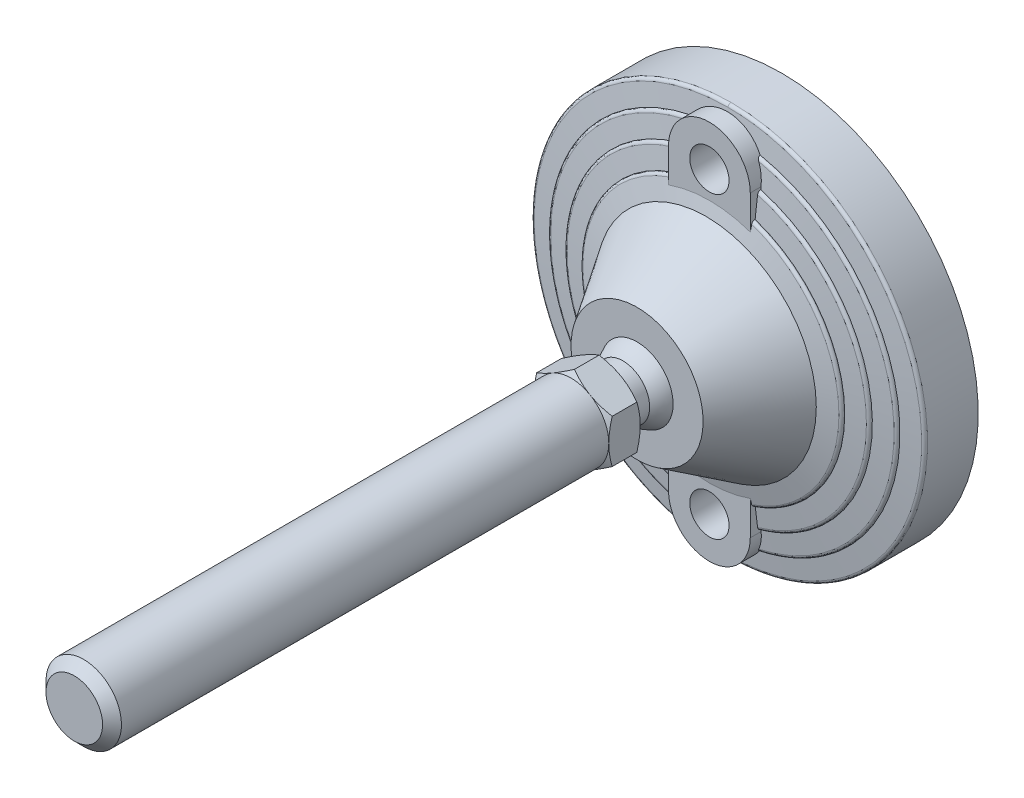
ISO-10303-21;
HEADER;
FILE_DESCRIPTION(('STEP AP214'),'2;1');
FILE_NAME('part.step','',(''),(''),'','','');
FILE_SCHEMA(('AUTOMOTIVE_DESIGN { 1 0 10303 214 1 1 1 1 }'));
ENDSEC;
DATA;
#1=APPLICATION_CONTEXT('core data for automotive mechanical design processes');
#2=APPLICATION_PROTOCOL_DEFINITION('international standard','automotive_design',2000,#1);
#3=PRODUCT_CONTEXT('',#1,'mechanical');
#4=PRODUCT('Part','Part','',(#3));
#5=PRODUCT_RELATED_PRODUCT_CATEGORY('part','',(#4));
#6=PRODUCT_DEFINITION_FORMATION('','',#4);
#7=PRODUCT_DEFINITION_CONTEXT('part definition',#1,'design');
#8=PRODUCT_DEFINITION('design','',#6,#7);
#9=PRODUCT_DEFINITION_SHAPE('','',#8);
#10=(LENGTH_UNIT() NAMED_UNIT(*) SI_UNIT(.MILLI.,.METRE.));
#11=(NAMED_UNIT(*) PLANE_ANGLE_UNIT() SI_UNIT($,.RADIAN.));
#12=(NAMED_UNIT(*) SI_UNIT($,.STERADIAN.) SOLID_ANGLE_UNIT());
#13=UNCERTAINTY_MEASURE_WITH_UNIT(LENGTH_MEASURE(1.E-05),#10,'distance_accuracy_value','');
#14=(GEOMETRIC_REPRESENTATION_CONTEXT(3) GLOBAL_UNCERTAINTY_ASSIGNED_CONTEXT((#13)) GLOBAL_UNIT_ASSIGNED_CONTEXT((#10,
#11,#12)) REPRESENTATION_CONTEXT('',''));
#15=CARTESIAN_POINT('',(0.,0.,0.));
#16=DIRECTION('',(0.,0.,1.));
#17=DIRECTION('',(1.,0.,0.));
#18=AXIS2_PLACEMENT_3D('',#15,#16,#17);
#19=CARTESIAN_POINT('',(-12.,14.022683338,60.));
#20=DIRECTION('',(0.,0.,1.));
#21=DIRECTION('',(0.,-1.,0.));
#22=AXIS2_PLACEMENT_3D('',#19,#20,#21);
#23=PLANE('',#22);
#24=CARTESIAN_POINT('',(0.,0.,60.));
#25=DIRECTION('',(0.,0.,-1.));
#26=DIRECTION('',(1.,0.,0.));
#27=AXIS2_PLACEMENT_3D('',#24,#25,#26);
#28=CIRCLE('',#27,8.5);
#29=CARTESIAN_POINT('',(8.5,0.,60.));
#30=VERTEX_POINT('',#29);
#31=EDGE_CURVE('E559',#30,#30,#28,.T.);
#32=ORIENTED_EDGE('',*,*,#31,.F.);
#33=EDGE_LOOP('',(#32));
#34=FACE_BOUND('',#33,.T.);
#35=CARTESIAN_POINT('',(0.,0.,60.));
#36=DIRECTION('',(0.,0.,1.));
#37=DIRECTION('',(0.,-1.,0.));
#38=AXIS2_PLACEMENT_3D('',#35,#36,#37);
#39=CIRCLE('',#38,12.);
#40=CARTESIAN_POINT('',(6.00000000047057,-10.3923048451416,60.));
#41=VERTEX_POINT('',#40);
#42=CARTESIAN_POINT('',(-6.00000000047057,-10.3923048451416,60.));
#43=VERTEX_POINT('',#42);
#44=EDGE_CURVE('E26',#41,#43,#39,.F.);
#45=ORIENTED_EDGE('',*,*,#44,.T.);
#46=CARTESIAN_POINT('',(-12.,0.,60.));
#47=VERTEX_POINT('',#46);
#48=EDGE_CURVE('E9',#43,#47,#39,.F.);
#49=ORIENTED_EDGE('',*,*,#48,.T.);
#50=CARTESIAN_POINT('',(-6.00000000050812,10.3923048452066,60.));
#51=VERTEX_POINT('',#50);
#52=EDGE_CURVE('E25',#47,#51,#39,.F.);
#53=ORIENTED_EDGE('',*,*,#52,.T.);
#54=CARTESIAN_POINT('',(6.00000000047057,10.3923048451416,60.));
#55=VERTEX_POINT('',#54);
#56=EDGE_CURVE('E239',#51,#55,#39,.F.);
#57=ORIENTED_EDGE('',*,*,#56,.T.);
#58=CARTESIAN_POINT('',(0.,0.,60.));
#59=DIRECTION('',(0.,0.,-1.));
#60=DIRECTION('',(0.,1.,0.));
#61=AXIS2_PLACEMENT_3D('',#58,#59,#60);
#62=CIRCLE('',#61,12.);
#63=CARTESIAN_POINT('',(12.,0.,60.));
#64=VERTEX_POINT('',#63);
#65=EDGE_CURVE('E253',#55,#64,#62,.T.);
#66=ORIENTED_EDGE('',*,*,#65,.T.);
#67=EDGE_CURVE('E263',#64,#41,#39,.F.);
#68=ORIENTED_EDGE('',*,*,#67,.T.);
#69=EDGE_LOOP('',(#45,#49,#53,#57,#66,#68));
#70=FACE_BOUND('',#69,.T.);
#71=ADVANCED_FACE('F14',(#34,#70),#23,.F.);
#72=CARTESIAN_POINT('',(-55.851524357,55.66,0.));
#73=DIRECTION('',(0.,0.,1.));
#74=DIRECTION('',(0.,-1.,0.));
#75=AXIS2_PLACEMENT_3D('',#72,#73,#74);
#76=PLANE('',#75);
#77=CARTESIAN_POINT('',(0.,0.,0.));
#78=DIRECTION('',(0.,0.,-1.));
#79=DIRECTION('',(0.,1.,0.));
#80=AXIS2_PLACEMENT_3D('',#77,#78,#79);
#81=CIRCLE('',#80,55.);
#82=CARTESIAN_POINT('',(0.,55.,0.));
#83=VERTEX_POINT('',#82);
#84=EDGE_CURVE('E556',#83,#83,#81,.F.);
#85=ORIENTED_EDGE('',*,*,#84,.F.);
#86=EDGE_LOOP('',(#85));
#87=FACE_BOUND('',#86,.T.);
#88=ADVANCED_FACE('F1286',(#87),#76,.F.);
#89=CARTESIAN_POINT('',(0.,0.,60.));
#90=DIRECTION('',(0.,0.,-1.));
#91=DIRECTION('',(1.,0.,0.));
#92=AXIS2_PLACEMENT_3D('',#89,#90,#91);
#93=CYLINDRICAL_SURFACE('',#92,8.5);
#94=ORIENTED_EDGE('',*,*,#31,.T.);
#95=EDGE_LOOP('',(#94));
#96=FACE_BOUND('',#95,.T.);
#97=CARTESIAN_POINT('',(0.,0.,53.5000000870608));
#98=DIRECTION('',(0.,0.,-1.));
#99=DIRECTION('',(-1.,0.,0.));
#100=AXIS2_PLACEMENT_3D('',#97,#98,#99);
#101=CIRCLE('',#100,8.49999990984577);
#102=CARTESIAN_POINT('',(-8.49999990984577,0.,53.5000000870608));
#103=VERTEX_POINT('',#102);
#104=EDGE_CURVE('E555',#103,#103,#101,.T.);
#105=ORIENTED_EDGE('',*,*,#104,.F.);
#106=EDGE_LOOP('',(#105));
#107=FACE_BOUND('',#106,.T.);
#108=ADVANCED_FACE('F1296',(#96,#107),#93,.T.);
#109=CARTESIAN_POINT('',(0.,0.,3.));
#110=DIRECTION('',(0.,0.,-1.));
#111=DIRECTION('',(0.,1.,0.));
#112=AXIS2_PLACEMENT_3D('',#109,#110,#111);
#113=CYLINDRICAL_SURFACE('',#112,55.);
#114=ORIENTED_EDGE('',*,*,#84,.T.);
#115=EDGE_LOOP('',(#114));
#116=FACE_BOUND('',#115,.T.);
#117=CARTESIAN_POINT('',(0.,0.,3.));
#118=DIRECTION('',(0.,0.,-1.));
#119=DIRECTION('',(0.,1.,0.));
#120=AXIS2_PLACEMENT_3D('',#117,#118,#119);
#121=CIRCLE('',#120,55.);
#122=CARTESIAN_POINT('',(0.,55.,3.));
#123=VERTEX_POINT('',#122);
#124=EDGE_CURVE('E552',#123,#123,#121,.T.);
#125=ORIENTED_EDGE('',*,*,#124,.T.);
#126=EDGE_LOOP('',(#125));
#127=FACE_BOUND('',#126,.T.);
#128=ADVANCED_FACE('F371',(#116,#127),#113,.T.);
#129=CARTESIAN_POINT('',(0.,0.,44.678860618));
#130=DIRECTION('',(0.,0.,-1.));
#131=DIRECTION('',(1.,0.,0.));
#132=AXIS2_PLACEMENT_3D('',#129,#130,#131);
#133=SPHERICAL_SURFACE('',#132,12.25);
#134=CARTESIAN_POINT('',(0.,0.,49.));
#135=DIRECTION('',(0.,0.,-1.));
#136=DIRECTION('',(0.,1.,0.));
#137=AXIS2_PLACEMENT_3D('',#134,#135,#136);
#138=CIRCLE('',#137,11.4625588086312);
#139=CARTESIAN_POINT('',(0.,11.4625588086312,49.));
#140=VERTEX_POINT('',#139);
#141=EDGE_CURVE('E549',#140,#140,#138,.F.);
#142=ORIENTED_EDGE('',*,*,#141,.T.);
#143=EDGE_LOOP('',(#142));
#144=FACE_BOUND('',#143,.T.);
#145=ORIENTED_EDGE('',*,*,#104,.T.);
#146=EDGE_LOOP('',(#145));
#147=FACE_BOUND('',#146,.T.);
#148=ADVANCED_FACE('F366',(#144,#147),#133,.T.);
#149=CARTESIAN_POINT('',(-6.346764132,-41.175,3.));
#150=DIRECTION('',(0.,0.,1.));
#151=DIRECTION('',(0.,-1.,0.));
#152=AXIS2_PLACEMENT_3D('',#149,#150,#151);
#153=PLANE('',#152);
#154=CARTESIAN_POINT('',(0.,-47.5,3.));
#155=DIRECTION('',(0.,0.,1.));
#156=DIRECTION('',(0.,-1.,0.));
#157=AXIS2_PLACEMENT_3D('',#154,#155,#156);
#158=CIRCLE('',#157,6.25);
#159=CARTESIAN_POINT('',(0.,-53.75,3.));
#160=VERTEX_POINT('',#159);
#161=EDGE_CURVE('E545',#160,#160,#158,.T.);
#162=ORIENTED_EDGE('',*,*,#161,.T.);
#163=EDGE_LOOP('',(#162));
#164=FACE_BOUND('',#163,.T.);
#165=ADVANCED_FACE('F370',(#164),#153,.T.);
#166=CARTESIAN_POINT('',(-63.467641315,63.25,3.));
#167=DIRECTION('',(0.,0.,1.));
#168=DIRECTION('',(0.,-1.,0.));
#169=AXIS2_PLACEMENT_3D('',#166,#167,#168);
#170=PLANE('',#169);
#171=ORIENTED_EDGE('',*,*,#124,.F.);
#172=EDGE_LOOP('',(#171));
#173=FACE_BOUND('',#172,.T.);
#174=CARTESIAN_POINT('',(0.,0.,3.));
#175=DIRECTION('',(0.,0.,-1.));
#176=DIRECTION('',(0.,1.,0.));
#177=AXIS2_PLACEMENT_3D('',#174,#175,#176);
#178=CIRCLE('',#177,62.5);
#179=CARTESIAN_POINT('',(0.,62.5,3.));
#180=VERTEX_POINT('',#179);
#181=EDGE_CURVE('E541',#180,#180,#178,.F.);
#182=ORIENTED_EDGE('',*,*,#181,.F.);
#183=EDGE_LOOP('',(#182));
#184=FACE_BOUND('',#183,.T.);
#185=ADVANCED_FACE('F763',(#173,#184),#170,.F.);
#186=CARTESIAN_POINT('',(-21.325127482,-21.252,49.));
#187=DIRECTION('',(0.,0.,-1.));
#188=DIRECTION('',(0.,1.,0.));
#189=AXIS2_PLACEMENT_3D('',#186,#187,#188);
#190=PLANE('',#189);
#191=ORIENTED_EDGE('',*,*,#141,.F.);
#192=EDGE_LOOP('',(#191));
#193=FACE_BOUND('',#192,.T.);
#194=CARTESIAN_POINT('',(0.,0.,49.));
#195=DIRECTION('',(0.,0.,-1.));
#196=DIRECTION('',(1.,0.,0.));
#197=AXIS2_PLACEMENT_3D('',#194,#195,#196);
#198=CIRCLE('',#197,21.);
#199=CARTESIAN_POINT('',(21.,0.,49.));
#200=VERTEX_POINT('',#199);
#201=EDGE_CURVE('E413',#200,#200,#198,.T.);
#202=ORIENTED_EDGE('',*,*,#201,.F.);
#203=EDGE_LOOP('',(#202));
#204=FACE_BOUND('',#203,.T.);
#205=ADVANCED_FACE('F378',(#193,#204),#190,.F.);
#206=CARTESIAN_POINT('',(0.,-47.5,3.));
#207=DIRECTION('',(0.,0.,1.));
#208=DIRECTION('',(0.,-1.,0.));
#209=AXIS2_PLACEMENT_3D('',#206,#207,#208);
#210=CYLINDRICAL_SURFACE('',#209,6.25);
#211=ORIENTED_EDGE('',*,*,#161,.F.);
#212=EDGE_LOOP('',(#211));
#213=FACE_BOUND('',#212,.T.);
#214=CARTESIAN_POINT('',(0.,-47.5,26.));
#215=DIRECTION('',(0.,0.,1.));
#216=DIRECTION('',(0.,-1.,0.));
#217=AXIS2_PLACEMENT_3D('',#214,#215,#216);
#218=CIRCLE('',#217,6.25);
#219=CARTESIAN_POINT('',(0.,-53.75,26.));
#220=VERTEX_POINT('',#219);
#221=EDGE_CURVE('E749',#220,#220,#218,.T.);
#222=ORIENTED_EDGE('',*,*,#221,.T.);
#223=EDGE_LOOP('',(#222));
#224=FACE_BOUND('',#223,.T.);
#225=ADVANCED_FACE('F374',(#213,#224),#210,.F.);
#226=CARTESIAN_POINT('',(-6.346764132,53.825,3.));
#227=DIRECTION('',(0.,0.,1.));
#228=DIRECTION('',(0.,-1.,0.));
#229=AXIS2_PLACEMENT_3D('',#226,#227,#228);
#230=PLANE('',#229);
#231=CARTESIAN_POINT('',(0.,47.5,3.));
#232=DIRECTION('',(0.,0.,1.));
#233=DIRECTION('',(0.,-1.,0.));
#234=AXIS2_PLACEMENT_3D('',#231,#232,#233);
#235=CIRCLE('',#234,6.25);
#236=CARTESIAN_POINT('',(0.,41.25,3.));
#237=VERTEX_POINT('',#236);
#238=EDGE_CURVE('E607',#237,#237,#235,.T.);
#239=ORIENTED_EDGE('',*,*,#238,.T.);
#240=EDGE_LOOP('',(#239));
#241=FACE_BOUND('',#240,.T.);
#242=ADVANCED_FACE('F377',(#241),#230,.T.);
#243=CARTESIAN_POINT('',(12.406354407,39.602176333,24.568111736));
#244=CARTESIAN_POINT('',(59.707464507,24.78394183,24.568111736));
#245=CARTESIAN_POINT('',(59.707464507,-24.78394183,24.568111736));
#246=CARTESIAN_POINT('',(12.406354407,-39.602176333,24.568111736));
#247=CARTESIAN_POINT('',(12.406354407,39.602176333,25.044046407));
#248=CARTESIAN_POINT('',(59.707464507,24.78394183,25.044046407));
#249=CARTESIAN_POINT('',(59.707464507,-24.78394183,25.044046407));
#250=CARTESIAN_POINT('',(12.406354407,-39.602176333,25.044046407));
#251=CARTESIAN_POINT('',(12.31903347,39.323440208,25.419805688));
#252=CARTESIAN_POINT('',(59.287219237,24.609502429,25.419805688));
#253=CARTESIAN_POINT('',(59.287219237,-24.609502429,25.419805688));
#254=CARTESIAN_POINT('',(12.31903347,-39.323440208,25.419805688));
#255=CARTESIAN_POINT('',(12.18115046,38.883305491,25.53720891));
#256=CARTESIAN_POINT('',(58.623636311,24.334056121,25.53720891));
#257=CARTESIAN_POINT('',(58.623636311,-24.334056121,25.53720891));
#258=CARTESIAN_POINT('',(12.18115046,-38.883305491,25.53720891));
#259=(BOUNDED_SURFACE() B_SPLINE_SURFACE(3,3,((#243,#244,#245,#246),(#247,#248,#249,#250),(#251,
#252,#253,#254),(#255,#256,#257,#258)),.UNSPECIFIED.,.F.,.F.,
.F.) B_SPLINE_SURFACE_WITH_KNOTS((4,4),(4,4),(0.,1.),(0.,1.),
.UNSPECIFIED.) GEOMETRIC_REPRESENTATION_ITEM() RATIONAL_B_SPLINE_SURFACE(((1.,0.532632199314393,
0.532632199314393,1.),(0.859679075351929,0.457892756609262,0.457892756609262,0.859679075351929),
(0.859679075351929,0.457892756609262,0.457892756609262,0.859679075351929),(1.,0.532632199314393,
0.532632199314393,1.))) REPRESENTATION_ITEM('') SURFACE());
#260=CARTESIAN_POINT('',(0.,0.,25.5372089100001));
#261=DIRECTION('',(0.,0.,-1.));
#262=DIRECTION('',(0.,1.,0.));
#263=AXIS2_PLACEMENT_3D('',#260,#261,#262);
#264=CIRCLE('',#263,40.746679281);
#265=CARTESIAN_POINT('',(13.,-38.6172483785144,25.537208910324));
#266=VERTEX_POINT('',#265);
#267=CARTESIAN_POINT('',(13.,38.6172483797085,25.5372089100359));
#268=VERTEX_POINT('',#267);
#269=EDGE_CURVE('E742',#266,#268,#264,.F.);
#270=CARTESIAN_POINT('',(13.,-39.4112927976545,24.5681117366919));
#271=CARTESIAN_POINT('',(13.,-39.4112933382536,24.59521048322));
#272=CARTESIAN_POINT('',(13.,-39.4101321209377,24.6222958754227));
#273=CARTESIAN_POINT('',(13.,-39.405504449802,24.6762650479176));
#274=CARTESIAN_POINT('',(13.,-39.4020383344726,24.7031488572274));
#275=CARTESIAN_POINT('',(13.,-39.3882336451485,24.7831079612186));
#276=CARTESIAN_POINT('',(13.,-39.3744885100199,24.8356344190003));
#277=CARTESIAN_POINT('',(13.,-39.3384084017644,24.937608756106));
#278=CARTESIAN_POINT('',(13.,-39.3160736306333,24.9870567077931));
#279=CARTESIAN_POINT('',(13.,-39.2635909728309,25.0816017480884));
#280=CARTESIAN_POINT('',(13.,-39.233444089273,25.1266993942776));
#281=CARTESIAN_POINT('',(13.,-39.1656058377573,25.2123360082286));
#282=CARTESIAN_POINT('',(13.,-39.1277714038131,25.2527614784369));
#283=CARTESIAN_POINT('',(13.,-39.0461074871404,25.327071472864));
#284=CARTESIAN_POINT('',(13.,-39.0022718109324,25.3609491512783));
#285=CARTESIAN_POINT('',(13.,-38.9043172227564,25.4250520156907));
#286=CARTESIAN_POINT('',(13.,-38.8495953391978,25.454364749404));
#287=CARTESIAN_POINT('',(13.,-38.7644641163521,25.4909906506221));
#288=CARTESIAN_POINT('',(13.,-38.7355751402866,25.5019763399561));
#289=CARTESIAN_POINT('',(13.,-38.6769796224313,25.5214626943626));
#290=CARTESIAN_POINT('',(13.,-38.6472733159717,25.5299640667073));
#291=CARTESIAN_POINT('',(13.,-38.6172483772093,25.5372089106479));
#292=B_SPLINE_CURVE_WITH_KNOTS('',3,(#270,#271,#272,#273,#274,#275,#276,#277,#278,#279,#280,
#281,#282,#283,#284,#285,#286,#287,#288,#289,#290,#291),.UNSPECIFIED.,.F.,.F.,(4,2,2,2,2,2,2,2,
2,2,4),(0.,0.0812450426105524,0.162478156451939,0.324519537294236,0.486557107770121,
0.648573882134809,0.813939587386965,0.979477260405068,1.16468654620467,1.25731455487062,
1.34991616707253),.UNSPECIFIED.);
#293=CARTESIAN_POINT('',(13.,-39.4112927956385,24.568111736));
#294=VERTEX_POINT('',#293);
#295=EDGE_CURVE('E405',#294,#266,#292,.T.);
#296=CARTESIAN_POINT('',(0.,0.,24.568111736));
#297=DIRECTION('',(0.,0.,-1.));
#298=DIRECTION('',(0.,1.,0.));
#299=AXIS2_PLACEMENT_3D('',#296,#297,#298);
#300=CIRCLE('',#299,41.5);
#301=CARTESIAN_POINT('',(13.,39.4112927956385,24.5681117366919));
#302=VERTEX_POINT('',#301);
#303=EDGE_CURVE('E548',#302,#294,#300,.T.);
#304=CARTESIAN_POINT('',(13.,38.6172483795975,25.5372089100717));
#305=CARTESIAN_POINT('',(13.,38.6757273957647,25.5231434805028));
#306=CARTESIAN_POINT('',(13.,38.7330575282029,25.5042077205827));
#307=CARTESIAN_POINT('',(13.,38.843898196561,25.4570874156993));
#308=CARTESIAN_POINT('',(13.,38.8974017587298,25.4288864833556));
#309=CARTESIAN_POINT('',(13.,38.9989209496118,25.3637346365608));
#310=CARTESIAN_POINT('',(13.,39.0469285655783,25.3267711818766));
#311=CARTESIAN_POINT('',(13.,39.1357078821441,25.2450475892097));
#312=CARTESIAN_POINT('',(13.,39.1764870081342,25.2002955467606));
#313=CARTESIAN_POINT('',(13.,39.2479885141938,25.1059931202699));
#314=CARTESIAN_POINT('',(13.,39.2790300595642,25.0566848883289));
#315=CARTESIAN_POINT('',(13.,39.3318958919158,24.9533393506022));
#316=CARTESIAN_POINT('',(13.,39.3537228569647,24.8993034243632));
#317=CARTESIAN_POINT('',(13.,39.3839717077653,24.7991363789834));
#318=CARTESIAN_POINT('',(13.,39.3941848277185,24.7535382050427));
#319=CARTESIAN_POINT('',(13.,39.4078594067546,24.6613400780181));
#320=CARTESIAN_POINT('',(13.,39.411320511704,24.6147400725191));
#321=CARTESIAN_POINT('',(13.,39.4112927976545,24.5681117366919));
#322=B_SPLINE_CURVE_WITH_KNOTS('',3,(#304,#305,#306,#307,#308,#309,#310,#311,#312,#313,#314,
#315,#316,#317,#318,#319,#320,#321),.UNSPECIFIED.,.F.,.F.,(4,2,2,2,2,2,2,2,4),(0.,
0.180276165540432,0.360872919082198,0.541729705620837,0.722399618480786,0.896310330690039,
1.07017046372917,1.20986980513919,1.34957647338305),.UNSPECIFIED.);
#323=EDGE_CURVE('E396',#268,#302,#322,.T.);
#324=ORIENTED_EDGE('',*,*,#269,.F.);
#325=ORIENTED_EDGE('',*,*,#295,.F.);
#326=ORIENTED_EDGE('',*,*,#303,.F.);
#327=ORIENTED_EDGE('',*,*,#323,.F.);
#328=EDGE_LOOP('',(#324,#325,#326,#327));
#329=FACE_BOUND('',#328,.T.);
#330=ADVANCED_FACE('F380',(#329),#259,.T.);
#331=CARTESIAN_POINT('',(0.,0.,24.568111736));
#332=DIRECTION('',(0.,0.,-1.));
#333=DIRECTION('',(0.,1.,0.));
#334=AXIS2_PLACEMENT_3D('',#331,#332,#333);
#335=CYLINDRICAL_SURFACE('',#334,41.5);
#336=CARTESIAN_POINT('',(0.,0.,24.454545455));
#337=DIRECTION('',(0.,0.,-1.));
#338=DIRECTION('',(0.,1.,0.));
#339=AXIS2_PLACEMENT_3D('',#336,#337,#338);
#340=CIRCLE('',#339,41.5);
#341=CARTESIAN_POINT('',(13.,39.4112927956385,24.454545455));
#342=VERTEX_POINT('',#341);
#343=CARTESIAN_POINT('',(13.,-39.4112927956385,24.4545454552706));
#344=VERTEX_POINT('',#343);
#345=EDGE_CURVE('E740',#342,#344,#340,.T.);
#346=ORIENTED_EDGE('',*,*,#345,.F.);
#347=DIRECTION('',(0.,0.,-1.));
#348=VECTOR('',#347,1.);
#349=CARTESIAN_POINT('',(13.,39.4112927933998,24.2785712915));
#350=LINE('',#349,#348);
#351=EDGE_CURVE('E632',#302,#342,#350,.T.);
#352=ORIENTED_EDGE('',*,*,#351,.F.);
#353=ORIENTED_EDGE('',*,*,#303,.T.);
#354=DIRECTION('',(0.,0.,1.));
#355=VECTOR('',#354,1.);
#356=CARTESIAN_POINT('',(13.,-39.4112927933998,24.2785712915));
#357=LINE('',#356,#355);
#358=EDGE_CURVE('E414',#344,#294,#357,.T.);
#359=ORIENTED_EDGE('',*,*,#358,.F.);
#360=EDGE_LOOP('',(#346,#352,#353,#359));
#361=FACE_BOUND('',#360,.T.);
#362=ADVANCED_FACE('F386',(#361),#335,.T.);
#363=CARTESIAN_POINT('',(0.,0.,24.454545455));
#364=DIRECTION('',(0.,0.,-1.));
#365=DIRECTION('',(0.,1.,0.));
#366=AXIS2_PLACEMENT_3D('',#363,#364,#365);
#367=CONICAL_SURFACE('',#366,41.5,1.4442041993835);
#368=ORIENTED_EDGE('',*,*,#345,.T.);
#369=CARTESIAN_POINT('',(13.0000000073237,-45.8176832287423,23.6748403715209));
#370=CARTESIAN_POINT('',(13.0000000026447,-45.2838642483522,23.7402005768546));
#371=CARTESIAN_POINT('',(13.000000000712,-44.7500350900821,23.8054777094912));
#372=CARTESIAN_POINT('',(12.999999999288,-43.6823542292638,23.9358466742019));
#373=CARTESIAN_POINT('',(12.9999999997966,-43.1485025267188,24.0009385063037));
#374=CARTESIAN_POINT('',(13.0000000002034,-42.0807742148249,24.1309177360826));
#375=CARTESIAN_POINT('',(13.0000000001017,-41.5468976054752,24.195805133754));
#376=CARTESIAN_POINT('',(12.9999999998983,-40.4791166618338,24.3253520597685));
#377=CARTESIAN_POINT('',(12.9999999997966,-39.9452123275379,24.3900115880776));
#378=CARTESIAN_POINT('',(13.,-39.4112927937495,24.4545454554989));
#379=B_SPLINE_CURVE_WITH_KNOTS('',3,(#369,#370,#371,#372,#373,#374,#375,#376,#377,#378),
.UNSPECIFIED.,.F.,.F.,(4,2,2,2,4),(0.,1.61341623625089,3.22683223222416,4.84024827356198,
6.4536645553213),.UNSPECIFIED.);
#380=CARTESIAN_POINT('',(13.,-45.8176832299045,23.674840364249));
#381=VERTEX_POINT('',#380);
#382=EDGE_CURVE('E416',#381,#344,#379,.T.);
#383=ORIENTED_EDGE('',*,*,#382,.F.);
#384=CARTESIAN_POINT('',(-7.48558333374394E-10,0.,23.674840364));
#385=DIRECTION('',(0.,0.,-1.));
#386=DIRECTION('',(0.,1.,0.));
#387=AXIS2_PLACEMENT_3D('',#384,#385,#386);
#388=CIRCLE('',#387,47.6262542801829);
#389=CARTESIAN_POINT('',(13.,45.8176832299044,23.6748403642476));
#390=VERTEX_POINT('',#389);
#391=EDGE_CURVE('E363',#390,#381,#388,.T.);
#392=ORIENTED_EDGE('',*,*,#391,.F.);
#393=CARTESIAN_POINT('',(13.,39.4112927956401,24.4545454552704));
#394=CARTESIAN_POINT('',(13.,39.9452123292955,24.3900115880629));
#395=CARTESIAN_POINT('',(13.,40.4791166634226,24.3253520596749));
#396=CARTESIAN_POINT('',(13.,41.5468976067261,24.195805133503));
#397=CARTESIAN_POINT('',(13.,42.0807742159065,24.1309177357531));
#398=CARTESIAN_POINT('',(13.,43.1485025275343,24.0009385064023));
#399=CARTESIAN_POINT('',(13.,43.6823542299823,23.9358466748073));
#400=CARTESIAN_POINT('',(13.,44.7500350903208,23.805477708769));
#401=CARTESIAN_POINT('',(13.,45.283864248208,23.7402005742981));
#402=CARTESIAN_POINT('',(13.,45.8176832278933,23.6748403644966));
#403=B_SPLINE_CURVE_WITH_KNOTS('',3,(#393,#394,#395,#396,#397,#398,#399,#400,#401,#402),
.UNSPECIFIED.,.F.,.F.,(4,2,2,2,4),(0.,1.61341628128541,3.22683232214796,4.84024831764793,
6.45366455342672),.UNSPECIFIED.);
#404=EDGE_CURVE('E626',#342,#390,#403,.T.);
#405=ORIENTED_EDGE('',*,*,#404,.F.);
#406=EDGE_LOOP('',(#368,#383,#392,#405));
#407=FACE_BOUND('',#406,.T.);
#408=ADVANCED_FACE('F516',(#407),#367,.T.);
#409=CARTESIAN_POINT('',(12.269850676,46.922284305,22.669623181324));
#410=CARTESIAN_POINT('',(72.557631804,31.157449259,22.6696231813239));
#411=CARTESIAN_POINT('',(72.557631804,-31.157449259,22.6696231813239));
#412=CARTESIAN_POINT('',(12.269850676,-46.922284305,22.669623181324));
#413=CARTESIAN_POINT('',(12.269850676,46.922284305,22.6740296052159));
#414=CARTESIAN_POINT('',(72.557631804,31.157449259,22.674029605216));
#415=CARTESIAN_POINT('',(72.557631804,-31.157449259,22.674029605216));
#416=CARTESIAN_POINT('',(12.269850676,-46.922284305,22.6740296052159));
#417=CARTESIAN_POINT('',(12.269850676,46.922284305,22.678436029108));
#418=CARTESIAN_POINT('',(72.557631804,31.157449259,22.678436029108));
#419=CARTESIAN_POINT('',(72.557631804,-31.157449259,22.678436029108));
#420=CARTESIAN_POINT('',(12.269850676,-46.922284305,22.678436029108));
#421=CARTESIAN_POINT('',(12.269850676,46.922284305,22.682842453));
#422=CARTESIAN_POINT('',(72.557631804,31.157449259,22.682842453));
#423=CARTESIAN_POINT('',(72.557631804,-31.157449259,22.682842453));
#424=CARTESIAN_POINT('',(12.269850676,-46.922284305,22.682842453));
#425=CARTESIAN_POINT('',(12.269850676,46.922284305,23.211436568));
#426=CARTESIAN_POINT('',(72.557631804,31.157449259,23.211436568));
#427=CARTESIAN_POINT('',(72.557631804,-31.157449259,23.211436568));
#428=CARTESIAN_POINT('',(12.269850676,-46.922284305,23.211436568));
#429=CARTESIAN_POINT('',(12.181461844,46.584268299,23.608103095));
#430=CARTESIAN_POINT('',(72.034945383,30.93299905,23.608103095));
#431=CARTESIAN_POINT('',(72.034945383,-30.93299905,23.608103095));
#432=CARTESIAN_POINT('',(12.181461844,-46.584268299,23.608103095));
#433=CARTESIAN_POINT('',(12.048804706,46.076961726,23.674840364));
#434=CARTESIAN_POINT('',(71.250478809,30.596136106,23.674840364));
#435=CARTESIAN_POINT('',(71.250478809,-30.596136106,23.674840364));
#436=CARTESIAN_POINT('',(12.048804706,-46.076961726,23.674840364));
#437=(BOUNDED_SURFACE() B_SPLINE_SURFACE(3,3,((#409,#410,#411,#412),(#413,#414,#415,#416),(#417,
#418,#419,#420),(#421,#422,#423,#424),(#425,#426,#427,#428),(#429,#430,#431,#432),(#433,#434,
#435,#436)),.UNSPECIFIED.,.F.,.F.,.F.) B_SPLINE_SURFACE_WITH_KNOTS((4,3,4),(4,4),(-0.01,0.,1.),
(0.,1.),.UNSPECIFIED.) GEOMETRIC_REPRESENTATION_ITEM() RATIONAL_B_SPLINE_SURFACE(((1.,
0.501991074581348,0.501991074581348,1.),(1.,0.501991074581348,0.501991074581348,1.),(1.,
0.501991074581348,0.501991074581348,1.),(1.,0.501991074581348,0.501991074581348,1.),
(0.833611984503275,0.418465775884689,0.418465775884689,0.833611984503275),(0.833611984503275,
0.418465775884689,0.418465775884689,0.833611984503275),(1.,0.501991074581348,0.501991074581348,1.))) REPRESENTATION_ITEM('') SURFACE());
#438=CARTESIAN_POINT('',(13.,-46.7252608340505,22.6777848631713));
#439=CARTESIAN_POINT('',(13.,-46.7253979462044,22.7054287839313));
#440=CARTESIAN_POINT('',(13.,-46.7243484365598,22.7330653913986));
#441=CARTESIAN_POINT('',(13.,-46.7198870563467,22.7881439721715));
#442=CARTESIAN_POINT('',(13.,-46.7164754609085,22.815585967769));
#443=CARTESIAN_POINT('',(13.,-46.7027375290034,22.8972169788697));
#444=CARTESIAN_POINT('',(13.,-46.6889086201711,22.9508576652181));
#445=CARTESIAN_POINT('',(13.,-46.6523707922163,23.0550506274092));
#446=CARTESIAN_POINT('',(13.,-46.6296523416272,23.105599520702));
#447=CARTESIAN_POINT('',(13.,-46.5760978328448,23.2021956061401));
#448=CARTESIAN_POINT('',(13.,-46.5452617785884,23.2482428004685));
#449=CARTESIAN_POINT('',(13.,-46.4762858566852,23.3348542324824));
#450=CARTESIAN_POINT('',(13.,-46.4381108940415,23.375390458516));
#451=CARTESIAN_POINT('',(13.,-46.3556866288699,23.4497572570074));
#452=CARTESIAN_POINT('',(13.,-46.3114344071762,23.483584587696));
#453=CARTESIAN_POINT('',(13.,-46.2164675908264,23.5448274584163));
#454=CARTESIAN_POINT('',(13.,-46.165579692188,23.5719736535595));
#455=CARTESIAN_POINT('',(13.,-46.0601083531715,23.6176355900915));
#456=CARTESIAN_POINT('',(13.,-46.0055288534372,23.6361603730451));
#457=CARTESIAN_POINT('',(13.,-45.9281089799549,23.6556819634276));
#458=CARTESIAN_POINT('',(13.,-45.9061721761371,23.6604842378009));
#459=CARTESIAN_POINT('',(13.,-45.8620822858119,23.6686997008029));
#460=CARTESIAN_POINT('',(13.,-45.8399296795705,23.6721154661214));
#461=CARTESIAN_POINT('',(13.0000000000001,-45.817683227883,23.6748403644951));
#462=B_SPLINE_CURVE_WITH_KNOTS('',3,(#438,#439,#440,#441,#442,#443,#444,#445,#446,#447,#448,
#449,#450,#451,#452,#453,#454,#455,#456,#457,#458,#459,#460,#461),.UNSPECIFIED.,.F.,.F.,(4,2,2,
2,2,2,2,2,2,2,2,4),(0.,0.0828810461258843,0.165752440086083,0.331061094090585,0.49654748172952,
0.66203378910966,0.828332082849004,0.994710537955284,1.16697834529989,1.3390650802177,
1.40639957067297,1.47360834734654),.UNSPECIFIED.);
#463=CARTESIAN_POINT('',(13.0000000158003,-46.7252608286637,22.6777848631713));
#464=VERTEX_POINT('',#463);
#465=EDGE_CURVE('E540',#464,#381,#462,.T.);
#466=CARTESIAN_POINT('',(13.0000000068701,46.7252608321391,22.6727272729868));
#467=CARTESIAN_POINT('',(13.3212147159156,46.635891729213,22.6727272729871));
#468=CARTESIAN_POINT('',(13.6414983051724,46.5432129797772,22.6727272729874));
#469=CARTESIAN_POINT('',(14.2801231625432,46.3512597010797,22.672727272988));
#470=CARTESIAN_POINT('',(14.59846420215,46.2519844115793,22.6727272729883));
#471=CARTESIAN_POINT('',(15.5526106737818,45.9435979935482,22.6727272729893));
#472=CARTESIAN_POINT('',(16.1852411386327,45.7245656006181,22.6727272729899));
#473=CARTESIAN_POINT('',(17.4409289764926,45.2604918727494,22.6727272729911));
#474=CARTESIAN_POINT('',(18.063985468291,45.01544815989,22.6727272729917));
#475=CARTESIAN_POINT('',(19.3000708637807,44.4995075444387,22.672727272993));
#476=CARTESIAN_POINT('',(19.9130888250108,44.228584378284,22.6727272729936));
#477=CARTESIAN_POINT('',(21.1274202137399,43.6615551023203,22.6727272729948));
#478=CARTESIAN_POINT('',(21.7287319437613,43.3654453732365,22.6727272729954));
#479=CARTESIAN_POINT('',(23.5288179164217,42.4321391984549,22.6727272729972));
#480=CARTESIAN_POINT('',(24.7079785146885,41.7565378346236,22.6727272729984));
#481=CARTESIAN_POINT('',(27.005751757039,40.308619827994,22.6727272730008));
#482=CARTESIAN_POINT('',(28.124340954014,39.5362661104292,22.672727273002));
#483=CARTESIAN_POINT('',(30.2940548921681,37.8994558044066,22.6727272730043));
#484=CARTESIAN_POINT('',(31.3451007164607,37.0348945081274,22.6727272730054));
#485=CARTESIAN_POINT('',(33.3707378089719,35.2206260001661,22.6727272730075));
#486=CARTESIAN_POINT('',(34.3453363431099,34.2709268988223,22.6727272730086));
#487=CARTESIAN_POINT('',(36.2141318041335,32.2900336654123,22.6727272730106));
#488=CARTESIAN_POINT('',(37.1080775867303,31.258602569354,22.6727272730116));
#489=CARTESIAN_POINT('',(38.8059105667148,29.1240638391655,22.6727272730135));
#490=CARTESIAN_POINT('',(39.6097954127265,28.0209543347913,22.6727272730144));
#491=CARTESIAN_POINT('',(41.1215543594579,25.7512426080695,22.6727272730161));
#492=CARTESIAN_POINT('',(41.829455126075,24.5846581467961,22.6727272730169));
#493=CARTESIAN_POINT('',(43.1444737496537,22.1960153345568,22.6727272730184));
#494=CARTESIAN_POINT('',(43.7515922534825,20.9739573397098,22.6727272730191));
#495=CARTESIAN_POINT('',(44.8608053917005,18.4828923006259,22.6727272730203));
#496=CARTESIAN_POINT('',(45.3628870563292,17.2138794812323,22.6727272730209));
#497=CARTESIAN_POINT('',(46.2583633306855,14.6380667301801,22.6727272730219));
#498=CARTESIAN_POINT('',(46.6517577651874,13.3312667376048,22.6727272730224));
#499=CARTESIAN_POINT('',(47.3270705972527,10.689137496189,22.6727272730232));
#500=CARTESIAN_POINT('',(47.6089860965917,9.35380750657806,22.6727272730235));
#501=CARTESIAN_POINT('',(48.0593220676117,6.66414532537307,22.672727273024));
#502=CARTESIAN_POINT('',(48.2277425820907,5.30981314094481,22.6727272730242));
#503=CARTESIAN_POINT('',(48.449886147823,2.59183878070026,22.6727272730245));
#504=CARTESIAN_POINT('',(48.5036145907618,1.22819704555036,22.6727272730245));
#505=CARTESIAN_POINT('',(48.4960080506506,-1.49876561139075,22.6727272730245));
#506=CARTESIAN_POINT('',(48.4346730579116,-2.86208653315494,22.6727272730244));
#507=CARTESIAN_POINT('',(48.1973677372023,-5.57880747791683,22.6727272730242));
#508=CARTESIAN_POINT('',(48.0213896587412,-6.93220682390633,22.672727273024));
#509=CARTESIAN_POINT('',(47.5560413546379,-9.61936956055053,22.6727272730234));
#510=CARTESIAN_POINT('',(47.2666711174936,-10.9531329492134,22.6727272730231));
#511=CARTESIAN_POINT('',(46.5765756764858,-13.5916227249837,22.6727272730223));
#512=CARTESIAN_POINT('',(46.1758433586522,-14.8963472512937,22.6727272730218));
#513=CARTESIAN_POINT('',(45.2658742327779,-17.467402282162,22.6727272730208));
#514=CARTESIAN_POINT('',(44.7566374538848,-18.7337327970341,22.6727272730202));
#515=CARTESIAN_POINT('',(43.6334165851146,-21.218718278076,22.6727272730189));
#516=CARTESIAN_POINT('',(43.019453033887,-22.4373825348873,22.6727272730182));
#517=CARTESIAN_POINT('',(41.6909757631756,-24.8187625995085,22.6727272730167));
#518=CARTESIAN_POINT('',(40.9764619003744,-25.9814783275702,22.6727272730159));
#519=CARTESIAN_POINT('',(39.706302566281,-27.8655028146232,22.6727272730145));
#520=CARTESIAN_POINT('',(39.1770724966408,-28.6047764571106,22.6727272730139));
#521=CARTESIAN_POINT('',(38.0778809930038,-30.0524665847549,22.6727272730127));
#522=CARTESIAN_POINT('',(37.5079195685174,-30.7608830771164,22.6727272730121));
#523=CARTESIAN_POINT('',(36.3291070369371,-32.1445499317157,22.6727272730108));
#524=CARTESIAN_POINT('',(35.7202564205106,-32.8198007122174,22.6727272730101));
#525=CARTESIAN_POINT('',(34.4653645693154,-34.1352484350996,22.6727272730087));
#526=CARTESIAN_POINT('',(33.8193109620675,-34.7754335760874,22.672727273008));
#527=CARTESIAN_POINT('',(32.4922294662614,-36.0184899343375,22.6727272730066));
#528=CARTESIAN_POINT('',(31.8112009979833,-36.6213605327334,22.6727272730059));
#529=CARTESIAN_POINT('',(30.4163089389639,-37.7878929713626,22.6727272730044));
#530=CARTESIAN_POINT('',(29.7024437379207,-38.3515528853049,22.6727272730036));
#531=CARTESIAN_POINT('',(28.1769516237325,-39.4879139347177,22.672727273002));
#532=CARTESIAN_POINT('',(27.3623770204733,-40.0566641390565,22.6727272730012));
#533=CARTESIAN_POINT('',(25.6997855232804,-41.1431320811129,22.6727272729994));
#534=CARTESIAN_POINT('',(24.8517655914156,-41.6608451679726,22.6727272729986));
#535=CARTESIAN_POINT('',(23.1254909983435,-42.6432641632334,22.6727272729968));
#536=CARTESIAN_POINT('',(22.247234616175,-43.1079670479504,22.6727272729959));
#537=CARTESIAN_POINT('',(20.4623876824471,-43.9832963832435,22.6727272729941));
#538=CARTESIAN_POINT('',(19.5557530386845,-44.3938329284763,22.6727272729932));
#539=CARTESIAN_POINT('',(17.7189637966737,-45.1583612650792,22.6727272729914));
#540=CARTESIAN_POINT('',(16.7888095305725,-45.5123538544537,22.6727272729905));
#541=CARTESIAN_POINT('',(14.9085132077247,-46.1625049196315,22.6727272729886));
#542=CARTESIAN_POINT('',(13.9583713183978,-46.4586638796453,22.6727272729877));
#543=CARTESIAN_POINT('',(13.0000000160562,-46.7252608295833,22.6727272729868));
#544=B_SPLINE_CURVE_WITH_KNOTS('',3,(#466,#467,#468,#469,#470,#471,#472,#473,#474,#475,#476,
#477,#478,#479,#480,#481,#482,#483,#484,#485,#486,#487,#488,#489,#490,#491,#492,#493,#494,#495,
#496,#497,#498,#499,#500,#501,#502,#503,#504,#505,#506,#507,#508,#509,#510,#511,#512,#513,#514,
#515,#516,#517,#518,#519,#520,#521,#522,#523,#524,#525,#526,#527,#528,#529,#530,#531,#532,#533,
#534,#535,#536,#537,#538,#539,#540,#541,#542,#543),.UNSPECIFIED.,.F.,.F.,(4,2,2,2,2,2,2,2,2,2,2,
2,2,2,2,2,2,2,2,2,2,2,2,2,2,2,2,2,2,2,2,2,2,2,2,2,2,2,4),(0.,1.00020816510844,2.00053180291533,
4.00833027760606,6.01631246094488,8.02635452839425,10.0366859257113,14.10842820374,
18.1817355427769,22.259718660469,26.3373137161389,30.4271967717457,34.5171865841,
38.6060377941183,42.6948627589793,46.7841923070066,50.8735284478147,54.9629708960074,
59.0524118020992,63.1416604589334,67.2309094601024,71.3204349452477,75.4099608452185,
79.4997480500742,83.5895341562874,87.6785191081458,91.767509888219,94.4937471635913,
97.2199838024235,99.9461860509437,102.673300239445,105.400459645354,108.12775293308,
111.106299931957,114.085118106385,117.064106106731,120.047978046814,123.031807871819,
126.015612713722),.UNSPECIFIED.);
#545=CARTESIAN_POINT('',(13.0000000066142,46.7252608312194,22.6777848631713));
#546=VERTEX_POINT('',#545);
#547=EDGE_CURVE('E506',#546,#464,#544,.T.);
#548=CARTESIAN_POINT('',(13.,45.817683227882,23.6748403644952));
#549=CARTESIAN_POINT('',(13.,45.8768916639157,23.6676266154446));
#550=CARTESIAN_POINT('',(13.,45.9354849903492,23.655431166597));
#551=CARTESIAN_POINT('',(13.,46.0498761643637,23.621476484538));
#552=CARTESIAN_POINT('',(13.,46.1056719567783,23.5997103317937));
#553=CARTESIAN_POINT('',(13.,46.2128716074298,23.5469963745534));
#554=CARTESIAN_POINT('',(13.,46.2642705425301,23.5160384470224));
#555=CARTESIAN_POINT('',(13.,46.336724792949,23.4633763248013));
#556=CARTESIAN_POINT('',(13.,46.3600988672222,23.4447881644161));
#557=CARTESIAN_POINT('',(13.,46.405165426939,23.405625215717));
#558=CARTESIAN_POINT('',(13.,46.4268560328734,23.3850482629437));
#559=CARTESIAN_POINT('',(13.,46.4880645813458,23.3216088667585));
#560=CARTESIAN_POINT('',(13.,46.5249454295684,23.2761439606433));
#561=CARTESIAN_POINT('',(13.,46.5901806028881,23.1794685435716));
#562=CARTESIAN_POINT('',(13.,46.6185381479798,23.1282602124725));
#563=CARTESIAN_POINT('',(13.,46.653488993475,23.049293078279));
#564=CARTESIAN_POINT('',(13.,46.6637514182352,23.0231112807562));
#565=CARTESIAN_POINT('',(13.,46.6819716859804,22.9699855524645));
#566=CARTESIAN_POINT('',(13.,46.6899313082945,22.9430422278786));
#567=CARTESIAN_POINT('',(13.,46.7102220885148,22.8614024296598));
#568=CARTESIAN_POINT('',(13.,46.7190275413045,22.8057552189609));
#569=CARTESIAN_POINT('',(13.,46.7237631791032,22.737878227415));
#570=CARTESIAN_POINT('',(13.,46.7243742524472,22.7258595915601));
#571=CARTESIAN_POINT('',(13.,46.7251497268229,22.7018236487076));
#572=CARTESIAN_POINT('',(13.,46.7253147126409,22.6898063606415));
#573=CARTESIAN_POINT('',(13.,46.7252608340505,22.6777848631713));
#574=B_SPLINE_CURVE_WITH_KNOTS('',3,(#548,#549,#550,#551,#552,#553,#554,#555,#556,#557,#558,
#559,#560,#561,#562,#563,#564,#565,#566,#567,#568,#569,#570,#571,#572,#573),.UNSPECIFIED.,.F.,
.F.,(4,2,2,2,2,2,2,2,2,2,2,2,4),(0.,0.17871866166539,0.357566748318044,0.536612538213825,
0.626107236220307,0.715700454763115,0.890396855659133,1.06502717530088,1.14929679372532,
1.23350112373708,1.40145319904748,1.43755286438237,1.47360518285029),.UNSPECIFIED.);
#575=EDGE_CURVE('E455',#390,#546,#574,.T.);
#576=ORIENTED_EDGE('',*,*,#391,.T.);
#577=ORIENTED_EDGE('',*,*,#465,.F.);
#578=ORIENTED_EDGE('',*,*,#547,.F.);
#579=ORIENTED_EDGE('',*,*,#575,.F.);
#580=EDGE_LOOP('',(#576,#577,#578,#579));
#581=FACE_BOUND('',#580,.T.);
#582=ADVANCED_FACE('F509',(#581),#437,.T.);
#583=CARTESIAN_POINT('',(0.,62.5,19.119206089));
#584=CARTESIAN_POINT('',(125.,62.5,19.119206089));
#585=CARTESIAN_POINT('',(125.,-62.5,19.119206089));
#586=CARTESIAN_POINT('',(0.,-62.5,19.119206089));
#587=CARTESIAN_POINT('',(0.,62.5,19.647800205));
#588=CARTESIAN_POINT('',(125.,62.5000000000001,19.647800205));
#589=CARTESIAN_POINT('',(125.,-62.5000000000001,19.647800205));
#590=CARTESIAN_POINT('',(0.,-62.5,19.647800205));
#591=CARTESIAN_POINT('',(0.,62.150618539,20.044466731));
#592=CARTESIAN_POINT('',(124.301237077,62.150618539,20.044466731));
#593=CARTESIAN_POINT('',(124.301237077,-62.150618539,20.044466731));
#594=CARTESIAN_POINT('',(0.,-62.150618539,20.044466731));
#595=CARTESIAN_POINT('',(0.,61.62625428,20.111204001));
#596=CARTESIAN_POINT('',(123.252508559,61.6262542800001,20.111204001));
#597=CARTESIAN_POINT('',(123.252508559,-61.6262542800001,20.111204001));
#598=CARTESIAN_POINT('',(0.,-61.62625428,20.111204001));
#599=(BOUNDED_SURFACE() B_SPLINE_SURFACE(3,3,((#583,#584,#585,#586),(#587,#588,#589,#590),(#591,
#592,#593,#594),(#595,#596,#597,#598)),.UNSPECIFIED.,.F.,.F.,
.F.) B_SPLINE_SURFACE_WITH_KNOTS((4,4),(4,4),(0.,1.),(0.,1.),
.UNSPECIFIED.) GEOMETRIC_REPRESENTATION_ITEM() RATIONAL_B_SPLINE_SURFACE(((1.,0.333333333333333,
0.333333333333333,1.),(0.833611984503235,0.277870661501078,0.277870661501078,0.833611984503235),
(0.833611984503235,0.277870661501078,0.277870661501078,0.833611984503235),(1.,0.333333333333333,
0.333333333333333,1.))) REPRESENTATION_ITEM('') SURFACE());
#600=CARTESIAN_POINT('',(0.,0.,19.119206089));
#601=DIRECTION('',(0.,0.,1.));
#602=DIRECTION('',(0.,-1.,0.));
#603=AXIS2_PLACEMENT_3D('',#600,#601,#602);
#604=CIRCLE('',#603,62.5);
#605=CARTESIAN_POINT('',(-9.61422321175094E-09,-62.5,19.119206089));
#606=VERTEX_POINT('',#605);
#607=CARTESIAN_POINT('',(-2.80605088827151E-09,62.5,19.119206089));
#608=VERTEX_POINT('',#607);
#609=EDGE_CURVE('E544',#606,#608,#604,.T.);
#610=CARTESIAN_POINT('',(0.,62.5,19.119206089));
#611=CARTESIAN_POINT('',(0.,62.5,19.647800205));
#612=CARTESIAN_POINT('',(0.,62.150618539,20.044466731));
#613=CARTESIAN_POINT('',(0.,61.62625428,20.111204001));
#614=(BOUNDED_CURVE() B_SPLINE_CURVE(3,(#610,#611,#612,#613),.UNSPECIFIED.,.F.,
.F.) B_SPLINE_CURVE_WITH_KNOTS((4,4),(0.,1.),
.UNSPECIFIED.) CURVE() GEOMETRIC_REPRESENTATION_ITEM() RATIONAL_B_SPLINE_CURVE((1.,
0.833611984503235,0.833611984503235,1.)) REPRESENTATION_ITEM(''));
#615=CARTESIAN_POINT('',(-8.30046746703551E-09,61.6262542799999,20.1112040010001));
#616=VERTEX_POINT('',#615);
#617=EDGE_CURVE('E700',#616,#608,#614,.F.);
#618=CARTESIAN_POINT('',(0.,0.,20.1112040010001));
#619=DIRECTION('',(0.,0.,-1.));
#620=DIRECTION('',(0.,1.,0.));
#621=AXIS2_PLACEMENT_3D('',#618,#619,#620);
#622=CIRCLE('',#621,61.62625428);
#623=CARTESIAN_POINT('',(-1.57996950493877E-08,-61.6262542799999,20.1112040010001));
#624=VERTEX_POINT('',#623);
#625=EDGE_CURVE('E644',#624,#616,#622,.F.);
#626=CARTESIAN_POINT('',(0.,-62.5,19.119206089));
#627=CARTESIAN_POINT('',(0.,-62.5,19.647800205));
#628=CARTESIAN_POINT('',(0.,-62.150618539,20.044466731));
#629=CARTESIAN_POINT('',(0.,-61.62625428,20.111204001));
#630=(BOUNDED_CURVE() B_SPLINE_CURVE(3,(#626,#627,#628,#629),.UNSPECIFIED.,.F.,
.F.) B_SPLINE_CURVE_WITH_KNOTS((4,4),(0.,1.),
.UNSPECIFIED.) CURVE() GEOMETRIC_REPRESENTATION_ITEM() RATIONAL_B_SPLINE_CURVE((1.,
0.833611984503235,0.833611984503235,1.)) REPRESENTATION_ITEM(''));
#631=EDGE_CURVE('E704',#606,#624,#630,.T.);
#632=ORIENTED_EDGE('',*,*,#609,.T.);
#633=ORIENTED_EDGE('',*,*,#617,.F.);
#634=ORIENTED_EDGE('',*,*,#625,.F.);
#635=ORIENTED_EDGE('',*,*,#631,.F.);
#636=EDGE_LOOP('',(#632,#633,#634,#635));
#637=FACE_BOUND('',#636,.T.);
#638=ADVANCED_FACE('F515',(#637),#599,.T.);
#639=CARTESIAN_POINT('',(0.,0.,19.119206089));
#640=DIRECTION('',(0.,0.,-1.));
#641=DIRECTION('',(0.,1.,0.));
#642=AXIS2_PLACEMENT_3D('',#639,#640,#641);
#643=CYLINDRICAL_SURFACE('',#642,62.5);
#644=ORIENTED_EDGE('',*,*,#609,.F.);
#645=CARTESIAN_POINT('',(0.,0.,19.119206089));
#646=DIRECTION('',(0.,0.,1.));
#647=DIRECTION('',(0.,-1.,0.));
#648=AXIS2_PLACEMENT_3D('',#645,#646,#647);
#649=CIRCLE('',#648,62.5);
#650=EDGE_CURVE('E703',#608,#606,#649,.T.);
#651=ORIENTED_EDGE('',*,*,#650,.F.);
#652=EDGE_LOOP('',(#644,#651));
#653=FACE_BOUND('',#652,.T.);
#654=ORIENTED_EDGE('',*,*,#181,.T.);
#655=EDGE_LOOP('',(#654));
#656=FACE_BOUND('',#655,.T.);
#657=ADVANCED_FACE('F428',(#653,#656),#643,.T.);
#658=CARTESIAN_POINT('',(13.,-47.5,22.557142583));
#659=DIRECTION('',(1.,0.,0.));
#660=DIRECTION('',(0.,1.,0.));
#661=AXIS2_PLACEMENT_3D('',#658,#659,#660);
#662=PLANE('',#661);
#663=ORIENTED_EDGE('',*,*,#358,.T.);
#664=ORIENTED_EDGE('',*,*,#295,.T.);
#665=CARTESIAN_POINT('',(12.999999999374,-36.6937824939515,25.9999999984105));
#666=CARTESIAN_POINT('',(12.999999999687,-37.0144078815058,25.9230665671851));
#667=CARTESIAN_POINT('',(12.9999999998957,-37.3350093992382,25.8460339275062));
#668=CARTESIAN_POINT('',(13.0000000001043,-37.9761646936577,25.6917702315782));
#669=CARTESIAN_POINT('',(13.0000000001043,-38.2967184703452,25.6145391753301));
#670=CARTESIAN_POINT('',(13.,-38.6172483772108,25.5372089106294));
#671=B_SPLINE_CURVE_WITH_KNOTS('',3,(#665,#666,#667,#668,#669,#670),.UNSPECIFIED.,.F.,.F.,(4,2,
4),(0.,0.989178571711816,1.97835713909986),.UNSPECIFIED.);
#672=CARTESIAN_POINT('',(13.,-36.6937824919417,25.9999999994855));
#673=VERTEX_POINT('',#672);
#674=EDGE_CURVE('E435',#673,#266,#671,.T.);
#675=ORIENTED_EDGE('',*,*,#674,.F.);
#676=DIRECTION('',(0.,-1.,0.));
#677=VECTOR('',#676,1.);
#678=CARTESIAN_POINT('',(13.,-48.6192575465,26.));
#679=LINE('',#678,#677);
#680=CARTESIAN_POINT('',(13.,-47.5000000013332,26.));
#681=VERTEX_POINT('',#680);
#682=EDGE_CURVE('E640',#673,#681,#679,.T.);
#683=ORIENTED_EDGE('',*,*,#682,.T.);
#684=DIRECTION('',(0.,0.,1.));
#685=VECTOR('',#684,1.);
#686=CARTESIAN_POINT('',(13.,-47.5000000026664,23.1100363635));
#687=LINE('',#686,#685);
#688=CARTESIAN_POINT('',(13.,-47.4999998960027,22.5776765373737));
#689=VERTEX_POINT('',#688);
#690=EDGE_CURVE('E729',#689,#681,#687,.T.);
#691=ORIENTED_EDGE('',*,*,#690,.F.);
#692=CARTESIAN_POINT('',(13.,-46.7246498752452,22.6728021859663));
#693=CARTESIAN_POINT('',(13.,-46.8538759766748,22.6569570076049));
#694=CARTESIAN_POINT('',(13.,-46.9831015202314,22.6411072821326));
#695=CARTESIAN_POINT('',(13.,-47.241551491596,22.6093987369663));
#696=CARTESIAN_POINT('',(13.,-47.370775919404,22.5935399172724));
#697=CARTESIAN_POINT('',(13.,-47.499999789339,22.5776765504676));
#698=B_SPLINE_CURVE_WITH_KNOTS('',3,(#692,#693,#694,#695,#696,#697),.UNSPECIFIED.,.F.,.F.,(4,2,
4),(0.,0.390581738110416,0.781163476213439),.UNSPECIFIED.);
#699=EDGE_CURVE('E453',#464,#689,#698,.T.);
#700=ORIENTED_EDGE('',*,*,#699,.F.);
#701=ORIENTED_EDGE('',*,*,#465,.T.);
#702=ORIENTED_EDGE('',*,*,#382,.T.);
#703=EDGE_LOOP('',(#663,#664,#675,#683,#691,#700,#701,#702));
#704=FACE_BOUND('',#703,.T.);
#705=ADVANCED_FACE('F422',(#704),#662,.T.);
#706=CARTESIAN_POINT('',(0.,0.,49.));
#707=DIRECTION('',(0.,0.,-1.));
#708=DIRECTION('',(1.,0.,0.));
#709=AXIS2_PLACEMENT_3D('',#706,#707,#708);
#710=CONICAL_SURFACE('',#709,21.,0.566729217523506);
#711=ORIENTED_EDGE('',*,*,#201,.T.);
#712=EDGE_LOOP('',(#711));
#713=FACE_BOUND('',#712,.T.);
#714=CARTESIAN_POINT('',(0.,0.,27.));
#715=DIRECTION('',(0.,0.,-1.));
#716=DIRECTION('',(0.,1.,0.));
#717=AXIS2_PLACEMENT_3D('',#714,#715,#716);
#718=CIRCLE('',#717,35.);
#719=CARTESIAN_POINT('',(0.,35.,27.));
#720=VERTEX_POINT('',#719);
#721=EDGE_CURVE('E647',#720,#720,#718,.T.);
#722=ORIENTED_EDGE('',*,*,#721,.F.);
#723=EDGE_LOOP('',(#722));
#724=FACE_BOUND('',#723,.T.);
#725=ADVANCED_FACE('F427',(#713,#724),#710,.T.);
#726=CARTESIAN_POINT('',(-13.,-60.687838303,26.));
#727=DIRECTION('',(0.,0.,-1.));
#728=DIRECTION('',(0.,1.,0.));
#729=AXIS2_PLACEMENT_3D('',#726,#727,#728);
#730=PLANE('',#729);
#731=ORIENTED_EDGE('',*,*,#221,.F.);
#732=EDGE_LOOP('',(#731));
#733=FACE_BOUND('',#732,.T.);
#734=ORIENTED_EDGE('',*,*,#682,.F.);
#735=CARTESIAN_POINT('',(0.,0.,25.999999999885));
#736=DIRECTION('',(0.,0.,-1.));
#737=DIRECTION('',(1.,0.,0.));
#738=AXIS2_PLACEMENT_3D('',#735,#736,#737);
#739=CIRCLE('',#738,38.9285714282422);
#740=CARTESIAN_POINT('',(-13.,-36.6937824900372,25.9999999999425));
#741=VERTEX_POINT('',#740);
#742=EDGE_CURVE('E973',#741,#673,#739,.F.);
#743=ORIENTED_EDGE('',*,*,#742,.F.);
#744=DIRECTION('',(0.,1.,0.));
#745=VECTOR('',#744,1.);
#746=CARTESIAN_POINT('',(-13.,-42.064472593,26.));
#747=LINE('',#746,#745);
#748=CARTESIAN_POINT('',(-13.,-47.5,26.));
#749=VERTEX_POINT('',#748);
#750=EDGE_CURVE('E645',#749,#741,#747,.T.);
#751=ORIENTED_EDGE('',*,*,#750,.F.);
#752=CARTESIAN_POINT('',(0.,-47.5,26.));
#753=DIRECTION('',(0.,0.,-1.));
#754=DIRECTION('',(1.,0.,0.));
#755=AXIS2_PLACEMENT_3D('',#752,#753,#754);
#756=CIRCLE('',#755,13.);
#757=EDGE_CURVE('E732',#681,#749,#756,.T.);
#758=ORIENTED_EDGE('',*,*,#757,.F.);
#759=EDGE_LOOP('',(#734,#743,#751,#758));
#760=FACE_BOUND('',#759,.T.);
#761=ADVANCED_FACE('F431',(#733,#760),#730,.F.);
#762=CARTESIAN_POINT('',(0.,47.5,3.));
#763=DIRECTION('',(0.,0.,1.));
#764=DIRECTION('',(0.,-1.,0.));
#765=AXIS2_PLACEMENT_3D('',#762,#763,#764);
#766=CYLINDRICAL_SURFACE('',#765,6.25);
#767=ORIENTED_EDGE('',*,*,#238,.F.);
#768=EDGE_LOOP('',(#767));
#769=FACE_BOUND('',#768,.T.);
#770=CARTESIAN_POINT('',(0.,47.5,26.));
#771=DIRECTION('',(0.,0.,1.));
#772=DIRECTION('',(0.,-1.,0.));
#773=AXIS2_PLACEMENT_3D('',#770,#771,#772);
#774=CIRCLE('',#773,6.25);
#775=CARTESIAN_POINT('',(0.,41.25,26.));
#776=VERTEX_POINT('',#775);
#777=EDGE_CURVE('E724',#776,#776,#774,.T.);
#778=ORIENTED_EDGE('',*,*,#777,.T.);
#779=EDGE_LOOP('',(#778));
#780=FACE_BOUND('',#779,.T.);
#781=ADVANCED_FACE('F465',(#769,#780),#766,.F.);
#782=CARTESIAN_POINT('',(13.,36.628945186,22.557142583));
#783=DIRECTION('',(1.,0.,0.));
#784=DIRECTION('',(0.,1.,0.));
#785=AXIS2_PLACEMENT_3D('',#782,#783,#784);
#786=PLANE('',#785);
#787=DIRECTION('',(0.,0.,-1.));
#788=VECTOR('',#787,1.);
#789=CARTESIAN_POINT('',(13.,47.4999999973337,23.1100363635));
#790=LINE('',#789,#788);
#791=CARTESIAN_POINT('',(13.,47.4999999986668,26.));
#792=VERTEX_POINT('',#791);
#793=CARTESIAN_POINT('',(13.,47.499999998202,22.5776765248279));
#794=VERTEX_POINT('',#793);
#795=EDGE_CURVE('E718',#792,#794,#790,.T.);
#796=ORIENTED_EDGE('',*,*,#795,.F.);
#797=DIRECTION('',(0.,-1.,0.));
#798=VECTOR('',#797,1.);
#799=CARTESIAN_POINT('',(13.,48.5968912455,26.));
#800=LINE('',#799,#798);
#801=CARTESIAN_POINT('',(13.,36.6937824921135,25.9999999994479));
#802=VERTEX_POINT('',#801);
#803=EDGE_CURVE('E654',#792,#802,#800,.T.);
#804=ORIENTED_EDGE('',*,*,#803,.T.);
#805=CARTESIAN_POINT('',(13.,36.6937824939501,25.9999999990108));
#806=CARTESIAN_POINT('',(13.,37.6335857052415,25.7745100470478));
#807=CARTESIAN_POINT('',(13.,38.6172483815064,25.5372089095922));
#808=B_SPLINE_CURVE_WITH_KNOTS('',2,(#805,#806,#807),.UNSPECIFIED.,.F.,.F.,(3,3),(0.,1.),.UNSPECIFIED.);
#809=EDGE_CURVE('E603',#802,#268,#808,.T.);
#810=ORIENTED_EDGE('',*,*,#809,.T.);
#811=ORIENTED_EDGE('',*,*,#323,.T.);
#812=ORIENTED_EDGE('',*,*,#351,.T.);
#813=ORIENTED_EDGE('',*,*,#404,.T.);
#814=ORIENTED_EDGE('',*,*,#575,.T.);
#815=CARTESIAN_POINT('',(13.,47.499999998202,22.5776765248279));
#816=CARTESIAN_POINT('',(13.,47.3707760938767,22.5935398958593));
#817=CARTESIAN_POINT('',(13.,47.2415516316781,22.6093987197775));
#818=CARTESIAN_POINT('',(13.,46.9831015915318,22.6411072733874));
#819=CARTESIAN_POINT('',(13.,46.8538760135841,22.6569570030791));
#820=CARTESIAN_POINT('',(13.,46.724649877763,22.6728021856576));
#821=B_SPLINE_CURVE_WITH_KNOTS('',3,(#815,#816,#817,#818,#819,#820),.UNSPECIFIED.,.F.,.F.,(4,2,
4),(0.,0.390581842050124,0.781163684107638),.UNSPECIFIED.);
#822=EDGE_CURVE('E508',#794,#546,#821,.T.);
#823=ORIENTED_EDGE('',*,*,#822,.F.);
#824=EDGE_LOOP('',(#796,#804,#810,#811,#812,#813,#814,#823));
#825=FACE_BOUND('',#824,.T.);
#826=ADVANCED_FACE('F463',(#825),#786,.T.);
#827=CARTESIAN_POINT('',(0.,0.,22.672727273));
#828=DIRECTION('',(0.,0.,-1.));
#829=DIRECTION('',(0.,1.,0.));
#830=AXIS2_PLACEMENT_3D('',#827,#828,#829);
#831=CONICAL_SURFACE('',#830,48.5,1.44420419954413);
#832=ORIENTED_EDGE('',*,*,#822,.T.);
#833=ORIENTED_EDGE('',*,*,#547,.T.);
#834=ORIENTED_EDGE('',*,*,#699,.T.);
#835=CARTESIAN_POINT('',(11.5932568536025,-53.3818700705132,21.8930221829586));
#836=CARTESIAN_POINT('',(11.7613010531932,-53.0507456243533,21.9296661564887));
#837=CARTESIAN_POINT('',(11.9150335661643,-52.7124850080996,21.9673922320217));
#838=CARTESIAN_POINT('',(12.1930253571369,-52.0241209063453,22.0448334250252));
#839=CARTESIAN_POINT('',(12.3172727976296,-51.6740127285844,22.0845493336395));
#840=CARTESIAN_POINT('',(12.53321332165,-50.9714687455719,22.16498494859));
#841=CARTESIAN_POINT('',(12.6254861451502,-50.6192069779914,22.2056706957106));
#842=CARTESIAN_POINT('',(12.780106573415,-49.9085284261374,22.2885418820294));
#843=CARTESIAN_POINT('',(12.8424702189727,-49.5501150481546,22.3307265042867));
#844=CARTESIAN_POINT('',(12.9262918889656,-48.910751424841,22.4067383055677));
#845=CARTESIAN_POINT('',(12.9538012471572,-48.6305476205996,22.4403063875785));
#846=CARTESIAN_POINT('',(12.9907296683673,-48.066897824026,22.5083749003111));
#847=CARTESIAN_POINT('',(13.0000099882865,-47.78344335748,22.5428804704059));
#848=CARTESIAN_POINT('',(13.,-47.4999997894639,22.5776765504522));
#849=B_SPLINE_CURVE_WITH_KNOTS('',3,(#835,#836,#837,#838,#839,#840,#841,#842,#843,#844,#845,
#846,#847,#848),.UNSPECIFIED.,.F.,.F.,(4,2,2,2,2,2,4),(0.,1.11904065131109,2.23852981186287,
3.33650467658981,4.43389001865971,5.28395886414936,6.14047298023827),.UNSPECIFIED.);
#850=CARTESIAN_POINT('',(11.5932568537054,-53.3818700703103,21.8930221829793));
#851=VERTEX_POINT('',#850);
#852=EDGE_CURVE('E490',#851,#689,#849,.T.);
#853=ORIENTED_EDGE('',*,*,#852,.F.);
#854=CARTESIAN_POINT('',(-6.43539041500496E-11,0.,21.893022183));
#855=DIRECTION('',(0.,0.,-1.));
#856=DIRECTION('',(0.,1.,0.));
#857=AXIS2_PLACEMENT_3D('',#854,#855,#856);
#858=CIRCLE('',#857,54.6262542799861);
#859=CARTESIAN_POINT('',(11.5932568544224,53.3818700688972,21.8930221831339));
#860=VERTEX_POINT('',#859);
#861=EDGE_CURVE('E641',#860,#851,#858,.T.);
#862=ORIENTED_EDGE('',*,*,#861,.F.);
#863=CARTESIAN_POINT('',(13.,47.499999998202,22.5776765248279));
#864=CARTESIAN_POINT('',(13.0000412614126,47.8703415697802,22.5322107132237));
#865=CARTESIAN_POINT('',(12.9841765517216,48.2407469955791,22.487238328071));
#866=CARTESIAN_POINT('',(12.9208802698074,48.9791698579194,22.3985010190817));
#867=CARTESIAN_POINT('',(12.873434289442,49.3471861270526,22.3547366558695));
#868=CARTESIAN_POINT('',(12.7484369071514,50.070931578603,22.2695070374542));
#869=CARTESIAN_POINT('',(12.6714831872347,50.4267608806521,22.2280137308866));
#870=CARTESIAN_POINT('',(12.4879990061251,51.1307124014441,22.1466643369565));
#871=CARTESIAN_POINT('',(12.3814849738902,51.4788387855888,22.106807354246));
#872=CARTESIAN_POINT('',(12.166853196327,52.0877128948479,22.0376853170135));
#873=CARTESIAN_POINT('',(12.0645073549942,52.3504706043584,22.0080576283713));
#874=CARTESIAN_POINT('',(11.8420691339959,52.870860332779,21.9497450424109));
#875=CARTESIAN_POINT('',(11.7218478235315,53.1284382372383,21.9210690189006));
#876=CARTESIAN_POINT('',(11.5932568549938,53.3818700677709,21.8930221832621));
#877=B_SPLINE_CURVE_WITH_KNOTS('',3,(#863,#864,#865,#866,#867,#868,#869,#870,#871,#872,#873,
#874,#875,#876),.UNSPECIFIED.,.F.,.F.,(4,2,2,2,2,2,4),(0.,1.11903694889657,2.23858477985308,
3.33656129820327,4.43392880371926,5.283972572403,6.14047502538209),.UNSPECIFIED.);
#878=EDGE_CURVE('E482',#794,#860,#877,.T.);
#879=ORIENTED_EDGE('',*,*,#878,.F.);
#880=EDGE_LOOP('',(#832,#833,#834,#853,#862,#879));
#881=FACE_BOUND('',#880,.T.);
#882=ADVANCED_FACE('F457',(#881),#831,.T.);
#883=CARTESIAN_POINT('',(10.12472555,54.568671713,20.887804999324));
#884=CARTESIAN_POINT('',(88.74549149,39.9812967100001,20.8878049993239));
#885=CARTESIAN_POINT('',(88.74549149,-39.9812967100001,20.8878049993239));
#886=CARTESIAN_POINT('',(10.12472555,-54.568671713,20.887804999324));
#887=CARTESIAN_POINT('',(10.12472555,54.568671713,20.892211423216));
#888=CARTESIAN_POINT('',(88.74549149,39.9812967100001,20.892211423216));
#889=CARTESIAN_POINT('',(88.74549149,-39.9812967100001,20.892211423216));
#890=CARTESIAN_POINT('',(10.12472555,-54.568671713,20.892211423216));
#891=CARTESIAN_POINT('',(10.12472555,54.568671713,20.896617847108));
#892=CARTESIAN_POINT('',(88.74549149,39.9812967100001,20.896617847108));
#893=CARTESIAN_POINT('',(88.74549149,-39.9812967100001,20.896617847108));
#894=CARTESIAN_POINT('',(10.12472555,-54.568671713,20.896617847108));
#895=CARTESIAN_POINT('',(10.12472555,54.568671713,20.901024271));
#896=CARTESIAN_POINT('',(88.74549149,39.9812967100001,20.901024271));
#897=CARTESIAN_POINT('',(88.74549149,-39.9812967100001,20.901024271));
#898=CARTESIAN_POINT('',(10.12472555,-54.568671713,20.901024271));
#899=CARTESIAN_POINT('',(10.12472555,54.568671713,21.429618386));
#900=CARTESIAN_POINT('',(88.7454914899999,39.98129671,21.429618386));
#901=CARTESIAN_POINT('',(88.7454914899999,-39.98129671,21.429618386));
#902=CARTESIAN_POINT('',(10.12472555,-54.568671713,21.429618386));
#903=CARTESIAN_POINT('',(10.060988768,54.2251531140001,21.826284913));
#904=CARTESIAN_POINT('',(88.186824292,39.729607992,21.826284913));
#905=CARTESIAN_POINT('',(88.186824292,-39.729607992,21.826284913));
#906=CARTESIAN_POINT('',(10.060988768,-54.2251531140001,21.826284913));
#907=CARTESIAN_POINT('',(9.965330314,53.709588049,21.893022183));
#908=CARTESIAN_POINT('',(87.348356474,39.351864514,21.893022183));
#909=CARTESIAN_POINT('',(87.348356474,-39.351864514,21.893022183));
#910=CARTESIAN_POINT('',(9.965330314,-53.709588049,21.893022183));
#911=(BOUNDED_SURFACE() B_SPLINE_SURFACE(3,3,((#883,#884,#885,#886),(#887,#888,#889,#890),(#891,
#892,#893,#894),(#895,#896,#897,#898),(#899,#900,#901,#902),(#903,#904,#905,#906),(#907,#908,
#909,#910)),.UNSPECIFIED.,.F.,.F.,.F.) B_SPLINE_SURFACE_WITH_KNOTS((4,3,4),(4,4),(-0.01,0.,1.),
(0.,1.),.UNSPECIFIED.) GEOMETRIC_REPRESENTATION_ITEM() RATIONAL_B_SPLINE_SURFACE(((1.,
0.454951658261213,0.454951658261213,1.),(1.,0.454951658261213,0.454951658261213,1.),(1.,
0.454951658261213,0.454951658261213,1.),(1.,0.454951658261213,0.454951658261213,1.),
(0.833611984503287,0.379253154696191,0.379253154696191,0.833611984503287),(0.833611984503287,
0.379253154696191,0.379253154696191,0.833611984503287),(1.,0.454951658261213,0.454951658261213,1.))) REPRESENTATION_ITEM('') SURFACE());
#912=CARTESIAN_POINT('',(0.,0.,20.890909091));
#913=DIRECTION('',(0.,0.,-1.));
#914=DIRECTION('',(1.,0.,0.));
#915=AXIS2_PLACEMENT_3D('',#912,#913,#914);
#916=CIRCLE('',#915,55.5);
#917=CARTESIAN_POINT('',(11.0210073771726,54.3947368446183,20.8959666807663));
#918=VERTEX_POINT('',#917);
#919=CARTESIAN_POINT('',(11.02100737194,-54.3947368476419,20.8959666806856));
#920=VERTEX_POINT('',#919);
#921=EDGE_CURVE('E690',#918,#920,#916,.T.);
#922=CARTESIAN_POINT('',(11.5932568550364,53.381870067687,21.8930221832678));
#923=CARTESIAN_POINT('',(11.5742588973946,53.4193168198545,21.8888715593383));
#924=CARTESIAN_POINT('',(11.5551583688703,53.4565124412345,21.8831357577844));
#925=CARTESIAN_POINT('',(11.5168510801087,53.5302460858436,21.8684898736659));
#926=CARTESIAN_POINT('',(11.4976442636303,53.5667837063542,21.8595779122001));
#927=CARTESIAN_POINT('',(11.4398026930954,53.675569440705,21.827948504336));
#928=CARTESIAN_POINT('',(11.4011915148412,53.7465090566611,21.8003901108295));
#929=CARTESIAN_POINT('',(11.3310664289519,53.8727053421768,21.7372637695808));
#930=CARTESIAN_POINT('',(11.2993422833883,53.9287360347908,21.7034638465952));
#931=CARTESIAN_POINT('',(11.2382417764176,54.0349557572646,21.6261176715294));
#932=CARTESIAN_POINT('',(11.2088591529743,54.0851605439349,21.5825986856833));
#933=CARTESIAN_POINT('',(11.1609968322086,54.1658664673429,21.497795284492));
#934=CARTESIAN_POINT('',(11.1416342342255,54.1981465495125,21.4587049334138));
#935=CARTESIAN_POINT('',(11.106123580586,54.2568626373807,21.3750125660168));
#936=CARTESIAN_POINT('',(11.0899722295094,54.2833046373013,21.3304162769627));
#937=CARTESIAN_POINT('',(11.0645457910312,54.3246839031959,21.2447155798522));
#938=CARTESIAN_POINT('',(11.0545578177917,54.3408324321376,21.204409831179));
#939=CARTESIAN_POINT('',(11.0382174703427,54.3671681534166,21.1212219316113));
#940=CARTESIAN_POINT('',(11.0318575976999,54.3773676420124,21.0783452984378));
#941=CARTESIAN_POINT('',(11.0253158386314,54.3878463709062,21.0119053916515));
#942=CARTESIAN_POINT('',(11.0236343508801,54.3905364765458,20.9888429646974));
#943=CARTESIAN_POINT('',(11.0214382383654,54.3940481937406,20.9425113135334));
#944=CARTESIAN_POINT('',(11.0209241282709,54.3948689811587,20.9192420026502));
#945=CARTESIAN_POINT('',(11.0210073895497,54.394736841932,20.8959666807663));
#946=B_SPLINE_CURVE_WITH_KNOTS('',3,(#922,#923,#924,#925,#926,#927,#928,#929,#930,#931,#932,
#933,#934,#935,#936,#937,#938,#939,#940,#941,#942,#943,#944,#945),.UNSPECIFIED.,.F.,.F.,(4,2,2,
2,2,2,2,2,2,2,2,4),(0.,0.126511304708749,0.253097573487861,0.507880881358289,0.72528839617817,
0.94209348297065,1.10433476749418,1.26640868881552,1.39953909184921,1.53239333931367,
1.60213777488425,1.67191295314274),.UNSPECIFIED.);
#947=EDGE_CURVE('E876',#860,#918,#946,.T.);
#948=CARTESIAN_POINT('',(11.0210073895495,-54.394736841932,20.8959666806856));
#949=CARTESIAN_POINT('',(11.0209229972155,-54.3948706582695,20.9190661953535));
#950=CARTESIAN_POINT('',(11.0214299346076,-54.3940613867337,20.9421693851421));
#951=CARTESIAN_POINT('',(11.0235945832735,-54.3906001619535,20.9881652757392));
#952=CARTESIAN_POINT('',(11.0252513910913,-54.3879496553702,21.0110581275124));
#953=CARTESIAN_POINT('',(11.0296648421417,-54.3808799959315,21.0562576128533));
#954=CARTESIAN_POINT('',(11.0324119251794,-54.3764762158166,21.0785675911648));
#955=CARTESIAN_POINT('',(11.0389383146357,-54.3659943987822,21.1226321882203));
#956=CARTESIAN_POINT('',(11.0427177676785,-54.3599161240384,21.1443867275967));
#957=CARTESIAN_POINT('',(11.0554767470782,-54.3393489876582,21.2085228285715));
#958=CARTESIAN_POINT('',(11.0658887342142,-54.3225090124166,21.2498921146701));
#959=CARTESIAN_POINT('',(11.0898158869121,-54.2835467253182,21.3291278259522));
#960=CARTESIAN_POINT('',(11.1033381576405,-54.2614123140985,21.3669859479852));
#961=CARTESIAN_POINT('',(11.1384598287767,-54.2034507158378,21.4526827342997));
#962=CARTESIAN_POINT('',(11.1611616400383,-54.1656369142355,21.4987283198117));
#963=CARTESIAN_POINT('',(11.2095892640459,-54.0838726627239,21.5831368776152));
#964=CARTESIAN_POINT('',(11.2353209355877,-54.0399102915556,21.6214845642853));
#965=CARTESIAN_POINT('',(11.2968188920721,-53.9332517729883,21.7012510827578));
#966=CARTESIAN_POINT('',(11.3332423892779,-53.8689452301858,21.7400048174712));
#967=CARTESIAN_POINT('',(11.4074242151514,-53.7351050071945,21.8050561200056));
#968=CARTESIAN_POINT('',(11.4451825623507,-53.6655712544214,21.831353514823));
#969=CARTESIAN_POINT('',(11.5014324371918,-53.5595886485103,21.8613792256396));
#970=CARTESIAN_POINT('',(11.5199102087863,-53.5243893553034,21.8697736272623));
#971=CARTESIAN_POINT('',(11.5567095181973,-53.4534911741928,21.8836000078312));
#972=CARTESIAN_POINT('',(11.5750313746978,-53.417794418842,21.8890420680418));
#973=CARTESIAN_POINT('',(11.5932568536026,-53.3818700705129,21.893022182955));
#974=B_SPLINE_CURVE_WITH_KNOTS('',3,(#948,#949,#950,#951,#952,#953,#954,#955,#956,#957,#958,
#959,#960,#961,#962,#963,#964,#965,#966,#967,#968,#969,#970,#971,#972,#973),.UNSPECIFIED.,.F.,
.F.,(4,2,2,2,2,2,2,2,2,2,2,2,4),(0.,0.0692678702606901,0.138481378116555,0.207100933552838,
0.275730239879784,0.412641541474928,0.549868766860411,0.740100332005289,0.93070598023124,
1.17976894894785,1.42883537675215,1.55063397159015,1.67201400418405),.UNSPECIFIED.);
#975=EDGE_CURVE('E687',#920,#851,#974,.T.);
#976=ORIENTED_EDGE('',*,*,#921,.F.);
#977=ORIENTED_EDGE('',*,*,#947,.F.);
#978=ORIENTED_EDGE('',*,*,#861,.T.);
#979=ORIENTED_EDGE('',*,*,#975,.F.);
#980=EDGE_LOOP('',(#976,#977,#978,#979));
#981=FACE_BOUND('',#980,.T.);
#982=ADVANCED_FACE('F462',(#981),#911,.T.);
#983=CARTESIAN_POINT('',(0.,-62.5,19.119206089));
#984=CARTESIAN_POINT('',(-125.,-62.5,19.119206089));
#985=CARTESIAN_POINT('',(-125.,62.5,19.119206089));
#986=CARTESIAN_POINT('',(0.,62.5,19.119206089));
#987=CARTESIAN_POINT('',(0.,-62.5,19.647800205));
#988=CARTESIAN_POINT('',(-125.,-62.5000000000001,19.647800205));
#989=CARTESIAN_POINT('',(-125.,62.5000000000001,19.647800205));
#990=CARTESIAN_POINT('',(0.,62.5,19.647800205));
#991=CARTESIAN_POINT('',(0.,-62.150618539,20.044466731));
#992=CARTESIAN_POINT('',(-124.301237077,-62.150618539,20.044466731));
#993=CARTESIAN_POINT('',(-124.301237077,62.150618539,20.044466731));
#994=CARTESIAN_POINT('',(0.,62.150618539,20.044466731));
#995=CARTESIAN_POINT('',(0.,-61.62625428,20.111204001));
#996=CARTESIAN_POINT('',(-123.252508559,-61.6262542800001,20.111204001));
#997=CARTESIAN_POINT('',(-123.252508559,61.6262542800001,20.111204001));
#998=CARTESIAN_POINT('',(0.,61.62625428,20.111204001));
#999=(BOUNDED_SURFACE() B_SPLINE_SURFACE(3,3,((#983,#984,#985,#986),(#987,#988,#989,#990),(#991,
#992,#993,#994),(#995,#996,#997,#998)),.UNSPECIFIED.,.F.,.F.,
.F.) B_SPLINE_SURFACE_WITH_KNOTS((4,4),(4,4),(0.,1.),(0.,1.),
.UNSPECIFIED.) GEOMETRIC_REPRESENTATION_ITEM() RATIONAL_B_SPLINE_SURFACE(((1.,0.333333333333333,
0.333333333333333,1.),(0.833611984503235,0.277870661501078,0.277870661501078,0.833611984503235),
(0.833611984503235,0.277870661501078,0.277870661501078,0.833611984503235),(1.,0.333333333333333,
0.333333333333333,1.))) REPRESENTATION_ITEM('') SURFACE());
#1000=CARTESIAN_POINT('',(0.,0.,20.1112040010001));
#1001=DIRECTION('',(0.,0.,-1.));
#1002=DIRECTION('',(0.,1.,0.));
#1003=AXIS2_PLACEMENT_3D('',#1000,#1001,#1002);
#1004=CIRCLE('',#1003,61.62625428);
#1005=EDGE_CURVE('E693',#616,#624,#1004,.F.);
#1006=ORIENTED_EDGE('',*,*,#617,.T.);
#1007=ORIENTED_EDGE('',*,*,#650,.T.);
#1008=ORIENTED_EDGE('',*,*,#631,.T.);
#1009=ORIENTED_EDGE('',*,*,#1005,.F.);
#1010=EDGE_LOOP('',(#1006,#1007,#1008,#1009));
#1011=FACE_BOUND('',#1010,.T.);
#1012=ADVANCED_FACE('F852',(#1011),#999,.T.);
#1013=CARTESIAN_POINT('',(0.,-47.5,26.));
#1014=DIRECTION('',(0.,0.,-1.));
#1015=DIRECTION('',(1.,0.,0.));
#1016=AXIS2_PLACEMENT_3D('',#1013,#1014,#1015);
#1017=CYLINDRICAL_SURFACE('',#1016,13.);
#1018=CARTESIAN_POINT('',(11.0212529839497,-54.3943442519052,20.8909518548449));
#1019=CARTESIAN_POINT('',(10.8279142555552,-54.7034885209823,20.8572775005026));
#1020=CARTESIAN_POINT('',(10.6214505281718,-55.0045428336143,20.8247251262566));
#1021=CARTESIAN_POINT('',(10.1838418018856,-55.5883982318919,20.761993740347));
#1022=CARTESIAN_POINT('',(9.95269731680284,-55.8711996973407,20.7318146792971));
#1023=CARTESIAN_POINT('',(9.46740937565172,-56.4163523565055,20.6739724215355));
#1024=CARTESIAN_POINT('',(9.21327751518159,-56.6787137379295,20.6463079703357));
#1025=CARTESIAN_POINT('',(8.68370436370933,-57.1812448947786,20.5935909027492));
#1026=CARTESIAN_POINT('',(8.40826348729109,-57.4214151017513,20.5685382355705));
#1027=CARTESIAN_POINT('',(7.83782458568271,-57.8779598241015,20.5211307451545));
#1028=CARTESIAN_POINT('',(7.54281473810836,-58.0943197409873,20.4987775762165));
#1029=CARTESIAN_POINT('',(6.93547493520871,-58.5014930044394,20.4568757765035));
#1030=CARTESIAN_POINT('',(6.6231450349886,-58.6923064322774,20.4373271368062));
#1031=CARTESIAN_POINT('',(5.98347109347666,-59.0469378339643,20.4011162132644));
#1032=CARTESIAN_POINT('',(5.65613123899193,-59.2107632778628,20.384453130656));
#1033=CARTESIAN_POINT('',(4.9886923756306,-59.5102765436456,20.3540716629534));
#1034=CARTESIAN_POINT('',(4.64859345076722,-59.645964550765,20.3403532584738));
#1035=CARTESIAN_POINT('',(3.95859762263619,-59.8880172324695,20.3159327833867));
#1036=CARTESIAN_POINT('',(3.60871655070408,-59.9944265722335,20.3052261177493));
#1037=CARTESIAN_POINT('',(2.90115937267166,-60.1774131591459,20.2868421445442));
#1038=CARTESIAN_POINT('',(2.54348325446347,-60.2539903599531,20.2791648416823));
#1039=CARTESIAN_POINT('',(1.8228199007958,-60.376760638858,20.2668675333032));
#1040=CARTESIAN_POINT('',(1.45983150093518,-60.4229469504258,20.2622482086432));
#1041=CARTESIAN_POINT('',(0.731228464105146,-60.4845665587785,20.2560871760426));
#1042=CARTESIAN_POINT('',(0.365613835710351,-60.4999999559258,20.2545454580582));
#1043=CARTESIAN_POINT('',(-0.364119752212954,-60.5000000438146,20.2545454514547));
#1044=CARTESIAN_POINT('',(-0.728238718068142,-60.484692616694,20.2560745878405));
#1045=CARTESIAN_POINT('',(-1.45388119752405,-60.4235754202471,20.2621853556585));
#1046=CARTESIAN_POINT('',(-1.81540471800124,-60.377765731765,20.2667669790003));
#1047=CARTESIAN_POINT('',(-2.53319266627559,-60.2559952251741,20.278963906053));
#1048=CARTESIAN_POINT('',(-2.88945838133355,-60.1800419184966,20.2865784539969));
#1049=CARTESIAN_POINT('',(-3.5942903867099,-59.9985402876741,20.3048124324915));
#1050=CARTESIAN_POINT('',(-3.9428566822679,-59.8929919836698,20.3154318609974));
#1051=CARTESIAN_POINT('',(-4.62977653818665,-59.6530863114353,20.3396338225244));
#1052=CARTESIAN_POINT('',(-4.9681313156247,-59.5187323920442,20.3532160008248));
#1053=CARTESIAN_POINT('',(-5.63227981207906,-59.2221876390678,20.3832923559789));
#1054=CARTESIAN_POINT('',(-5.95807349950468,-59.059996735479,20.3997865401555));
#1055=CARTESIAN_POINT('',(-6.59489843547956,-58.7089052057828,20.4356288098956));
#1056=CARTESIAN_POINT('',(-6.90592525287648,-58.5199966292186,20.45497774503));
#1057=CARTESIAN_POINT('',(-7.51093018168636,-58.116876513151,20.4964507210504));
#1058=CARTESIAN_POINT('',(-7.80490813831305,-57.9026647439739,20.5185747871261));
#1059=CARTESIAN_POINT('',(-8.37802701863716,-57.4470929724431,20.5658633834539));
#1060=CARTESIAN_POINT('',(-8.6568793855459,-57.2053740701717,20.5910685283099));
#1061=CARTESIAN_POINT('',(-9.19291505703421,-56.6992507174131,20.6441454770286));
#1062=CARTESIAN_POINT('',(-9.45009760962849,-56.4348454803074,20.6720173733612));
#1063=CARTESIAN_POINT('',(-9.94109957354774,-55.8851277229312,20.7303301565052));
#1064=CARTESIAN_POINT('',(-10.1749040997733,-55.5998020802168,20.7607726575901));
#1065=CARTESIAN_POINT('',(-10.6173529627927,-55.0105165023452,20.8240792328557));
#1066=CARTESIAN_POINT('',(-10.8259970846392,-54.7065564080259,20.8569433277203));
#1067=CARTESIAN_POINT('',(-11.0212529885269,-54.3943442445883,20.8909518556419));
#1068=B_SPLINE_CURVE_WITH_KNOTS('',3,(#1018,#1019,#1020,#1021,#1022,#1023,#1024,#1025,#1026,
#1027,#1028,#1029,#1030,#1031,#1032,#1033,#1034,#1035,#1036,#1037,#1038,#1039,#1040,#1041,#1042,
#1043,#1044,#1045,#1046,#1047,#1048,#1049,#1050,#1051,#1052,#1053,#1054,#1055,#1056,#1057,#1058,
#1059,#1060,#1061,#1062,#1063,#1064,#1065,#1066,#1067),.UNSPECIFIED.,.F.,.F.,(4,2,2,2,2,2,2,2,2,
2,2,2,2,2,2,2,2,2,2,2,2,2,2,2,4),(0.,1.09819800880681,2.19637315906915,3.29399740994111,
4.39160031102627,5.48987246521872,6.5881411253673,7.68610528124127,8.78406220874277,
9.88033477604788,10.9766090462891,12.0731273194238,13.1696420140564,14.261675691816,
15.3537064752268,16.445465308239,17.5372233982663,18.6288508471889,19.7204810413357,
20.8124367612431,21.9044023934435,23.0127408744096,24.1211178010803,25.2301960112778,
26.3392836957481),.UNSPECIFIED.);
#1069=CARTESIAN_POINT('',(-11.0210073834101,-54.3947368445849,20.8959666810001));
#1070=VERTEX_POINT('',#1069);
#1071=EDGE_CURVE('E697',#920,#1070,#1068,.T.);
#1072=ORIENTED_EDGE('',*,*,#1071,.F.);
#1073=ORIENTED_EDGE('',*,*,#975,.T.);
#1074=ORIENTED_EDGE('',*,*,#852,.T.);
#1075=ORIENTED_EDGE('',*,*,#690,.T.);
#1076=ORIENTED_EDGE('',*,*,#757,.T.);
#1077=DIRECTION('',(0.,0.,1.));
#1078=VECTOR('',#1077,1.);
#1079=CARTESIAN_POINT('',(-13.,-47.5,24.2785712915));
#1080=LINE('',#1079,#1078);
#1081=CARTESIAN_POINT('',(-13.,-47.500000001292,22.5776765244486));
#1082=VERTEX_POINT('',#1081);
#1083=EDGE_CURVE('E648',#1082,#749,#1080,.T.);
#1084=ORIENTED_EDGE('',*,*,#1083,.F.);
#1085=CARTESIAN_POINT('',(-11.5932568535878,-53.3818700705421,21.8930221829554));
#1086=CARTESIAN_POINT('',(-11.7613010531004,-53.0507456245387,21.9296661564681));
#1087=CARTESIAN_POINT('',(-11.915033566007,-52.7124850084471,21.9673922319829));
#1088=CARTESIAN_POINT('',(-12.1930253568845,-52.0241209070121,22.0448334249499));
#1089=CARTESIAN_POINT('',(-12.3172727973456,-51.6740127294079,22.0845493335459));
#1090=CARTESIAN_POINT('',(-12.5332133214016,-50.9714687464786,22.1649849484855));
#1091=CARTESIAN_POINT('',(-12.625486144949,-50.6192069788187,22.2056706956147));
#1092=CARTESIAN_POINT('',(-12.7801065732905,-49.908528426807,22.2885418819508));
#1093=CARTESIAN_POINT('',(-12.8424702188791,-49.5501150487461,22.3307265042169));
#1094=CARTESIAN_POINT('',(-12.9262918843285,-48.9107514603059,22.4067383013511));
#1095=CARTESIAN_POINT('',(-12.9538012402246,-48.6305476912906,22.4403063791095));
#1096=CARTESIAN_POINT('',(-12.9907296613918,-48.0668979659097,22.5083748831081));
#1097=CARTESIAN_POINT('',(-13.0000099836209,-47.7834435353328,22.5428804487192));
#1098=CARTESIAN_POINT('',(-13.,-47.5000000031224,22.5776765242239));
#1099=B_SPLINE_CURVE_WITH_KNOTS('',3,(#1085,#1086,#1087,#1088,#1089,#1090,#1091,#1092,#1093,
#1094,#1095,#1096,#1097,#1098),.UNSPECIFIED.,.F.,.F.,(4,2,2,2,2,2,4),(0.,1.11904065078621,
2.23852981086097,3.33650467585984,4.43389001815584,5.28395875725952,6.14047276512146),.UNSPECIFIED.);
#1100=CARTESIAN_POINT('',(-11.5932568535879,-53.381870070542,21.8930221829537));
#1101=VERTEX_POINT('',#1100);
#1102=EDGE_CURVE('E670',#1101,#1082,#1099,.T.);
#1103=ORIENTED_EDGE('',*,*,#1102,.F.);
#1104=CARTESIAN_POINT('',(-11.0210073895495,-54.394736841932,20.8959666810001));
#1105=CARTESIAN_POINT('',(-11.0209229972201,-54.3948706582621,20.9190661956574));
#1106=CARTESIAN_POINT('',(-11.0214299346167,-54.3940613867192,20.9421693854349));
#1107=CARTESIAN_POINT('',(-11.0235945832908,-54.3906001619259,20.988165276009));
#1108=CARTESIAN_POINT('',(-11.0252513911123,-54.3879496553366,21.0110581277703));
#1109=CARTESIAN_POINT('',(-11.0296648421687,-54.3808799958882,21.0562576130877));
#1110=CARTESIAN_POINT('',(-11.0324119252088,-54.3764762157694,21.0785675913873));
#1111=CARTESIAN_POINT('',(-11.0389383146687,-54.3659943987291,21.1226321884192));
#1112=CARTESIAN_POINT('',(-11.0427177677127,-54.3599161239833,21.1443867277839));
#1113=CARTESIAN_POINT('',(-11.0554767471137,-54.3393489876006,21.2085228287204));
#1114=CARTESIAN_POINT('',(-11.0658887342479,-54.3225090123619,21.2498921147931));
#1115=CARTESIAN_POINT('',(-11.0898158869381,-54.2835467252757,21.3291278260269));
#1116=CARTESIAN_POINT('',(-11.1033381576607,-54.2614123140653,21.3669859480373));
#1117=CARTESIAN_POINT('',(-11.1384598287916,-54.2034507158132,21.452682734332));
#1118=CARTESIAN_POINT('',(-11.161161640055,-54.1656369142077,21.4987283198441));
#1119=CARTESIAN_POINT('',(-11.2095892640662,-54.0838726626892,21.5831368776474));
#1120=CARTESIAN_POINT('',(-11.2353209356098,-54.0399102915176,21.621484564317));
#1121=CARTESIAN_POINT('',(-11.2968188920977,-53.9332517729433,21.7012510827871));
#1122=CARTESIAN_POINT('',(-11.3332423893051,-53.8689452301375,21.7400048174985));
#1123=CARTESIAN_POINT('',(-11.4074242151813,-53.7351050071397,21.8050561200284));
#1124=CARTESIAN_POINT('',(-11.4451825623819,-53.6655712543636,21.8313535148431));
#1125=CARTESIAN_POINT('',(-11.5014324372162,-53.559588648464,21.8613792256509));
#1126=CARTESIAN_POINT('',(-11.5199102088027,-53.5243893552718,21.8697736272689));
#1127=CARTESIAN_POINT('',(-11.5567095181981,-53.4534911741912,21.8836000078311));
#1128=CARTESIAN_POINT('',(-11.5750313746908,-53.4177944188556,21.8890420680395));
#1129=CARTESIAN_POINT('',(-11.593256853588,-53.3818700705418,21.8930221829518));
#1130=B_SPLINE_CURVE_WITH_KNOTS('',3,(#1104,#1105,#1106,#1107,#1108,#1109,#1110,#1111,#1112,
#1113,#1114,#1115,#1116,#1117,#1118,#1119,#1120,#1121,#1122,#1123,#1124,#1125,#1126,#1127,#1128,
#1129),.UNSPECIFIED.,.F.,.F.,(4,2,2,2,2,2,2,2,2,2,2,2,4),(0.,0.0692678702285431,
0.138481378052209,0.207100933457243,0.275730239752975,0.41264154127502,0.549868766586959,
0.740100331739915,0.930705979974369,1.17976894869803,1.42883537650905,1.55063397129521,
1.67201400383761),.UNSPECIFIED.);
#1131=EDGE_CURVE('E671',#1070,#1101,#1130,.T.);
#1132=ORIENTED_EDGE('',*,*,#1131,.F.);
#1133=EDGE_LOOP('',(#1072,#1073,#1074,#1075,#1076,#1084,#1103,#1132));
#1134=FACE_BOUND('',#1133,.T.);
#1135=ADVANCED_FACE('F849',(#1134),#1017,.T.);
#1136=CARTESIAN_POINT('',(-13.,-36.628945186,22.557142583));
#1137=DIRECTION('',(-1.,0.,0.));
#1138=DIRECTION('',(0.,-1.,0.));
#1139=AXIS2_PLACEMENT_3D('',#1136,#1137,#1138);
#1140=PLANE('',#1139);
#1141=ORIENTED_EDGE('',*,*,#1083,.T.);
#1142=ORIENTED_EDGE('',*,*,#750,.T.);
#1143=CARTESIAN_POINT('',(-13.0000000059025,-38.6172483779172,25.5372089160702));
#1144=CARTESIAN_POINT('',(-13.0000000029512,-38.2967184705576,25.6145391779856));
#1145=CARTESIAN_POINT('',(-13.0000000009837,-37.9761646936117,25.6917702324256));
#1146=CARTESIAN_POINT('',(-12.9999999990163,-37.3350093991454,25.8460339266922));
#1147=CARTESIAN_POINT('',(-12.9999999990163,-37.0144078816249,25.9230665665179));
#1148=CARTESIAN_POINT('',(-13.,-36.6937824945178,25.9999999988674));
#1149=B_SPLINE_CURVE_WITH_KNOTS('',3,(#1143,#1144,#1145,#1146,#1147,#1148),.UNSPECIFIED.,.F.,
.F.,(4,2,4),(0.,0.989178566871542,1.97835713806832),.UNSPECIFIED.);
#1150=CARTESIAN_POINT('',(-13.,-38.6172483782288,25.5372089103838));
#1151=VERTEX_POINT('',#1150);
#1152=EDGE_CURVE('E728',#1151,#741,#1149,.T.);
#1153=ORIENTED_EDGE('',*,*,#1152,.F.);
#1154=CARTESIAN_POINT('',(-13.,-39.4112927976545,24.5681117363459));
#1155=CARTESIAN_POINT('',(-13.,-39.4112933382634,24.5952104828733));
#1156=CARTESIAN_POINT('',(-13.,-39.4101321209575,24.6222958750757));
#1157=CARTESIAN_POINT('',(-13.,-39.4055044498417,24.6762650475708));
#1158=CARTESIAN_POINT('',(-13.,-39.4020383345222,24.7031488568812));
#1159=CARTESIAN_POINT('',(-13.,-39.3882336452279,24.7831079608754));
#1160=CARTESIAN_POINT('',(-13.,-39.3744885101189,24.8356344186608));
#1161=CARTESIAN_POINT('',(-13.,-39.3384084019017,24.9376087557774));
#1162=CARTESIAN_POINT('',(-13.,-39.3160736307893,24.9870567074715));
#1163=CARTESIAN_POINT('',(-13.,-39.2635909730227,25.0816017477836));
#1164=CARTESIAN_POINT('',(-13.,-39.2334440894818,25.1266993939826));
#1165=CARTESIAN_POINT('',(-13.,-39.1656058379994,25.2123360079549));
#1166=CARTESIAN_POINT('',(-13.,-39.1277714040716,25.2527614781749));
#1167=CARTESIAN_POINT('',(-13.,-39.0461074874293,25.327071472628));
#1168=CARTESIAN_POINT('',(-13.,-39.0022718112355,25.3609491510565));
#1169=CARTESIAN_POINT('',(-13.,-38.9043172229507,25.4250520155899));
#1170=CARTESIAN_POINT('',(-13.,-38.8495953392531,25.4543647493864));
#1171=CARTESIAN_POINT('',(-13.,-38.7644641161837,25.4909906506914));
#1172=CARTESIAN_POINT('',(-13.,-38.7355751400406,25.5019763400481));
#1173=CARTESIAN_POINT('',(-13.,-38.676979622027,25.5214626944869));
#1174=CARTESIAN_POINT('',(-13.,-38.6472733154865,25.5299640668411));
#1175=CARTESIAN_POINT('',(-13.,-38.6172483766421,25.5372089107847));
#1176=B_SPLINE_CURVE_WITH_KNOTS('',3,(#1154,#1155,#1156,#1157,#1158,#1159,#1160,#1161,#1162,
#1163,#1164,#1165,#1166,#1167,#1168,#1169,#1170,#1171,#1172,#1173,#1174,#1175),.UNSPECIFIED.,
.F.,.F.,(4,2,2,2,2,2,2,2,2,2,4),(0.,0.0812450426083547,0.162478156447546,0.324519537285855,
0.48655710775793,0.648573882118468,0.813939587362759,0.979477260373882,1.16468654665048,
1.25731455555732,1.34991616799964),.UNSPECIFIED.);
#1177=CARTESIAN_POINT('',(-13.000000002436,-39.4112927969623,24.5681117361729));
#1178=VERTEX_POINT('',#1177);
#1179=EDGE_CURVE('E652',#1178,#1151,#1176,.T.);
#1180=ORIENTED_EDGE('',*,*,#1179,.F.);
#1181=DIRECTION('',(0.,0.,1.));
#1182=VECTOR('',#1181,1.);
#1183=CARTESIAN_POINT('',(-13.000000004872,-39.4112927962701,24.5113285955));
#1184=LINE('',#1183,#1182);
#1185=CARTESIAN_POINT('',(-13.000000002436,-39.4112927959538,24.4545454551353));
#1186=VERTEX_POINT('',#1185);
#1187=EDGE_CURVE('E679',#1186,#1178,#1184,.T.);
#1188=ORIENTED_EDGE('',*,*,#1187,.F.);
#1189=CARTESIAN_POINT('',(-13.0000000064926,-45.8176832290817,23.6748403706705));
#1190=CARTESIAN_POINT('',(-13.0000000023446,-45.2838642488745,23.7402005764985));
#1191=CARTESIAN_POINT('',(-13.0000000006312,-44.7500350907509,23.8054777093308));
#1192=CARTESIAN_POINT('',(-12.9999999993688,-43.6823542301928,23.9358466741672));
#1193=CARTESIAN_POINT('',(-12.9999999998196,-43.1485025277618,24.0009385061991));
#1194=CARTESIAN_POINT('',(-13.0000000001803,-42.080774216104,24.1309177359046));
#1195=CARTESIAN_POINT('',(-13.0000000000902,-41.5468976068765,24.1958051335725));
#1196=CARTESIAN_POINT('',(-12.9999999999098,-40.4791166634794,24.3253520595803));
#1197=CARTESIAN_POINT('',(-12.9999999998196,-39.9452123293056,24.3900115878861));
#1198=CARTESIAN_POINT('',(-13.,-39.4112927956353,24.4545454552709));
#1199=B_SPLINE_CURVE_WITH_KNOTS('',3,(#1189,#1190,#1191,#1192,#1193,#1194,#1195,#1196,#1197,
#1198),.UNSPECIFIED.,.F.,.F.,(4,2,2,2,4),(0.,1.61341623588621,3.22683223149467,4.84024827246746,
6.45366455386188),.UNSPECIFIED.);
#1200=CARTESIAN_POINT('',(-13.0000000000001,-45.8176832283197,23.674840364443));
#1201=VERTEX_POINT('',#1200);
#1202=EDGE_CURVE('E680',#1201,#1186,#1199,.T.);
#1203=ORIENTED_EDGE('',*,*,#1202,.F.);
#1204=CARTESIAN_POINT('',(-13.,-46.7252608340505,22.6777848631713));
#1205=CARTESIAN_POINT('',(-13.,-46.7253979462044,22.7054287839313));
#1206=CARTESIAN_POINT('',(-13.,-46.7243484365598,22.7330653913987));
#1207=CARTESIAN_POINT('',(-13.,-46.7198870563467,22.7881439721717));
#1208=CARTESIAN_POINT('',(-13.,-46.7164754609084,22.8155859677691));
#1209=CARTESIAN_POINT('',(-13.,-46.7027375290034,22.89721697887));
#1210=CARTESIAN_POINT('',(-13.,-46.688908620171,22.9508576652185));
#1211=CARTESIAN_POINT('',(-13.,-46.6523707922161,23.0550506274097));
#1212=CARTESIAN_POINT('',(-13.,-46.629652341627,23.1055995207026));
#1213=CARTESIAN_POINT('',(-13.,-46.5760978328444,23.2021956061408));
#1214=CARTESIAN_POINT('',(-13.,-46.5452617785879,23.2482428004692));
#1215=CARTESIAN_POINT('',(-13.,-46.4762858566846,23.3348542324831));
#1216=CARTESIAN_POINT('',(-13.,-46.4381108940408,23.3753904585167));
#1217=CARTESIAN_POINT('',(-13.,-46.3556866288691,23.449757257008));
#1218=CARTESIAN_POINT('',(-13.,-46.3114344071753,23.4835845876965));
#1219=CARTESIAN_POINT('',(-13.,-46.2164675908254,23.5448274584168));
#1220=CARTESIAN_POINT('',(-13.,-46.1655796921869,23.5719736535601));
#1221=CARTESIAN_POINT('',(-13.,-46.0601083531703,23.6176355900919));
#1222=CARTESIAN_POINT('',(-13.,-46.005528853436,23.6361603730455));
#1223=CARTESIAN_POINT('',(-13.,-45.9281089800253,23.6556819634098));
#1224=CARTESIAN_POINT('',(-13.,-45.90617217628,23.6604842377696));
#1225=CARTESIAN_POINT('',(-13.,-45.8620822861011,23.6686997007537));
#1226=CARTESIAN_POINT('',(-13.0000000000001,-45.8399296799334,23.6721154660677));
#1227=CARTESIAN_POINT('',(-13.0000000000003,-45.81768322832,23.6748403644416));
#1228=B_SPLINE_CURVE_WITH_KNOTS('',3,(#1204,#1205,#1206,#1207,#1208,#1209,#1210,#1211,#1212,
#1213,#1214,#1215,#1216,#1217,#1218,#1219,#1220,#1221,#1222,#1223,#1224,#1225,#1226,#1227),
.UNSPECIFIED.,.F.,.F.,(4,2,2,2,2,2,2,2,2,2,2,4),(0.,0.0828810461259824,0.165752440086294,
0.331061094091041,0.496547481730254,0.66203378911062,0.828332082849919,0.994710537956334,
1.16697834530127,1.33906508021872,1.40639957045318,1.47360834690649),.UNSPECIFIED.);
#1229=CARTESIAN_POINT('',(-13.0000000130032,-46.7252608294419,22.6777848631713));
#1230=VERTEX_POINT('',#1229);
#1231=EDGE_CURVE('E684',#1230,#1201,#1228,.T.);
#1232=ORIENTED_EDGE('',*,*,#1231,.F.);
#1233=CARTESIAN_POINT('',(-12.999999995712,-47.5000000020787,22.5776765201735));
#1234=CARTESIAN_POINT('',(-12.999999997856,-47.3707760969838,22.5935398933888));
#1235=CARTESIAN_POINT('',(-12.9999999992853,-47.2415516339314,22.6093987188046));
#1236=CARTESIAN_POINT('',(-13.0000000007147,-46.9831015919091,22.6411072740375));
#1237=CARTESIAN_POINT('',(-13.0000000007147,-46.8538760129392,22.6569570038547));
#1238=CARTESIAN_POINT('',(-13.,-46.7246498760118,22.6728021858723));
#1239=B_SPLINE_CURVE_WITH_KNOTS('',3,(#1233,#1234,#1235,#1236,#1237,#1238),.UNSPECIFIED.,.F.,
.F.,(4,2,4),(0.,0.390581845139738,0.781163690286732),.UNSPECIFIED.);
#1240=EDGE_CURVE('E993',#1082,#1230,#1239,.T.);
#1241=ORIENTED_EDGE('',*,*,#1240,.F.);
#1242=EDGE_LOOP('',(#1141,#1142,#1153,#1180,#1188,#1203,#1232,#1241));
#1243=FACE_BOUND('',#1242,.T.);
#1244=ADVANCED_FACE('F620',(#1243),#1140,.T.);
#1245=CARTESIAN_POINT('',(0.,0.,27.));
#1246=DIRECTION('',(0.,0.,-1.));
#1247=DIRECTION('',(1.,0.,0.));
#1248=AXIS2_PLACEMENT_3D('',#1245,#1246,#1247);
#1249=CONICAL_SURFACE('',#1248,35.,1.32154418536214);
#1250=ORIENTED_EDGE('',*,*,#721,.T.);
#1251=EDGE_LOOP('',(#1250));
#1252=FACE_BOUND('',#1251,.T.);
#1253=ORIENTED_EDGE('',*,*,#1152,.T.);
#1254=ORIENTED_EDGE('',*,*,#742,.T.);
#1255=ORIENTED_EDGE('',*,*,#674,.T.);
#1256=ORIENTED_EDGE('',*,*,#269,.T.);
#1257=ORIENTED_EDGE('',*,*,#809,.F.);
#1258=CARTESIAN_POINT('',(0.,0.,25.999999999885));
#1259=DIRECTION('',(0.,0.,-1.));
#1260=DIRECTION('',(1.,0.,0.));
#1261=AXIS2_PLACEMENT_3D('',#1258,#1259,#1260);
#1262=CIRCLE('',#1261,38.9285714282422);
#1263=CARTESIAN_POINT('',(-13.,36.6937824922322,25.9999999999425));
#1264=VERTEX_POINT('',#1263);
#1265=EDGE_CURVE('E657',#802,#1264,#1262,.F.);
#1266=ORIENTED_EDGE('',*,*,#1265,.T.);
#1267=CARTESIAN_POINT('',(-13.,38.6172483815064,25.5372089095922));
#1268=CARTESIAN_POINT('',(-13.,37.6335856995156,25.7745100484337));
#1269=CARTESIAN_POINT('',(-13.,36.6937824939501,25.9999999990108));
#1270=B_SPLINE_CURVE_WITH_KNOTS('',2,(#1267,#1268,#1269),.UNSPECIFIED.,.F.,.F.,(3,3),(0.,1.),.UNSPECIFIED.);
#1271=CARTESIAN_POINT('',(-13.,38.6172483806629,25.5372089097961));
#1272=VERTEX_POINT('',#1271);
#1273=EDGE_CURVE('E608',#1272,#1264,#1270,.T.);
#1274=ORIENTED_EDGE('',*,*,#1273,.F.);
#1275=CARTESIAN_POINT('',(0.,0.,25.53720891));
#1276=DIRECTION('',(0.,0.,-1.));
#1277=DIRECTION('',(1.,0.,0.));
#1278=AXIS2_PLACEMENT_3D('',#1275,#1276,#1277);
#1279=CIRCLE('',#1278,40.746679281);
#1280=EDGE_CURVE('E653',#1151,#1272,#1279,.T.);
#1281=ORIENTED_EDGE('',*,*,#1280,.F.);
#1282=EDGE_LOOP('',(#1253,#1254,#1255,#1256,#1257,#1266,#1274,#1281));
#1283=FACE_BOUND('',#1282,.T.);
#1284=ADVANCED_FACE('F856',(#1252,#1283),#1249,.T.);
#1285=CARTESIAN_POINT('',(-12.269850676,-46.922284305,22.669623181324));
#1286=CARTESIAN_POINT('',(-72.557631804,-31.157449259,22.6696231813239));
#1287=CARTESIAN_POINT('',(-72.557631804,31.157449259,22.6696231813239));
#1288=CARTESIAN_POINT('',(-12.269850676,46.922284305,22.669623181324));
#1289=CARTESIAN_POINT('',(-12.269850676,-46.922284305,22.6740296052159));
#1290=CARTESIAN_POINT('',(-72.557631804,-31.157449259,22.674029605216));
#1291=CARTESIAN_POINT('',(-72.557631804,31.157449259,22.674029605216));
#1292=CARTESIAN_POINT('',(-12.269850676,46.922284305,22.6740296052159));
#1293=CARTESIAN_POINT('',(-12.269850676,-46.922284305,22.678436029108));
#1294=CARTESIAN_POINT('',(-72.557631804,-31.157449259,22.678436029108));
#1295=CARTESIAN_POINT('',(-72.557631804,31.157449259,22.678436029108));
#1296=CARTESIAN_POINT('',(-12.269850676,46.922284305,22.678436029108));
#1297=CARTESIAN_POINT('',(-12.269850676,-46.922284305,22.682842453));
#1298=CARTESIAN_POINT('',(-72.557631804,-31.157449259,22.682842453));
#1299=CARTESIAN_POINT('',(-72.557631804,31.157449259,22.682842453));
#1300=CARTESIAN_POINT('',(-12.269850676,46.922284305,22.682842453));
#1301=CARTESIAN_POINT('',(-12.269850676,-46.922284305,23.211436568));
#1302=CARTESIAN_POINT('',(-72.5576318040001,-31.157449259,23.211436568));
#1303=CARTESIAN_POINT('',(-72.5576318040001,31.157449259,23.211436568));
#1304=CARTESIAN_POINT('',(-12.269850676,46.922284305,23.211436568));
#1305=CARTESIAN_POINT('',(-12.181461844,-46.584268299,23.608103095));
#1306=CARTESIAN_POINT('',(-72.0349453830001,-30.93299905,23.608103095));
#1307=CARTESIAN_POINT('',(-72.0349453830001,30.93299905,23.608103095));
#1308=CARTESIAN_POINT('',(-12.181461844,46.584268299,23.608103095));
#1309=CARTESIAN_POINT('',(-12.048804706,-46.076961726,23.674840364));
#1310=CARTESIAN_POINT('',(-71.250478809,-30.596136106,23.674840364));
#1311=CARTESIAN_POINT('',(-71.250478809,30.596136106,23.674840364));
#1312=CARTESIAN_POINT('',(-12.048804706,46.076961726,23.674840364));
#1313=(BOUNDED_SURFACE() B_SPLINE_SURFACE(3,3,((#1285,#1286,#1287,#1288),(#1289,#1290,#1291,
#1292),(#1293,#1294,#1295,#1296),(#1297,#1298,#1299,#1300),(#1301,#1302,#1303,#1304),(#1305,
#1306,#1307,#1308),(#1309,#1310,#1311,#1312)),.UNSPECIFIED.,.F.,.F.,
.F.) B_SPLINE_SURFACE_WITH_KNOTS((4,3,4),(4,4),(-0.01,0.,1.),(0.,1.),
.UNSPECIFIED.) GEOMETRIC_REPRESENTATION_ITEM() RATIONAL_B_SPLINE_SURFACE(((1.,0.501991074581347,
0.501991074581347,1.),(1.,0.501991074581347,0.501991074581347,1.),(1.,0.501991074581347,
0.501991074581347,1.),(1.,0.501991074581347,0.501991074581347,1.),(0.833611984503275,
0.418465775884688,0.418465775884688,0.833611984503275),(0.833611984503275,0.418465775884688,
0.418465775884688,0.833611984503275),(1.,0.501991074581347,0.501991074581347,1.))) REPRESENTATION_ITEM('') SURFACE());
#1314=CARTESIAN_POINT('',(0.,0.,22.672727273));
#1315=DIRECTION('',(0.,0.,-1.));
#1316=DIRECTION('',(0.,1.,0.));
#1317=AXIS2_PLACEMENT_3D('',#1314,#1315,#1316);
#1318=CIRCLE('',#1317,48.5);
#1319=CARTESIAN_POINT('',(-13.0000000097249,46.7252608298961,22.6777848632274));
#1320=VERTEX_POINT('',#1319);
#1321=EDGE_CURVE('E999',#1230,#1320,#1318,.T.);
#1322=CARTESIAN_POINT('',(0.,0.,23.6748403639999));
#1323=DIRECTION('',(0.,0.,-1.));
#1324=DIRECTION('',(0.,1.,0.));
#1325=AXIS2_PLACEMENT_3D('',#1322,#1323,#1324);
#1326=CIRCLE('',#1325,47.62625428);
#1327=CARTESIAN_POINT('',(-13.,45.8176832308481,23.6748403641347));
#1328=VERTEX_POINT('',#1327);
#1329=EDGE_CURVE('E681',#1328,#1201,#1326,.F.);
#1330=CARTESIAN_POINT('',(-13.,46.7252608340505,22.6777848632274));
#1331=CARTESIAN_POINT('',(-13.,46.725397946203,22.7054287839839));
#1332=CARTESIAN_POINT('',(-13.,46.7243484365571,22.7330653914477));
#1333=CARTESIAN_POINT('',(-13.,46.7198870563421,22.7881439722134));
#1334=CARTESIAN_POINT('',(-13.,46.7164754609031,22.8155859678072));
#1335=CARTESIAN_POINT('',(-13.,46.7027375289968,22.8972169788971));
#1336=CARTESIAN_POINT('',(-13.,46.6889086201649,22.9508576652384));
#1337=CARTESIAN_POINT('',(-13.,46.6523707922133,23.0550506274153));
#1338=CARTESIAN_POINT('',(-13.,46.6296523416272,23.1055995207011));
#1339=CARTESIAN_POINT('',(-13.,46.5760978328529,23.2021956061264));
#1340=CARTESIAN_POINT('',(-13.,46.5452617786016,23.2482428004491));
#1341=CARTESIAN_POINT('',(-13.,46.4762858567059,23.3348542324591));
#1342=CARTESIAN_POINT('',(-13.,46.4381108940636,23.3753904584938));
#1343=CARTESIAN_POINT('',(-13.,46.3556866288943,23.4497572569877));
#1344=CARTESIAN_POINT('',(-13.,46.3114344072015,23.4835845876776));
#1345=CARTESIAN_POINT('',(-13.,46.2164675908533,23.544827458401));
#1346=CARTESIAN_POINT('',(-13.,46.1655796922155,23.5719736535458));
#1347=CARTESIAN_POINT('',(-13.,46.0601083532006,23.6176355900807));
#1348=CARTESIAN_POINT('',(-13.,46.0055288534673,23.6361603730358));
#1349=CARTESIAN_POINT('',(-13.,45.9281089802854,23.655681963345));
#1350=CARTESIAN_POINT('',(-13.,45.9061721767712,23.6604842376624));
#1351=CARTESIAN_POINT('',(-13.,45.8620822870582,23.6686997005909));
#1352=CARTESIAN_POINT('',(-13.,45.8399296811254,23.6721154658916));
#1353=CARTESIAN_POINT('',(-13.0000000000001,45.8176832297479,23.6748403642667));
#1354=B_SPLINE_CURVE_WITH_KNOTS('',3,(#1330,#1331,#1332,#1333,#1334,#1335,#1336,#1337,#1338,
#1339,#1340,#1341,#1342,#1343,#1344,#1345,#1346,#1347,#1348,#1349,#1350,#1351,#1352,#1353),
.UNSPECIFIED.,.F.,.F.,(4,2,2,2,2,2,2,2,2,2,2,4),(0.,0.082881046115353,0.165752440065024,
0.331061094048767,0.496547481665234,0.662033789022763,0.828332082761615,0.994710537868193,
1.16697834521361,1.33906508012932,1.40639956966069,1.47360834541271),.UNSPECIFIED.);
#1355=EDGE_CURVE('E1005',#1320,#1328,#1354,.T.);
#1356=ORIENTED_EDGE('',*,*,#1321,.F.);
#1357=ORIENTED_EDGE('',*,*,#1231,.T.);
#1358=ORIENTED_EDGE('',*,*,#1329,.F.);
#1359=ORIENTED_EDGE('',*,*,#1355,.F.);
#1360=EDGE_LOOP('',(#1356,#1357,#1358,#1359));
#1361=FACE_BOUND('',#1360,.T.);
#1362=ADVANCED_FACE('F946',(#1361),#1313,.T.);
#1363=CARTESIAN_POINT('',(0.,0.,24.454545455));
#1364=DIRECTION('',(0.,0.,-1.));
#1365=DIRECTION('',(0.,1.,0.));
#1366=AXIS2_PLACEMENT_3D('',#1363,#1364,#1365);
#1367=CONICAL_SURFACE('',#1366,41.5,1.4442041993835);
#1368=CARTESIAN_POINT('',(0.,0.,24.454545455));
#1369=DIRECTION('',(0.,0.,-1.));
#1370=DIRECTION('',(0.,1.,0.));
#1371=AXIS2_PLACEMENT_3D('',#1368,#1369,#1370);
#1372=CIRCLE('',#1371,41.5);
#1373=CARTESIAN_POINT('',(-13.,39.4112927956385,24.4545454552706));
#1374=VERTEX_POINT('',#1373);
#1375=EDGE_CURVE('E676',#1374,#1186,#1372,.F.);
#1376=ORIENTED_EDGE('',*,*,#1375,.F.);
#1377=CARTESIAN_POINT('',(-13.0000000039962,45.8176832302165,23.6748403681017));
#1378=CARTESIAN_POINT('',(-13.0000000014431,45.2838642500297,23.7402005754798));
#1379=CARTESIAN_POINT('',(-13.0000000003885,44.7500350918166,23.8054777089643));
#1380=CARTESIAN_POINT('',(-12.9999999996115,43.6823542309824,23.9358466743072));
#1381=CARTESIAN_POINT('',(-12.999999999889,43.1485025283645,24.0009385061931));
#1382=CARTESIAN_POINT('',(-13.000000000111,42.0807742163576,24.1309177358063));
#1383=CARTESIAN_POINT('',(-13.0000000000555,41.5468976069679,24.1958051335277));
#1384=CARTESIAN_POINT('',(-12.9999999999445,40.479116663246,24.3253520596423));
#1385=CARTESIAN_POINT('',(-12.999999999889,39.9452123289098,24.3900115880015));
#1386=CARTESIAN_POINT('',(-13.,39.4112927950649,24.4545454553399));
#1387=B_SPLINE_CURVE_WITH_KNOTS('',3,(#1377,#1378,#1379,#1380,#1381,#1382,#1383,#1384,#1385,
#1386),.UNSPECIFIED.,.F.,.F.,(4,2,2,2,4),(0.,1.61341623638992,3.22683223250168,4.84024827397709,
6.45366455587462),.UNSPECIFIED.);
#1388=EDGE_CURVE('E662',#1328,#1374,#1387,.T.);
#1389=ORIENTED_EDGE('',*,*,#1388,.F.);
#1390=ORIENTED_EDGE('',*,*,#1329,.T.);
#1391=ORIENTED_EDGE('',*,*,#1202,.T.);
#1392=EDGE_LOOP('',(#1376,#1389,#1390,#1391));
#1393=FACE_BOUND('',#1392,.T.);
#1394=ADVANCED_FACE('F943',(#1393),#1367,.T.);
#1395=CARTESIAN_POINT('',(0.,0.,24.568111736));
#1396=DIRECTION('',(0.,0.,-1.));
#1397=DIRECTION('',(0.,1.,0.));
#1398=AXIS2_PLACEMENT_3D('',#1395,#1396,#1397);
#1399=CYLINDRICAL_SURFACE('',#1398,41.5);
#1400=ORIENTED_EDGE('',*,*,#1375,.T.);
#1401=ORIENTED_EDGE('',*,*,#1187,.T.);
#1402=CARTESIAN_POINT('',(-2.87009131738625E-10,0.,24.568111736));
#1403=DIRECTION('',(0.,0.,1.));
#1404=DIRECTION('',(0.,-1.,0.));
#1405=AXIS2_PLACEMENT_3D('',#1402,#1403,#1404);
#1406=CIRCLE('',#1405,41.4999999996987);
#1407=CARTESIAN_POINT('',(-13.,39.4112927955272,24.568111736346));
#1408=VERTEX_POINT('',#1407);
#1409=EDGE_CURVE('E649',#1408,#1178,#1406,.T.);
#1410=ORIENTED_EDGE('',*,*,#1409,.F.);
#1411=DIRECTION('',(0.,0.,1.));
#1412=VECTOR('',#1411,1.);
#1413=CARTESIAN_POINT('',(-13.,39.4112927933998,24.2785712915));
#1414=LINE('',#1413,#1412);
#1415=EDGE_CURVE('E658',#1374,#1408,#1414,.T.);
#1416=ORIENTED_EDGE('',*,*,#1415,.F.);
#1417=EDGE_LOOP('',(#1400,#1401,#1410,#1416));
#1418=FACE_BOUND('',#1417,.T.);
#1419=ADVANCED_FACE('F919',(#1418),#1399,.T.);
#1420=CARTESIAN_POINT('',(-12.406354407,-39.602176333,24.568111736));
#1421=CARTESIAN_POINT('',(-59.707464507,-24.78394183,24.568111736));
#1422=CARTESIAN_POINT('',(-59.707464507,24.78394183,24.568111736));
#1423=CARTESIAN_POINT('',(-12.406354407,39.602176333,24.568111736));
#1424=CARTESIAN_POINT('',(-12.406354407,-39.602176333,25.044046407));
#1425=CARTESIAN_POINT('',(-59.707464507,-24.78394183,25.044046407));
#1426=CARTESIAN_POINT('',(-59.707464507,24.78394183,25.044046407));
#1427=CARTESIAN_POINT('',(-12.406354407,39.602176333,25.044046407));
#1428=CARTESIAN_POINT('',(-12.31903347,-39.323440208,25.419805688));
#1429=CARTESIAN_POINT('',(-59.287219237,-24.609502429,25.419805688));
#1430=CARTESIAN_POINT('',(-59.287219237,24.609502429,25.419805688));
#1431=CARTESIAN_POINT('',(-12.31903347,39.323440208,25.419805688));
#1432=CARTESIAN_POINT('',(-12.18115046,-38.883305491,25.53720891));
#1433=CARTESIAN_POINT('',(-58.623636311,-24.334056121,25.53720891));
#1434=CARTESIAN_POINT('',(-58.623636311,24.334056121,25.53720891));
#1435=CARTESIAN_POINT('',(-12.18115046,38.883305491,25.53720891));
#1436=(BOUNDED_SURFACE() B_SPLINE_SURFACE(3,3,((#1420,#1421,#1422,#1423),(#1424,#1425,#1426,
#1427),(#1428,#1429,#1430,#1431),(#1432,#1433,#1434,#1435)),.UNSPECIFIED.,.F.,.F.,
.F.) B_SPLINE_SURFACE_WITH_KNOTS((4,4),(4,4),(0.,1.),(0.,1.),
.UNSPECIFIED.) GEOMETRIC_REPRESENTATION_ITEM() RATIONAL_B_SPLINE_SURFACE(((1.,0.532632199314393,
0.532632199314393,1.),(0.859679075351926,0.45789275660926,0.45789275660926,0.859679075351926),
(0.859679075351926,0.45789275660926,0.45789275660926,0.859679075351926),(1.,0.532632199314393,
0.532632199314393,1.))) REPRESENTATION_ITEM('') SURFACE());
#1437=CARTESIAN_POINT('',(-13.,39.4112927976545,24.5681117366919));
#1438=CARTESIAN_POINT('',(-13.,39.4112933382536,24.59521048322));
#1439=CARTESIAN_POINT('',(-13.,39.4101321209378,24.6222958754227));
#1440=CARTESIAN_POINT('',(-13.,39.405504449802,24.6762650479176));
#1441=CARTESIAN_POINT('',(-13.,39.4020383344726,24.7031488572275));
#1442=CARTESIAN_POINT('',(-13.,39.3882336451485,24.7831079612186));
#1443=CARTESIAN_POINT('',(-13.,39.3744885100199,24.8356344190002));
#1444=CARTESIAN_POINT('',(-13.,39.3384084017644,24.9376087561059));
#1445=CARTESIAN_POINT('',(-13.,39.3160736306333,24.987056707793));
#1446=CARTESIAN_POINT('',(-13.,39.263590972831,25.0816017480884));
#1447=CARTESIAN_POINT('',(-13.,39.233444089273,25.1266993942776));
#1448=CARTESIAN_POINT('',(-13.,39.1656058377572,25.2123360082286));
#1449=CARTESIAN_POINT('',(-13.,39.1277714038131,25.252761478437));
#1450=CARTESIAN_POINT('',(-13.,39.0461074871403,25.3270714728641));
#1451=CARTESIAN_POINT('',(-13.,39.0022718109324,25.3609491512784));
#1452=CARTESIAN_POINT('',(-13.,38.9043172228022,25.4250520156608));
#1453=CARTESIAN_POINT('',(-13.,38.8495953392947,25.4543647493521));
#1454=CARTESIAN_POINT('',(-13.,38.76446411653,25.4909906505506));
#1455=CARTESIAN_POINT('',(-13.,38.7355751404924,25.5019763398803));
#1456=CARTESIAN_POINT('',(-13.,38.6769796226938,25.5214626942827));
#1457=CARTESIAN_POINT('',(-13.,38.6472733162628,25.5299640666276));
#1458=CARTESIAN_POINT('',(-13.,38.6172483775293,25.5372089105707));
#1459=B_SPLINE_CURVE_WITH_KNOTS('',3,(#1437,#1438,#1439,#1440,#1441,#1442,#1443,#1444,#1445,
#1446,#1447,#1448,#1449,#1450,#1451,#1452,#1453,#1454,#1455,#1456,#1457,#1458),.UNSPECIFIED.,
.F.,.F.,(4,2,2,2,2,2,2,2,2,2,4),(0.,0.0812450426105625,0.162478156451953,0.32451953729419,
0.486557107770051,0.648573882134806,0.813939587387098,0.979477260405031,1.16468654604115,
1.25731455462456,1.34991616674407),.UNSPECIFIED.);
#1460=EDGE_CURVE('E661',#1408,#1272,#1459,.T.);
#1461=ORIENTED_EDGE('',*,*,#1409,.T.);
#1462=ORIENTED_EDGE('',*,*,#1179,.T.);
#1463=ORIENTED_EDGE('',*,*,#1280,.T.);
#1464=ORIENTED_EDGE('',*,*,#1460,.F.);
#1465=EDGE_LOOP('',(#1461,#1462,#1463,#1464));
#1466=FACE_BOUND('',#1465,.T.);
#1467=ADVANCED_FACE('F912',(#1466),#1436,.T.);
#1468=CARTESIAN_POINT('',(-13.,36.550945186,26.));
#1469=DIRECTION('',(0.,0.,-1.));
#1470=DIRECTION('',(0.,1.,0.));
#1471=AXIS2_PLACEMENT_3D('',#1468,#1469,#1470);
#1472=PLANE('',#1471);
#1473=ORIENTED_EDGE('',*,*,#777,.F.);
#1474=EDGE_LOOP('',(#1473));
#1475=FACE_BOUND('',#1474,.T.);
#1476=ORIENTED_EDGE('',*,*,#1265,.F.);
#1477=ORIENTED_EDGE('',*,*,#803,.F.);
#1478=CARTESIAN_POINT('',(0.,47.5,26.));
#1479=DIRECTION('',(0.,0.,-1.));
#1480=DIRECTION('',(1.,0.,0.));
#1481=AXIS2_PLACEMENT_3D('',#1478,#1479,#1480);
#1482=CIRCLE('',#1481,13.);
#1483=CARTESIAN_POINT('',(-13.,47.4999999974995,26.));
#1484=VERTEX_POINT('',#1483);
#1485=EDGE_CURVE('E897',#1484,#792,#1482,.T.);
#1486=ORIENTED_EDGE('',*,*,#1485,.F.);
#1487=DIRECTION('',(0.,1.,0.));
#1488=VECTOR('',#1487,1.);
#1489=CARTESIAN_POINT('',(-13.,42.064472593,26.));
#1490=LINE('',#1489,#1488);
#1491=EDGE_CURVE('E663',#1264,#1484,#1490,.T.);
#1492=ORIENTED_EDGE('',*,*,#1491,.F.);
#1493=EDGE_LOOP('',(#1476,#1477,#1486,#1492));
#1494=FACE_BOUND('',#1493,.T.);
#1495=ADVANCED_FACE('F918',(#1475,#1494),#1472,.F.);
#1496=CARTESIAN_POINT('',(0.,0.,20.890909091));
#1497=DIRECTION('',(0.,0.,-1.));
#1498=DIRECTION('',(1.,0.,0.));
#1499=AXIS2_PLACEMENT_3D('',#1496,#1497,#1498);
#1500=CONICAL_SURFACE('',#1499,55.5,1.44420419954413);
#1501=ORIENTED_EDGE('',*,*,#921,.T.);
#1502=ORIENTED_EDGE('',*,*,#1071,.T.);
#1503=CARTESIAN_POINT('',(0.,0.,20.890909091));
#1504=DIRECTION('',(0.,0.,-1.));
#1505=DIRECTION('',(1.,0.,0.));
#1506=AXIS2_PLACEMENT_3D('',#1503,#1504,#1505);
#1507=CIRCLE('',#1506,55.5);
#1508=CARTESIAN_POINT('',(-11.0210073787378,54.3947368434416,20.8959666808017));
#1509=VERTEX_POINT('',#1508);
#1510=EDGE_CURVE('E696',#1509,#1070,#1507,.F.);
#1511=ORIENTED_EDGE('',*,*,#1510,.F.);
#1512=CARTESIAN_POINT('',(11.021252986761,54.3943442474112,20.8909518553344));
#1513=CARTESIAN_POINT('',(10.8279142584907,54.70348851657,20.8572775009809));
#1514=CARTESIAN_POINT('',(10.621450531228,55.004542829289,20.8247251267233));
#1515=CARTESIAN_POINT('',(10.183841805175,55.5883982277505,20.76199374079));
#1516=CARTESIAN_POINT('',(9.95269732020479,55.8711996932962,20.7318146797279));
#1517=CARTESIAN_POINT('',(9.4674093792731,56.4163523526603,20.6739724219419));
#1518=CARTESIAN_POINT('',(9.21327751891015,56.6787137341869,20.6463079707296));
#1519=CARTESIAN_POINT('',(8.68370436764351,57.1812448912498,20.593590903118));
#1520=CARTESIAN_POINT('',(8.40826349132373,57.4214150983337,20.5685382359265));
#1521=CARTESIAN_POINT('',(7.83782458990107,57.8779598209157,20.5211307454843));
#1522=CARTESIAN_POINT('',(7.54281474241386,58.0943197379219,20.4987775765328));
#1523=CARTESIAN_POINT('',(6.93547493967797,58.5014930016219,20.4568757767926));
#1524=CARTESIAN_POINT('',(6.62314503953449,58.6923064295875,20.4373271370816));
#1525=CARTESIAN_POINT('',(5.98347109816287,59.046937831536,20.4011162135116));
#1526=CARTESIAN_POINT('',(5.65613124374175,59.2107632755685,20.3844531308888));
#1527=CARTESIAN_POINT('',(4.98869238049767,59.5102765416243,20.3540716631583));
#1528=CARTESIAN_POINT('',(4.648593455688,59.6459645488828,20.340353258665));
#1529=CARTESIAN_POINT('',(3.95859762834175,59.8880172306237,20.3159327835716));
#1530=CARTESIAN_POINT('',(3.60871655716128,59.9944265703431,20.3052261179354));
#1531=CARTESIAN_POINT('',(2.90115938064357,60.1774131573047,20.286842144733));
#1532=CARTESIAN_POINT('',(2.54348326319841,60.2539903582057,20.2791648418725));
#1533=CARTESIAN_POINT('',(1.82281991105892,60.376760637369,20.2668675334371));
#1534=CARTESIAN_POINT('',(1.45983151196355,60.4229469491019,20.2622482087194));
#1535=CARTESIAN_POINT('',(0.731228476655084,60.4845665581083,20.2560871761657));
#1536=CARTESIAN_POINT('',(0.365613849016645,60.4999999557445,20.2545454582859));
#1537=CARTESIAN_POINT('',(-0.364119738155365,60.5000000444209,20.254545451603));
#1538=CARTESIAN_POINT('',(-0.728238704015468,60.4846926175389,20.256074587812));
#1539=CARTESIAN_POINT('',(-1.45388118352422,60.4235754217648,20.2621853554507));
#1540=CARTESIAN_POINT('',(-1.81540470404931,60.3777657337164,20.26676697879));
#1541=CARTESIAN_POINT('',(-2.5331926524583,60.2559952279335,20.2789639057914));
#1542=CARTESIAN_POINT('',(-2.88945836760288,60.1800419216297,20.2865784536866));
#1543=CARTESIAN_POINT('',(-3.59429037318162,59.9985402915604,20.3048124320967));
#1544=CARTESIAN_POINT('',(-3.94285666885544,59.8929919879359,20.3154318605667));
#1545=CARTESIAN_POINT('',(-4.62977652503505,59.6530863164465,20.3396338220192));
#1546=CARTESIAN_POINT('',(-4.96813130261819,59.518732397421,20.3532160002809));
#1547=CARTESIAN_POINT('',(-5.63227979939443,59.2221876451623,20.3832923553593));
#1548=CARTESIAN_POINT('',(-5.95807348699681,59.0599967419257,20.399786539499));
#1549=CARTESIAN_POINT('',(-6.594898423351,58.7089052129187,20.4356288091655));
#1550=CARTESIAN_POINT('',(-6.90592524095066,58.5199966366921,20.4549777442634));
#1551=CARTESIAN_POINT('',(-7.51093017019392,58.1168765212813,20.4964507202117));
#1552=CARTESIAN_POINT('',(-7.80490812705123,57.9026647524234,20.5185747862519));
#1553=CARTESIAN_POINT('',(-8.37802700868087,57.4470929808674,20.5658633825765));
#1554=CARTESIAN_POINT('',(-8.65687937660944,57.2053740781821,20.5910685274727));
#1555=CARTESIAN_POINT('',(-9.19291505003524,56.6992507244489,20.6441454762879));
#1556=CARTESIAN_POINT('',(-9.45009760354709,56.4348454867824,20.6720173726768));
#1557=CARTESIAN_POINT('',(-9.94109956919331,55.88512772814,20.7303301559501));
#1558=CARTESIAN_POINT('',(-10.1749040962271,55.5998020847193,20.7607726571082));
#1559=CARTESIAN_POINT('',(-10.617352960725,55.0105165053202,20.8240792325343));
#1560=CARTESIAN_POINT('',(-10.8259970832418,54.7065564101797,20.8569433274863));
#1561=CARTESIAN_POINT('',(-11.0212529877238,54.394344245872,20.8909518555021));
#1562=B_SPLINE_CURVE_WITH_KNOTS('',3,(#1512,#1513,#1514,#1515,#1516,#1517,#1518,#1519,#1520,
#1521,#1522,#1523,#1524,#1525,#1526,#1527,#1528,#1529,#1530,#1531,#1532,#1533,#1534,#1535,#1536,
#1537,#1538,#1539,#1540,#1541,#1542,#1543,#1544,#1545,#1546,#1547,#1548,#1549,#1550,#1551,#1552,
#1553,#1554,#1555,#1556,#1557,#1558,#1559,#1560,#1561),.UNSPECIFIED.,.F.,.F.,(4,2,2,2,2,2,2,2,2,
2,2,2,2,2,2,2,2,2,2,2,2,2,2,2,4),(0.,1.09819800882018,2.19637315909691,3.29399740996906,
4.3916003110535,5.48987246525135,6.58814112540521,7.68610528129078,8.78406220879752,
9.88033477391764,10.9766090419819,12.0731273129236,13.1696420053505,14.2616756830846,
15.353706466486,16.4454652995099,17.5372233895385,18.6288508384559,19.7204810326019,
20.8124367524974,21.9044023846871,23.0127408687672,24.121117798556,25.2301960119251,
26.3392836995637),.UNSPECIFIED.);
#1563=EDGE_CURVE('E818',#918,#1509,#1562,.T.);
#1564=ORIENTED_EDGE('',*,*,#1563,.F.);
#1565=EDGE_LOOP('',(#1501,#1502,#1511,#1564));
#1566=FACE_BOUND('',#1565,.T.);
#1567=ORIENTED_EDGE('',*,*,#1005,.T.);
#1568=ORIENTED_EDGE('',*,*,#625,.T.);
#1569=EDGE_LOOP('',(#1567,#1568));
#1570=FACE_BOUND('',#1569,.T.);
#1571=ADVANCED_FACE('F829',(#1566,#1570),#1500,.T.);
#1572=CARTESIAN_POINT('',(-10.12472555,-54.568671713,20.887804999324));
#1573=CARTESIAN_POINT('',(-88.74549149,-39.9812967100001,20.8878049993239));
#1574=CARTESIAN_POINT('',(-88.74549149,39.9812967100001,20.8878049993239));
#1575=CARTESIAN_POINT('',(-10.12472555,54.568671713,20.887804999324));
#1576=CARTESIAN_POINT('',(-10.12472555,-54.568671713,20.892211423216));
#1577=CARTESIAN_POINT('',(-88.74549149,-39.9812967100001,20.892211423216));
#1578=CARTESIAN_POINT('',(-88.74549149,39.9812967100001,20.892211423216));
#1579=CARTESIAN_POINT('',(-10.12472555,54.568671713,20.892211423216));
#1580=CARTESIAN_POINT('',(-10.12472555,-54.568671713,20.896617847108));
#1581=CARTESIAN_POINT('',(-88.74549149,-39.9812967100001,20.896617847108));
#1582=CARTESIAN_POINT('',(-88.74549149,39.9812967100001,20.896617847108));
#1583=CARTESIAN_POINT('',(-10.12472555,54.568671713,20.896617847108));
#1584=CARTESIAN_POINT('',(-10.12472555,-54.568671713,20.901024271));
#1585=CARTESIAN_POINT('',(-88.74549149,-39.9812967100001,20.901024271));
#1586=CARTESIAN_POINT('',(-88.74549149,39.9812967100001,20.901024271));
#1587=CARTESIAN_POINT('',(-10.12472555,54.568671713,20.901024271));
#1588=CARTESIAN_POINT('',(-10.12472555,-54.568671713,21.429618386));
#1589=CARTESIAN_POINT('',(-88.7454914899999,-39.98129671,21.429618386));
#1590=CARTESIAN_POINT('',(-88.7454914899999,39.98129671,21.429618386));
#1591=CARTESIAN_POINT('',(-10.12472555,54.568671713,21.429618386));
#1592=CARTESIAN_POINT('',(-10.060988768,-54.2251531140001,21.826284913));
#1593=CARTESIAN_POINT('',(-88.186824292,-39.729607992,21.826284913));
#1594=CARTESIAN_POINT('',(-88.186824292,39.729607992,21.826284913));
#1595=CARTESIAN_POINT('',(-10.060988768,54.2251531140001,21.826284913));
#1596=CARTESIAN_POINT('',(-9.965330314,-53.709588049,21.893022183));
#1597=CARTESIAN_POINT('',(-87.348356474,-39.351864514,21.893022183));
#1598=CARTESIAN_POINT('',(-87.348356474,39.351864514,21.893022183));
#1599=CARTESIAN_POINT('',(-9.965330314,53.709588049,21.893022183));
#1600=(BOUNDED_SURFACE() B_SPLINE_SURFACE(3,3,((#1572,#1573,#1574,#1575),(#1576,#1577,#1578,
#1579),(#1580,#1581,#1582,#1583),(#1584,#1585,#1586,#1587),(#1588,#1589,#1590,#1591),(#1592,
#1593,#1594,#1595),(#1596,#1597,#1598,#1599)),.UNSPECIFIED.,.F.,.F.,
.F.) B_SPLINE_SURFACE_WITH_KNOTS((4,3,4),(4,4),(-0.01,0.,1.),(0.,1.),
.UNSPECIFIED.) GEOMETRIC_REPRESENTATION_ITEM() RATIONAL_B_SPLINE_SURFACE(((1.,0.454951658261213,
0.454951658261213,1.),(1.,0.454951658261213,0.454951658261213,1.),(1.,0.454951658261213,
0.454951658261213,1.),(1.,0.454951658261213,0.454951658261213,1.),(0.833611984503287,
0.379253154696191,0.379253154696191,0.833611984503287),(0.833611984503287,0.379253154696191,
0.379253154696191,0.833611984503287),(1.,0.454951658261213,0.454951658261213,1.))) REPRESENTATION_ITEM('') SURFACE());
#1601=CARTESIAN_POINT('',(0.,0.,21.893022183));
#1602=DIRECTION('',(0.,0.,-1.));
#1603=DIRECTION('',(0.,1.,0.));
#1604=AXIS2_PLACEMENT_3D('',#1601,#1602,#1603);
#1605=CIRCLE('',#1604,54.62625428);
#1606=CARTESIAN_POINT('',(-11.593256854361,53.3818700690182,21.8930221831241));
#1607=VERTEX_POINT('',#1606);
#1608=EDGE_CURVE('E667',#1607,#1101,#1605,.F.);
#1609=CARTESIAN_POINT('',(-11.0210073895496,54.394736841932,20.8959666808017));
#1610=CARTESIAN_POINT('',(-11.0209229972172,54.3948706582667,20.919066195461));
#1611=CARTESIAN_POINT('',(-11.0214299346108,54.3940613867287,20.9421693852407));
#1612=CARTESIAN_POINT('',(-11.0235945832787,54.3906001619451,20.9881652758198));
#1613=CARTESIAN_POINT('',(-11.0252513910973,54.3879496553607,21.011058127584));
#1614=CARTESIAN_POINT('',(-11.029664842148,54.3808799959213,21.0562576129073));
#1615=CARTESIAN_POINT('',(-11.0324119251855,54.3764762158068,21.0785675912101));
#1616=CARTESIAN_POINT('',(-11.0389383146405,54.3659943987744,21.1226321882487));
#1617=CARTESIAN_POINT('',(-11.0427177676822,54.3599161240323,21.1443867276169));
#1618=CARTESIAN_POINT('',(-11.0554767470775,54.3393489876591,21.2085228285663));
#1619=CARTESIAN_POINT('',(-11.065888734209,54.322509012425,21.2498921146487));
#1620=CARTESIAN_POINT('',(-11.0898158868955,54.2835467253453,21.3291278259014));
#1621=CARTESIAN_POINT('',(-11.103338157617,54.261412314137,21.3669859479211));
#1622=CARTESIAN_POINT('',(-11.1384598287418,54.2034507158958,21.4526827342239));
#1623=CARTESIAN_POINT('',(-11.1611616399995,54.1656369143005,21.4987283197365));
#1624=CARTESIAN_POINT('',(-11.2095892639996,54.0838726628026,21.5831368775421));
#1625=CARTESIAN_POINT('',(-11.2353209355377,54.0399102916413,21.6214845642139));
#1626=CARTESIAN_POINT('',(-11.2968188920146,53.9332517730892,21.7012510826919));
#1627=CARTESIAN_POINT('',(-11.3332423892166,53.8689452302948,21.7400048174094));
#1628=CARTESIAN_POINT('',(-11.4074242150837,53.7351050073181,21.8050561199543));
#1629=CARTESIAN_POINT('',(-11.4451825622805,53.6655712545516,21.8313535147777));
#1630=CARTESIAN_POINT('',(-11.5014324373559,53.559588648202,21.861379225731));
#1631=CARTESIAN_POINT('',(-11.5199102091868,53.5243893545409,21.8697736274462));
#1632=CARTESIAN_POINT('',(-11.5567095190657,53.4534911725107,21.8836000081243));
#1633=CARTESIAN_POINT('',(-11.5750313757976,53.4177944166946,21.8890420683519));
#1634=CARTESIAN_POINT('',(-11.5932568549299,53.3818700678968,21.8930221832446));
#1635=B_SPLINE_CURVE_WITH_KNOTS('',3,(#1609,#1610,#1611,#1612,#1613,#1614,#1615,#1616,#1617,
#1618,#1619,#1620,#1621,#1622,#1623,#1624,#1625,#1626,#1627,#1628,#1629,#1630,#1631,#1632,#1633,
#1634),.UNSPECIFIED.,.F.,.F.,(4,2,2,2,2,2,2,2,2,2,2,2,4),(0.,0.0692678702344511,
0.138481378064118,0.20710093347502,0.275730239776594,0.412641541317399,0.549868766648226,
0.740100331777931,0.930705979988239,1.17976894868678,1.42883537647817,1.55063397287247,
1.67201400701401),.UNSPECIFIED.);
#1636=EDGE_CURVE('E816',#1509,#1607,#1635,.T.);
#1637=ORIENTED_EDGE('',*,*,#1608,.F.);
#1638=ORIENTED_EDGE('',*,*,#1636,.F.);
#1639=ORIENTED_EDGE('',*,*,#1510,.T.);
#1640=ORIENTED_EDGE('',*,*,#1131,.T.);
#1641=EDGE_LOOP('',(#1637,#1638,#1639,#1640));
#1642=FACE_BOUND('',#1641,.T.);
#1643=ADVANCED_FACE('F824',(#1642),#1600,.T.);
#1644=CARTESIAN_POINT('',(0.,0.,22.672727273));
#1645=DIRECTION('',(0.,0.,-1.));
#1646=DIRECTION('',(0.,1.,0.));
#1647=AXIS2_PLACEMENT_3D('',#1644,#1645,#1646);
#1648=CONICAL_SURFACE('',#1647,48.5,1.44420419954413);
#1649=CARTESIAN_POINT('',(-13.0000000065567,47.4999997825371,22.5776765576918));
#1650=CARTESIAN_POINT('',(-13.0000000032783,47.3707759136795,22.5935399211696));
#1651=CARTESIAN_POINT('',(-13.0000000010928,47.2415514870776,22.6093987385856));
#1652=CARTESIAN_POINT('',(-12.9999999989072,46.9831015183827,22.6411072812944));
#1653=CARTESIAN_POINT('',(-12.9999999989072,46.8538759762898,22.6569570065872));
#1654=CARTESIAN_POINT('',(-13.,46.7246498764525,22.6728021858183));
#1655=B_SPLINE_CURVE_WITH_KNOTS('',3,(#1649,#1650,#1651,#1652,#1653,#1654),.UNSPECIFIED.,.F.,
.F.,(4,2,4),(0.,0.390581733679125,0.781163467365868),.UNSPECIFIED.);
#1656=CARTESIAN_POINT('',(-13.,47.4999998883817,22.5776765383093));
#1657=VERTEX_POINT('',#1656);
#1658=EDGE_CURVE('E666',#1657,#1320,#1655,.T.);
#1659=ORIENTED_EDGE('',*,*,#1658,.F.);
#1660=CARTESIAN_POINT('',(-11.5932568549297,53.3818700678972,21.8930221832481));
#1661=CARTESIAN_POINT('',(-11.7613010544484,53.0507456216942,21.9296661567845));
#1662=CARTESIAN_POINT('',(-11.9150335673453,52.7124850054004,21.9673922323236));
#1663=CARTESIAN_POINT('',(-12.1930253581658,52.0241209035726,22.0448334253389));
#1664=CARTESIAN_POINT('',(-12.3172727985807,51.6740127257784,22.0845493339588));
#1665=CARTESIAN_POINT('',(-12.5332133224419,50.9714687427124,22.1649849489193));
#1666=CARTESIAN_POINT('',(-12.6254861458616,50.619206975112,22.2056706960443));
#1667=CARTESIAN_POINT('',(-12.7801065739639,49.9085284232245,22.2885418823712));
#1668=CARTESIAN_POINT('',(-12.8424702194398,49.5501150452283,22.3307265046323));
#1669=CARTESIAN_POINT('',(-12.9262918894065,48.9107514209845,22.406738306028));
#1670=CARTESIAN_POINT('',(-12.9538012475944,48.6305476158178,22.4403063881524));
#1671=CARTESIAN_POINT('',(-12.9907296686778,48.0668978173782,22.5083749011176));
#1672=CARTESIAN_POINT('',(-13.0000099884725,47.7834433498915,22.5428804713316));
#1673=CARTESIAN_POINT('',(-13.,47.4999997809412,22.5776765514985));
#1674=B_SPLINE_CURVE_WITH_KNOTS('',3,(#1660,#1661,#1662,#1663,#1664,#1665,#1666,#1667,#1668,
#1669,#1670,#1671,#1672,#1673),.UNSPECIFIED.,.F.,.F.,(4,2,2,2,2,2,4),(0.,1.11904065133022,
2.23852981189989,3.33650467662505,4.43389001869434,5.28395886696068,6.14047298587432),.UNSPECIFIED.);
#1675=EDGE_CURVE('E675',#1607,#1657,#1674,.T.);
#1676=ORIENTED_EDGE('',*,*,#1675,.F.);
#1677=ORIENTED_EDGE('',*,*,#1608,.T.);
#1678=ORIENTED_EDGE('',*,*,#1102,.T.);
#1679=ORIENTED_EDGE('',*,*,#1240,.T.);
#1680=ORIENTED_EDGE('',*,*,#1321,.T.);
#1681=EDGE_LOOP('',(#1659,#1676,#1677,#1678,#1679,#1680));
#1682=FACE_BOUND('',#1681,.T.);
#1683=ADVANCED_FACE('F784',(#1682),#1648,.T.);
#1684=CARTESIAN_POINT('',(-13.,47.5,22.557142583));
#1685=DIRECTION('',(-1.,0.,0.));
#1686=DIRECTION('',(0.,-1.,0.));
#1687=AXIS2_PLACEMENT_3D('',#1684,#1685,#1686);
#1688=PLANE('',#1687);
#1689=ORIENTED_EDGE('',*,*,#1415,.T.);
#1690=ORIENTED_EDGE('',*,*,#1460,.T.);
#1691=ORIENTED_EDGE('',*,*,#1273,.T.);
#1692=ORIENTED_EDGE('',*,*,#1491,.T.);
#1693=DIRECTION('',(0.,0.,1.));
#1694=VECTOR('',#1693,1.);
#1695=CARTESIAN_POINT('',(-13.,47.499999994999,23.1100363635));
#1696=LINE('',#1695,#1694);
#1697=EDGE_CURVE('E672',#1657,#1484,#1696,.T.);
#1698=ORIENTED_EDGE('',*,*,#1697,.F.);
#1699=ORIENTED_EDGE('',*,*,#1658,.T.);
#1700=ORIENTED_EDGE('',*,*,#1355,.T.);
#1701=ORIENTED_EDGE('',*,*,#1388,.T.);
#1702=EDGE_LOOP('',(#1689,#1690,#1691,#1692,#1698,#1699,#1700,#1701));
#1703=FACE_BOUND('',#1702,.T.);
#1704=ADVANCED_FACE('F16',(#1703),#1688,.T.);
#1705=CARTESIAN_POINT('',(0.,47.5,26.));
#1706=DIRECTION('',(0.,0.,-1.));
#1707=DIRECTION('',(1.,0.,0.));
#1708=AXIS2_PLACEMENT_3D('',#1705,#1706,#1707);
#1709=CYLINDRICAL_SURFACE('',#1708,13.);
#1710=ORIENTED_EDGE('',*,*,#1675,.T.);
#1711=ORIENTED_EDGE('',*,*,#1697,.T.);
#1712=ORIENTED_EDGE('',*,*,#1485,.T.);
#1713=ORIENTED_EDGE('',*,*,#795,.T.);
#1714=ORIENTED_EDGE('',*,*,#878,.T.);
#1715=ORIENTED_EDGE('',*,*,#947,.T.);
#1716=ORIENTED_EDGE('',*,*,#1563,.T.);
#1717=ORIENTED_EDGE('',*,*,#1636,.T.);
#1718=EDGE_LOOP('',(#1710,#1711,#1712,#1713,#1714,#1715,#1716,#1717));
#1719=FACE_BOUND('',#1718,.T.);
#1720=ADVANCED_FACE('F773',(#1719),#1709,.T.);
#1721=CARTESIAN_POINT('',(0.,0.,62.2702225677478));
#1722=DIRECTION('',(0.,0.,1.));
#1723=DIRECTION('',(0.,-1.,0.));
#1724=AXIS2_PLACEMENT_3D('',#1721,#1722,#1723);
#1725=CONICAL_SURFACE('',#1724,15.9321408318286,1.0471975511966);
#1726=CARTESIAN_POINT('',(12.0002,-6.92808775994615,61.0718634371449));
#1727=CARTESIAN_POINT('',(11.7364142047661,-7.08038455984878,60.9839496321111));
#1728=CARTESIAN_POINT('',(11.4716448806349,-7.23324920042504,60.9000259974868));
#1729=CARTESIAN_POINT('',(10.939982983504,-7.54020433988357,60.7412662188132));
#1730=CARTESIAN_POINT('',(10.673089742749,-7.69429522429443,60.6664330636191));
#1731=CARTESIAN_POINT('',(9.86810959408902,-8.15905072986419,60.4570175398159));
#1732=CARTESIAN_POINT('',(9.32684492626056,-8.47155003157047,60.3379032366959));
#1733=CARTESIAN_POINT('',(8.51686717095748,-8.93919090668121,60.1982310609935));
#1734=CARTESIAN_POINT('',(8.25057389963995,-9.09293539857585,60.1584437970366));
#1735=CARTESIAN_POINT('',(7.71675440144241,-9.40113622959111,60.0917233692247));
#1736=CARTESIAN_POINT('',(7.44922815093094,-9.55559258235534,60.0647904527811));
#1737=CARTESIAN_POINT('',(6.91372963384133,-9.86476279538,60.0244685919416));
#1738=CARTESIAN_POINT('',(6.64575827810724,-10.0194761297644,60.0110635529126));
#1739=CARTESIAN_POINT('',(6.10956726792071,-10.329046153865,59.9980830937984));
#1740=CARTESIAN_POINT('',(5.84134762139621,-10.4839028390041,59.9985072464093));
#1741=CARTESIAN_POINT('',(5.33991062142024,-10.7734076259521,60.0122200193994));
#1742=CARTESIAN_POINT('',(5.10665750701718,-10.9080763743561,60.0238359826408));
#1743=CARTESIAN_POINT('',(4.64068775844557,-11.1771041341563,60.057308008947));
#1744=CARTESIAN_POINT('',(4.40797116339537,-11.3114631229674,60.0791647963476));
#1745=CARTESIAN_POINT('',(3.94320092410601,-11.5797983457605,60.1327374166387));
#1746=CARTESIAN_POINT('',(3.71114798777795,-11.7137741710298,60.1644613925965));
#1747=CARTESIAN_POINT('',(3.24813003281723,-11.981097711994,60.2372117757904));
#1748=CARTESIAN_POINT('',(3.01716508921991,-12.1144453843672,60.2782388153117));
#1749=CARTESIAN_POINT('',(2.31605804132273,-12.5192297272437,60.4163116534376));
#1750=CARTESIAN_POINT('',(1.84794625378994,-12.7894941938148,60.5271248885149));
#1751=CARTESIAN_POINT('',(0.91870289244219,-13.3259930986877,60.7786257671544));
#1752=CARTESIAN_POINT('',(0.457559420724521,-13.5922344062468,60.9192543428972));
#1753=CARTESIAN_POINT('',(-0.000199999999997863,-13.8565219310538,61.0718634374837));
#1754=B_SPLINE_CURVE_WITH_KNOTS('',3,(#1726,#1727,#1728,#1729,#1730,#1731,#1732,#1733,#1734,
#1735,#1736,#1737,#1738,#1739,#1740,#1741,#1742,#1743,#1744,#1745,#1746,#1747,#1748,#1749,#1750,
#1751,#1752,#1753),.UNSPECIFIED.,.F.,.F.,(4,2,2,2,2,2,2,2,2,2,2,2,2,4),(0.,0.951004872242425,
1.90232158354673,3.80900466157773,4.73894551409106,5.66890426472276,6.59775529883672,
7.52657763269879,8.33514643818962,9.14377244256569,9.95306755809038,10.7624176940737,
12.4167102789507,14.0677556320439),.UNSPECIFIED.);
#1755=CARTESIAN_POINT('',(0.,-13.856406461,61.0717967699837));
#1756=VERTEX_POINT('',#1755);
#1757=EDGE_CURVE('E321',#41,#1756,#1754,.T.);
#1758=ORIENTED_EDGE('',*,*,#1757,.T.);
#1759=CARTESIAN_POINT('',(0.0002,-13.8565219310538,61.0718634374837));
#1760=CARTESIAN_POINT('',(-0.26358579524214,-13.7042251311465,60.9839496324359));
#1761=CARTESIAN_POINT('',(-0.528355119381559,-13.5513604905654,60.9000259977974));
#1762=CARTESIAN_POINT('',(-1.06001701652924,-13.2444053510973,60.7412662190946));
#1763=CARTESIAN_POINT('',(-1.32691025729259,-13.0903144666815,60.6664330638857));
#1764=CARTESIAN_POINT('',(-2.13189040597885,-12.6255589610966,60.4570175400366));
#1765=CARTESIAN_POINT('',(-2.67315507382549,-12.3130596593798,60.337903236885));
#1766=CARTESIAN_POINT('',(-3.48313282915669,-11.8454187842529,60.1982310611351));
#1767=CARTESIAN_POINT('',(-3.7494261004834,-11.6916742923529,60.1584437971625));
#1768=CARTESIAN_POINT('',(-4.28324559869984,-11.3834734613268,60.0917233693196));
#1769=CARTESIAN_POINT('',(-4.55077184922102,-11.2290171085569,60.0647904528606));
#1770=CARTESIAN_POINT('',(-5.08627036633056,-10.9198468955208,60.0244685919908));
#1771=CARTESIAN_POINT('',(-5.35424172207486,-10.7651335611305,60.011063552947));
#1772=CARTESIAN_POINT('',(-5.89043273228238,-10.4555635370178,59.998083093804));
#1773=CARTESIAN_POINT('',(-6.15865237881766,-10.3007068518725,59.998507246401));
#1774=CARTESIAN_POINT('',(-6.66008937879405,-10.0112020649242,60.0122200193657));
#1775=CARTESIAN_POINT('',(-6.89334249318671,-9.87653331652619,60.0238359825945));
#1776=CARTESIAN_POINT('',(-7.35931224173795,-9.60750555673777,60.0573080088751));
#1777=CARTESIAN_POINT('',(-7.59202883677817,-9.47314656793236,60.0791647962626));
#1778=CARTESIAN_POINT('',(-8.05679907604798,-9.20481134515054,60.1327374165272));
#1779=CARTESIAN_POINT('',(-8.28885201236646,-9.07083551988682,60.1644613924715));
#1780=CARTESIAN_POINT('',(-8.75186996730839,-8.80351197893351,60.2372117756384));
#1781=CARTESIAN_POINT('',(-8.98283491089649,-8.67016430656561,60.2782388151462));
#1782=CARTESIAN_POINT('',(-9.68394195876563,-8.26537996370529,60.4163116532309));
#1783=CARTESIAN_POINT('',(-10.1520537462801,-7.99511549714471,60.5271248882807));
#1784=CARTESIAN_POINT('',(-11.0812971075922,-7.45861659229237,60.7786257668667));
#1785=CARTESIAN_POINT('',(-11.5424405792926,-7.19237528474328,60.9192543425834));
#1786=CARTESIAN_POINT('',(-12.0002,-6.92808775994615,61.0718634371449));
#1787=B_SPLINE_CURVE_WITH_KNOTS('',3,(#1759,#1760,#1761,#1762,#1763,#1764,#1765,#1766,#1767,
#1768,#1769,#1770,#1771,#1772,#1773,#1774,#1775,#1776,#1777,#1778,#1779,#1780,#1781,#1782,#1783,
#1784,#1785,#1786),.UNSPECIFIED.,.F.,.F.,(4,2,2,2,2,2,2,2,2,2,2,2,2,4),(0.,0.951004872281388,
1.90232158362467,3.80900466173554,4.73894551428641,5.66890426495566,6.59775529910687,
7.52657763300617,8.33514643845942,9.14377244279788,9.95306755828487,10.7624176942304,
12.4167102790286,14.0677556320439),.UNSPECIFIED.);
#1788=EDGE_CURVE('E320',#1756,#43,#1787,.T.);
#1789=ORIENTED_EDGE('',*,*,#1788,.T.);
#1790=ORIENTED_EDGE('',*,*,#44,.F.);
#1791=EDGE_LOOP('',(#1758,#1789,#1790));
#1792=FACE_BOUND('',#1791,.T.);
#1793=ADVANCED_FACE('F775',(#1792),#1725,.T.);
#1794=CARTESIAN_POINT('',(12.,-6.92820323,61.0717967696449));
#1795=VERTEX_POINT('',#1794);
#1796=EDGE_CURVE('E1419',#1795,#41,#1754,.T.);
#1797=ORIENTED_EDGE('',*,*,#1796,.T.);
#1798=ORIENTED_EDGE('',*,*,#67,.F.);
#1799=CARTESIAN_POINT('',(12.,18.5413614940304,65.8230331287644));
#1800=CARTESIAN_POINT('',(12.,18.2796014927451,65.696162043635));
#1801=CARTESIAN_POINT('',(12.,18.0175324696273,65.569928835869));
#1802=CARTESIAN_POINT('',(12.,17.4927118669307,65.3188827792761));
#1803=CARTESIAN_POINT('',(12.,17.2299602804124,65.19406994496));
#1804=CARTESIAN_POINT('',(12.,16.4405139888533,64.8219455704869));
#1805=CARTESIAN_POINT('',(12.,15.9127062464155,64.5769863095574));
#1806=CARTESIAN_POINT('',(12.,14.8506301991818,64.093501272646));
#1807=CARTESIAN_POINT('',(12.,14.3163423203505,63.8550183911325));
#1808=CARTESIAN_POINT('',(12.,13.243493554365,63.3879002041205));
#1809=CARTESIAN_POINT('',(12.,12.7049328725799,63.1592644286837));
#1810=CARTESIAN_POINT('',(12.,11.6055476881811,62.7074062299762));
#1811=CARTESIAN_POINT('',(12.,11.0445578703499,62.4845839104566));
#1812=CARTESIAN_POINT('',(12.,9.91598564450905,62.0559693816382));
#1813=CARTESIAN_POINT('',(12.,9.34840250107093,61.8501790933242));
#1814=CARTESIAN_POINT('',(12.,8.2068441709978,61.4610844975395));
#1815=CARTESIAN_POINT('',(12.,7.63288483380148,61.2777340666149));
#1816=CARTESIAN_POINT('',(12.,6.47667873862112,60.939438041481));
#1817=CARTESIAN_POINT('',(12.,5.8944346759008,60.7844834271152));
#1818=CARTESIAN_POINT('',(12.,5.01636994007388,60.5794128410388));
#1819=CARTESIAN_POINT('',(12.,4.72369314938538,60.5157512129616));
#1820=CARTESIAN_POINT('',(12.,4.1363527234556,60.3983130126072));
#1821=CARTESIAN_POINT('',(12.,3.84168913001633,60.3445362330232));
#1822=CARTESIAN_POINT('',(12.,3.25058279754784,60.2478210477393));
#1823=CARTESIAN_POINT('',(12.,2.95414007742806,60.2048825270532));
#1824=CARTESIAN_POINT('',(12.,2.35979582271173,60.130703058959));
#1825=CARTESIAN_POINT('',(12.,2.0618943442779,60.0994616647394));
#1826=CARTESIAN_POINT('',(12.,1.46890760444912,60.0496849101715));
#1827=CARTESIAN_POINT('',(12.,1.17383578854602,60.0309903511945));
#1828=CARTESIAN_POINT('',(12.,0.583166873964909,60.0060915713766));
#1829=CARTESIAN_POINT('',(12.,0.28756978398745,59.9998871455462));
#1830=CARTESIAN_POINT('',(12.,-0.303622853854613,60.0001159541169));
#1831=CARTESIAN_POINT('',(12.,-0.599218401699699,60.0065492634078));
#1832=CARTESIAN_POINT('',(12.,-1.18987739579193,60.0318978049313));
#1833=CARTESIAN_POINT('',(12.,-1.48494081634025,60.0508136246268));
#1834=CARTESIAN_POINT('',(12.,-2.19617712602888,60.1110553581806));
#1835=CARTESIAN_POINT('',(12.,-2.61184730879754,60.1584207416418));
#1836=CARTESIAN_POINT('',(12.,-3.44005960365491,60.2753276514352));
#1837=CARTESIAN_POINT('',(12.,-3.85260127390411,60.3448722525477));
#1838=CARTESIAN_POINT('',(12.,-4.67417858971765,60.5036634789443));
#1839=CARTESIAN_POINT('',(12.,-5.08321119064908,60.592925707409));
#1840=CARTESIAN_POINT('',(12.,-5.89715216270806,60.7884320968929));
#1841=CARTESIAN_POINT('',(12.,-6.30206060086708,60.8946759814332));
#1842=CARTESIAN_POINT('',(12.,-7.11658534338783,61.1240553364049));
#1843=CARTESIAN_POINT('',(12.,-7.52611143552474,61.2475089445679));
#1844=CARTESIAN_POINT('',(12.,-8.34112874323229,61.5070178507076));
#1845=CARTESIAN_POINT('',(12.,-8.74661993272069,61.6430732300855));
#1846=CARTESIAN_POINT('',(12.,-9.5537702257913,61.9256389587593));
#1847=CARTESIAN_POINT('',(12.,-9.95543059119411,62.0721457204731));
#1848=CARTESIAN_POINT('',(12.,-10.7554336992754,62.3739057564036));
#1849=CARTESIAN_POINT('',(12.,-11.1537764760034,62.5291589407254));
#1850=CARTESIAN_POINT('',(12.,-12.0735968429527,62.8974369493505));
#1851=CARTESIAN_POINT('',(12.,-12.5939969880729,63.1131483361));
#1852=CARTESIAN_POINT('',(12.,-13.6305279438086,63.5546236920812));
#1853=CARTESIAN_POINT('',(12.,-14.1466585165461,63.7803882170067));
#1854=CARTESIAN_POINT('',(12.,-15.1754181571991,64.2400132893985));
#1855=CARTESIAN_POINT('',(12.,-15.6880464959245,64.4738754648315));
#1856=CARTESIAN_POINT('',(12.,-16.7102642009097,64.9481095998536));
#1857=CARTESIAN_POINT('',(12.,-17.2198536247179,65.188481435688));
#1858=CARTESIAN_POINT('',(12.,-18.2370001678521,65.6747971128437));
#1859=CARTESIAN_POINT('',(12.,-18.744554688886,65.9207463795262));
#1860=CARTESIAN_POINT('',(12.,-19.757505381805,66.4170489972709));
#1861=CARTESIAN_POINT('',(12.,-20.2629015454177,66.6674023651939));
#1862=CARTESIAN_POINT('',(12.,-21.2717997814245,67.1717468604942));
#1863=CARTESIAN_POINT('',(12.,-21.775302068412,67.425737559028));
#1864=CARTESIAN_POINT('',(12.,-22.7807392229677,67.9368042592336));
#1865=CARTESIAN_POINT('',(12.,-23.2826740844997,68.1938802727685));
#1866=CARTESIAN_POINT('',(12.,-24.7056676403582,68.9273640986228));
#1867=CARTESIAN_POINT('',(12.,-25.6251292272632,69.4068704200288));
#1868=CARTESIAN_POINT('',(12.,-27.4606041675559,70.3724932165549));
#1869=CARTESIAN_POINT('',(12.,-28.3766174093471,70.858609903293));
#1870=CARTESIAN_POINT('',(12.,-30.2037824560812,71.834781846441));
#1871=CARTESIAN_POINT('',(12.,-31.1149406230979,72.3248252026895));
#1872=CARTESIAN_POINT('',(12.,-32.4800406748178,73.0628587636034));
#1873=CARTESIAN_POINT('',(12.,-32.9347896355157,73.3093584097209));
#1874=CARTESIAN_POINT('',(12.,-33.8438022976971,73.8032491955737));
#1875=CARTESIAN_POINT('',(12.,-34.2980659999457,74.0506403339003));
#1876=CARTESIAN_POINT('',(12.,-34.7521141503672,74.2984265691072));
#1877=B_SPLINE_CURVE_WITH_KNOTS('',3,(#1799,#1800,#1801,#1802,#1803,#1804,#1805,#1806,#1807,
#1808,#1809,#1810,#1811,#1812,#1813,#1814,#1815,#1816,#1817,#1818,#1819,#1820,#1821,#1822,#1823,
#1824,#1825,#1826,#1827,#1828,#1829,#1830,#1831,#1832,#1833,#1834,#1835,#1836,#1837,#1838,#1839,
#1840,#1841,#1842,#1843,#1844,#1845,#1846,#1847,#1848,#1849,#1850,#1851,#1852,#1853,#1854,#1855,
#1856,#1857,#1858,#1859,#1860,#1861,#1862,#1863,#1864,#1865,#1866,#1867,#1868,#1869,#1870,#1871,
#1872,#1873,#1874,#1875,#1876),.UNSPECIFIED.,.F.,.F.,(4,2,2,2,2,2,2,2,2,2,2,2,2,2,2,2,2,2,2,2,2,
2,2,2,2,2,2,2,2,2,2,2,2,2,2,2,2,2,4),(0.,0.872655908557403,1.74532072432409,3.49091216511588,
5.24612353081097,7.00125103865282,8.81190551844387,10.6227639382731,12.4298354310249,
14.2363318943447,15.1347533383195,16.0331559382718,16.931549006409,17.829907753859,
18.716640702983,19.6033590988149,20.490082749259,21.3768481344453,22.6312327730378,
23.8857913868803,25.1413463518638,26.396880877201,27.679826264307,28.962779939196,
30.2452953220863,31.5277975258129,33.2176650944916,34.9076261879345,36.5979290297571,
38.2881997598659,39.980191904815,41.6721905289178,43.3639912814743,45.0557985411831,
48.166710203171,51.2777216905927,54.381442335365,55.9332238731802,57.4850029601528),.UNSPECIFIED.);
#1878=EDGE_CURVE('E272',#64,#1795,#1877,.T.);
#1879=ORIENTED_EDGE('',*,*,#1878,.T.);
#1880=EDGE_LOOP('',(#1797,#1798,#1879));
#1881=FACE_BOUND('',#1880,.T.);
#1882=ADVANCED_FACE('F298',(#1881),#1725,.T.);
#1883=CARTESIAN_POINT('',(12.,6.92820323,61.0717967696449));
#1884=VERTEX_POINT('',#1883);
#1885=EDGE_CURVE('E256',#1884,#64,#1877,.T.);
#1886=ORIENTED_EDGE('',*,*,#1885,.T.);
#1887=ORIENTED_EDGE('',*,*,#65,.F.);
#1888=CARTESIAN_POINT('',(-0.0002,13.8565219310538,61.0718634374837));
#1889=CARTESIAN_POINT('',(0.26358579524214,13.7042251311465,60.9839496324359));
#1890=CARTESIAN_POINT('',(0.528355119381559,13.5513604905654,60.9000259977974));
#1891=CARTESIAN_POINT('',(1.06001701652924,13.2444053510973,60.7412662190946));
#1892=CARTESIAN_POINT('',(1.32691025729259,13.0903144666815,60.6664330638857));
#1893=CARTESIAN_POINT('',(2.13189040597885,12.6255589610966,60.4570175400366));
#1894=CARTESIAN_POINT('',(2.67315507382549,12.3130596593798,60.337903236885));
#1895=CARTESIAN_POINT('',(3.48313282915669,11.8454187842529,60.1982310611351));
#1896=CARTESIAN_POINT('',(3.7494261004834,11.6916742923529,60.1584437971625));
#1897=CARTESIAN_POINT('',(4.28324559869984,11.3834734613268,60.0917233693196));
#1898=CARTESIAN_POINT('',(4.55077184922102,11.2290171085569,60.0647904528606));
#1899=CARTESIAN_POINT('',(5.08627036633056,10.9198468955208,60.0244685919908));
#1900=CARTESIAN_POINT('',(5.35424172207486,10.7651335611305,60.011063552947));
#1901=CARTESIAN_POINT('',(5.89043273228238,10.4555635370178,59.998083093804));
#1902=CARTESIAN_POINT('',(6.15865237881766,10.3007068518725,59.998507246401));
#1903=CARTESIAN_POINT('',(6.66008937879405,10.0112020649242,60.0122200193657));
#1904=CARTESIAN_POINT('',(6.89334249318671,9.87653331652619,60.0238359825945));
#1905=CARTESIAN_POINT('',(7.35931224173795,9.60750555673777,60.0573080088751));
#1906=CARTESIAN_POINT('',(7.59202883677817,9.47314656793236,60.0791647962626));
#1907=CARTESIAN_POINT('',(8.05679907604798,9.20481134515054,60.1327374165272));
#1908=CARTESIAN_POINT('',(8.28885201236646,9.07083551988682,60.1644613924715));
#1909=CARTESIAN_POINT('',(8.75186996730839,8.80351197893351,60.2372117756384));
#1910=CARTESIAN_POINT('',(8.98283491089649,8.67016430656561,60.2782388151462));
#1911=CARTESIAN_POINT('',(9.68394195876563,8.26537996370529,60.4163116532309));
#1912=CARTESIAN_POINT('',(10.1520537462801,7.99511549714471,60.5271248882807));
#1913=CARTESIAN_POINT('',(11.0812971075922,7.45861659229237,60.7786257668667));
#1914=CARTESIAN_POINT('',(11.5424405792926,7.19237528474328,60.9192543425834));
#1915=CARTESIAN_POINT('',(12.0002,6.92808775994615,61.0718634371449));
#1916=B_SPLINE_CURVE_WITH_KNOTS('',3,(#1888,#1889,#1890,#1891,#1892,#1893,#1894,#1895,#1896,
#1897,#1898,#1899,#1900,#1901,#1902,#1903,#1904,#1905,#1906,#1907,#1908,#1909,#1910,#1911,#1912,
#1913,#1914,#1915),.UNSPECIFIED.,.F.,.F.,(4,2,2,2,2,2,2,2,2,2,2,2,2,4),(0.,0.951004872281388,
1.90232158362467,3.80900466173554,4.73894551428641,5.66890426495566,6.59775529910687,
7.52657763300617,8.33514643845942,9.14377244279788,9.95306755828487,10.7624176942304,
12.4167102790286,14.0677556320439),.UNSPECIFIED.);
#1917=EDGE_CURVE('E250',#55,#1884,#1916,.T.);
#1918=ORIENTED_EDGE('',*,*,#1917,.T.);
#1919=EDGE_LOOP('',(#1886,#1887,#1918));
#1920=FACE_BOUND('',#1919,.T.);
#1921=ADVANCED_FACE('F254',(#1920),#1725,.T.);
#1922=CARTESIAN_POINT('',(0.,13.856406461,61.0717967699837));
#1923=VERTEX_POINT('',#1922);
#1924=EDGE_CURVE('E236',#1923,#55,#1916,.T.);
#1925=ORIENTED_EDGE('',*,*,#1924,.T.);
#1926=ORIENTED_EDGE('',*,*,#56,.F.);
#1927=CARTESIAN_POINT('',(-12.0002,6.92808775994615,61.0718634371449));
#1928=CARTESIAN_POINT('',(-11.7364142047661,7.08038455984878,60.9839496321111));
#1929=CARTESIAN_POINT('',(-11.4716448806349,7.23324920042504,60.9000259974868));
#1930=CARTESIAN_POINT('',(-10.939982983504,7.54020433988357,60.7412662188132));
#1931=CARTESIAN_POINT('',(-10.673089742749,7.69429522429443,60.6664330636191));
#1932=CARTESIAN_POINT('',(-9.86810959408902,8.15905072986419,60.4570175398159));
#1933=CARTESIAN_POINT('',(-9.32684492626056,8.47155003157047,60.3379032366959));
#1934=CARTESIAN_POINT('',(-8.51686717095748,8.93919090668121,60.1982310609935));
#1935=CARTESIAN_POINT('',(-8.25057389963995,9.09293539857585,60.1584437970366));
#1936=CARTESIAN_POINT('',(-7.71675440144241,9.40113622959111,60.0917233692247));
#1937=CARTESIAN_POINT('',(-7.44922815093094,9.55559258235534,60.0647904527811));
#1938=CARTESIAN_POINT('',(-6.91372963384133,9.86476279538,60.0244685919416));
#1939=CARTESIAN_POINT('',(-6.64575827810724,10.0194761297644,60.0110635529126));
#1940=CARTESIAN_POINT('',(-6.10956726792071,10.329046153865,59.9980830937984));
#1941=CARTESIAN_POINT('',(-5.84134762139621,10.4839028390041,59.9985072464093));
#1942=CARTESIAN_POINT('',(-5.33991062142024,10.7734076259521,60.0122200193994));
#1943=CARTESIAN_POINT('',(-5.10665750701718,10.9080763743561,60.0238359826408));
#1944=CARTESIAN_POINT('',(-4.64068775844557,11.1771041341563,60.057308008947));
#1945=CARTESIAN_POINT('',(-4.40797116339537,11.3114631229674,60.0791647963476));
#1946=CARTESIAN_POINT('',(-3.94320092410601,11.5797983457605,60.1327374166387));
#1947=CARTESIAN_POINT('',(-3.71114798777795,11.7137741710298,60.1644613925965));
#1948=CARTESIAN_POINT('',(-3.24813003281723,11.981097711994,60.2372117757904));
#1949=CARTESIAN_POINT('',(-3.01716508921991,12.1144453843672,60.2782388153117));
#1950=CARTESIAN_POINT('',(-2.31605804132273,12.5192297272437,60.4163116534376));
#1951=CARTESIAN_POINT('',(-1.84794625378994,12.7894941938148,60.5271248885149));
#1952=CARTESIAN_POINT('',(-0.91870289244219,13.3259930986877,60.7786257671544));
#1953=CARTESIAN_POINT('',(-0.457559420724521,13.5922344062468,60.9192543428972));
#1954=CARTESIAN_POINT('',(0.000199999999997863,13.8565219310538,61.0718634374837));
#1955=B_SPLINE_CURVE_WITH_KNOTS('',3,(#1927,#1928,#1929,#1930,#1931,#1932,#1933,#1934,#1935,
#1936,#1937,#1938,#1939,#1940,#1941,#1942,#1943,#1944,#1945,#1946,#1947,#1948,#1949,#1950,#1951,
#1952,#1953,#1954),.UNSPECIFIED.,.F.,.F.,(4,2,2,2,2,2,2,2,2,2,2,2,2,4),(0.,0.951004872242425,
1.90232158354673,3.80900466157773,4.73894551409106,5.66890426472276,6.59775529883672,
7.52657763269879,8.33514643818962,9.14377244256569,9.95306755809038,10.7624176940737,
12.4167102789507,14.0677556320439),.UNSPECIFIED.);
#1956=EDGE_CURVE('E242',#51,#1923,#1955,.T.);
#1957=ORIENTED_EDGE('',*,*,#1956,.T.);
#1958=EDGE_LOOP('',(#1925,#1926,#1957));
#1959=FACE_BOUND('',#1958,.T.);
#1960=ADVANCED_FACE('F238',(#1959),#1725,.T.);
#1961=CARTESIAN_POINT('',(-12.,18.5413614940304,65.8230331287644));
#1962=CARTESIAN_POINT('',(-12.,18.2796014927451,65.696162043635));
#1963=CARTESIAN_POINT('',(-12.,18.0175324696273,65.569928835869));
#1964=CARTESIAN_POINT('',(-12.,17.4927118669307,65.3188827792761));
#1965=CARTESIAN_POINT('',(-12.,17.2299602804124,65.19406994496));
#1966=CARTESIAN_POINT('',(-12.,16.4405139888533,64.8219455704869));
#1967=CARTESIAN_POINT('',(-12.,15.9127062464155,64.5769863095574));
#1968=CARTESIAN_POINT('',(-12.,14.8506301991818,64.093501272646));
#1969=CARTESIAN_POINT('',(-12.,14.3163423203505,63.8550183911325));
#1970=CARTESIAN_POINT('',(-12.,13.243493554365,63.3879002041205));
#1971=CARTESIAN_POINT('',(-12.,12.7049328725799,63.1592644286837));
#1972=CARTESIAN_POINT('',(-12.,11.6055476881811,62.7074062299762));
#1973=CARTESIAN_POINT('',(-12.,11.0445578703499,62.4845839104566));
#1974=CARTESIAN_POINT('',(-12.,9.91598564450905,62.0559693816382));
#1975=CARTESIAN_POINT('',(-12.,9.34840250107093,61.8501790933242));
#1976=CARTESIAN_POINT('',(-12.,8.2068441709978,61.4610844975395));
#1977=CARTESIAN_POINT('',(-12.,7.63288483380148,61.2777340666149));
#1978=CARTESIAN_POINT('',(-12.,6.47667873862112,60.939438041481));
#1979=CARTESIAN_POINT('',(-12.,5.8944346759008,60.7844834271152));
#1980=CARTESIAN_POINT('',(-12.,5.01636994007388,60.5794128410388));
#1981=CARTESIAN_POINT('',(-12.,4.72369314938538,60.5157512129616));
#1982=CARTESIAN_POINT('',(-12.,4.1363527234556,60.3983130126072));
#1983=CARTESIAN_POINT('',(-12.,3.84168913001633,60.3445362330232));
#1984=CARTESIAN_POINT('',(-12.,3.25058279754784,60.2478210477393));
#1985=CARTESIAN_POINT('',(-12.,2.95414007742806,60.2048825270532));
#1986=CARTESIAN_POINT('',(-12.,2.35979582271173,60.130703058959));
#1987=CARTESIAN_POINT('',(-12.,2.0618943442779,60.0994616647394));
#1988=CARTESIAN_POINT('',(-12.,1.46890760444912,60.0496849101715));
#1989=CARTESIAN_POINT('',(-12.,1.17383578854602,60.0309903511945));
#1990=CARTESIAN_POINT('',(-12.,0.583166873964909,60.0060915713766));
#1991=CARTESIAN_POINT('',(-12.,0.28756978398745,59.9998871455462));
#1992=CARTESIAN_POINT('',(-12.,-0.303622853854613,60.0001159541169));
#1993=CARTESIAN_POINT('',(-12.,-0.599218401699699,60.0065492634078));
#1994=CARTESIAN_POINT('',(-12.,-1.18987739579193,60.0318978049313));
#1995=CARTESIAN_POINT('',(-12.,-1.48494081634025,60.0508136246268));
#1996=CARTESIAN_POINT('',(-12.,-2.19617712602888,60.1110553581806));
#1997=CARTESIAN_POINT('',(-12.,-2.61184730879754,60.1584207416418));
#1998=CARTESIAN_POINT('',(-12.,-3.44005960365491,60.2753276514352));
#1999=CARTESIAN_POINT('',(-12.,-3.85260127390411,60.3448722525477));
#2000=CARTESIAN_POINT('',(-12.,-4.67417858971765,60.5036634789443));
#2001=CARTESIAN_POINT('',(-12.,-5.08321119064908,60.592925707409));
#2002=CARTESIAN_POINT('',(-12.,-5.89715216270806,60.7884320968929));
#2003=CARTESIAN_POINT('',(-12.,-6.30206060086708,60.8946759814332));
#2004=CARTESIAN_POINT('',(-12.,-7.11658534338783,61.1240553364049));
#2005=CARTESIAN_POINT('',(-12.,-7.52611143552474,61.2475089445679));
#2006=CARTESIAN_POINT('',(-12.,-8.34112874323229,61.5070178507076));
#2007=CARTESIAN_POINT('',(-12.,-8.74661993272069,61.6430732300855));
#2008=CARTESIAN_POINT('',(-12.,-9.5537702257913,61.9256389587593));
#2009=CARTESIAN_POINT('',(-12.,-9.95543059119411,62.0721457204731));
#2010=CARTESIAN_POINT('',(-12.,-10.7554336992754,62.3739057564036));
#2011=CARTESIAN_POINT('',(-12.,-11.1537764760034,62.5291589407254));
#2012=CARTESIAN_POINT('',(-12.,-12.0735968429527,62.8974369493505));
#2013=CARTESIAN_POINT('',(-12.,-12.5939969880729,63.1131483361));
#2014=CARTESIAN_POINT('',(-12.,-13.6305279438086,63.5546236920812));
#2015=CARTESIAN_POINT('',(-12.,-14.1466585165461,63.7803882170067));
#2016=CARTESIAN_POINT('',(-12.,-15.1754181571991,64.2400132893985));
#2017=CARTESIAN_POINT('',(-12.,-15.6880464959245,64.4738754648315));
#2018=CARTESIAN_POINT('',(-12.,-16.7102642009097,64.9481095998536));
#2019=CARTESIAN_POINT('',(-12.,-17.2198536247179,65.188481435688));
#2020=CARTESIAN_POINT('',(-12.,-18.2370001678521,65.6747971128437));
#2021=CARTESIAN_POINT('',(-12.,-18.744554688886,65.9207463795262));
#2022=CARTESIAN_POINT('',(-12.,-19.757505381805,66.4170489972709));
#2023=CARTESIAN_POINT('',(-12.,-20.2629015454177,66.6674023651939));
#2024=CARTESIAN_POINT('',(-12.,-21.2717997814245,67.1717468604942));
#2025=CARTESIAN_POINT('',(-12.,-21.775302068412,67.425737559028));
#2026=CARTESIAN_POINT('',(-12.,-22.7807392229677,67.9368042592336));
#2027=CARTESIAN_POINT('',(-12.,-23.2826740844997,68.1938802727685));
#2028=CARTESIAN_POINT('',(-12.,-24.7056676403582,68.9273640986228));
#2029=CARTESIAN_POINT('',(-12.,-25.6251292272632,69.4068704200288));
#2030=CARTESIAN_POINT('',(-12.,-27.4606041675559,70.3724932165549));
#2031=CARTESIAN_POINT('',(-12.,-28.3766174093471,70.858609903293));
#2032=CARTESIAN_POINT('',(-12.,-30.2037824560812,71.834781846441));
#2033=CARTESIAN_POINT('',(-12.,-31.1149406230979,72.3248252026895));
#2034=CARTESIAN_POINT('',(-12.,-32.4800406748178,73.0628587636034));
#2035=CARTESIAN_POINT('',(-12.,-32.9347896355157,73.3093584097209));
#2036=CARTESIAN_POINT('',(-12.,-33.8438022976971,73.8032491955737));
#2037=CARTESIAN_POINT('',(-12.,-34.2980659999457,74.0506403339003));
#2038=CARTESIAN_POINT('',(-12.,-34.7521141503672,74.2984265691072));
#2039=B_SPLINE_CURVE_WITH_KNOTS('',3,(#1961,#1962,#1963,#1964,#1965,#1966,#1967,#1968,#1969,
#1970,#1971,#1972,#1973,#1974,#1975,#1976,#1977,#1978,#1979,#1980,#1981,#1982,#1983,#1984,#1985,
#1986,#1987,#1988,#1989,#1990,#1991,#1992,#1993,#1994,#1995,#1996,#1997,#1998,#1999,#2000,#2001,
#2002,#2003,#2004,#2005,#2006,#2007,#2008,#2009,#2010,#2011,#2012,#2013,#2014,#2015,#2016,#2017,
#2018,#2019,#2020,#2021,#2022,#2023,#2024,#2025,#2026,#2027,#2028,#2029,#2030,#2031,#2032,#2033,
#2034,#2035,#2036,#2037,#2038),.UNSPECIFIED.,.F.,.F.,(4,2,2,2,2,2,2,2,2,2,2,2,2,2,2,2,2,2,2,2,2,
2,2,2,2,2,2,2,2,2,2,2,2,2,2,2,2,2,4),(0.,0.872655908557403,1.74532072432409,3.49091216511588,
5.24612353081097,7.00125103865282,8.81190551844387,10.6227639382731,12.4298354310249,
14.2363318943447,15.1347533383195,16.0331559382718,16.931549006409,17.829907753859,
18.716640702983,19.6033590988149,20.490082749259,21.3768481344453,22.6312327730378,
23.8857913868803,25.1413463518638,26.396880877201,27.679826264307,28.962779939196,
30.2452953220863,31.5277975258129,33.2176650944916,34.9076261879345,36.5979290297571,
38.2881997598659,39.980191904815,41.6721905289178,43.3639912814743,45.0557985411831,
48.166710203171,51.2777216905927,54.381442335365,55.9332238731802,57.4850029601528),.UNSPECIFIED.);
#2040=CARTESIAN_POINT('',(-12.,6.92820323,61.0717967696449));
#2041=VERTEX_POINT('',#2040);
#2042=EDGE_CURVE('E247',#47,#2041,#2039,.F.);
#2043=ORIENTED_EDGE('',*,*,#2042,.T.);
#2044=EDGE_CURVE('E248',#2041,#51,#1955,.T.);
#2045=ORIENTED_EDGE('',*,*,#2044,.T.);
#2046=ORIENTED_EDGE('',*,*,#52,.F.);
#2047=EDGE_LOOP('',(#2043,#2045,#2046));
#2048=FACE_BOUND('',#2047,.T.);
#2049=ADVANCED_FACE('F297',(#2048),#1725,.T.);
#2050=CARTESIAN_POINT('',(-12.,-6.92820323,61.0717967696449));
#2051=VERTEX_POINT('',#2050);
#2052=EDGE_CURVE('E270',#43,#2051,#1787,.T.);
#2053=ORIENTED_EDGE('',*,*,#2052,.T.);
#2054=EDGE_CURVE('E269',#2051,#47,#2039,.F.);
#2055=ORIENTED_EDGE('',*,*,#2054,.T.);
#2056=ORIENTED_EDGE('',*,*,#48,.F.);
#2057=EDGE_LOOP('',(#2053,#2055,#2056));
#2058=FACE_BOUND('',#2057,.T.);
#2059=ADVANCED_FACE('F783',(#2058),#1725,.T.);
#2060=CARTESIAN_POINT('',(0.,0.,165.));
#2061=DIRECTION('',(0.,0.,-1.));
#2062=DIRECTION('',(0.,1.,0.));
#2063=AXIS2_PLACEMENT_3D('',#2060,#2061,#2062);
#2064=CYLINDRICAL_SURFACE('',#2063,12.);
#2065=CARTESIAN_POINT('',(0.,0.,70.));
#2066=DIRECTION('',(0.,0.,-1.));
#2067=DIRECTION('',(0.,1.,0.));
#2068=AXIS2_PLACEMENT_3D('',#2065,#2066,#2067);
#2069=CIRCLE('',#2068,12.);
#2070=CARTESIAN_POINT('',(-6.00000000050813,-10.3923048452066,70.));
#2071=VERTEX_POINT('',#2070);
#2072=CARTESIAN_POINT('',(-12.,0.,70.));
#2073=VERTEX_POINT('',#2072);
#2074=EDGE_CURVE('E573',#2071,#2073,#2069,.T.);
#2075=ORIENTED_EDGE('',*,*,#2074,.F.);
#2076=CARTESIAN_POINT('',(0.,0.,70.));
#2077=DIRECTION('',(0.,0.,-1.));
#2078=DIRECTION('',(0.,1.,0.));
#2079=AXIS2_PLACEMENT_3D('',#2076,#2077,#2078);
#2080=CIRCLE('',#2079,12.);
#2081=CARTESIAN_POINT('',(6.00000000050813,-10.3923048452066,70.));
#2082=VERTEX_POINT('',#2081);
#2083=EDGE_CURVE('E571',#2082,#2071,#2080,.T.);
#2084=ORIENTED_EDGE('',*,*,#2083,.F.);
#2085=CARTESIAN_POINT('',(0.,0.,70.));
#2086=DIRECTION('',(0.,0.,-1.));
#2087=DIRECTION('',(0.,1.,0.));
#2088=AXIS2_PLACEMENT_3D('',#2085,#2086,#2087);
#2089=CIRCLE('',#2088,12.);
#2090=CARTESIAN_POINT('',(12.,0.,70.));
#2091=VERTEX_POINT('',#2090);
#2092=EDGE_CURVE('E569',#2091,#2082,#2089,.T.);
#2093=ORIENTED_EDGE('',*,*,#2092,.F.);
#2094=CARTESIAN_POINT('',(0.,0.,70.));
#2095=DIRECTION('',(0.,0.,-1.));
#2096=DIRECTION('',(0.,1.,0.));
#2097=AXIS2_PLACEMENT_3D('',#2094,#2095,#2096);
#2098=CIRCLE('',#2097,12.);
#2099=CARTESIAN_POINT('',(6.00000000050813,10.3923048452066,70.));
#2100=VERTEX_POINT('',#2099);
#2101=EDGE_CURVE('E1423',#2100,#2091,#2098,.T.);
#2102=ORIENTED_EDGE('',*,*,#2101,.F.);
#2103=CARTESIAN_POINT('',(0.,0.,70.));
#2104=DIRECTION('',(0.,0.,-1.));
#2105=DIRECTION('',(0.,1.,0.));
#2106=AXIS2_PLACEMENT_3D('',#2103,#2104,#2105);
#2107=CIRCLE('',#2106,12.);
#2108=CARTESIAN_POINT('',(-5.99999999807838,10.3923048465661,70.));
#2109=VERTEX_POINT('',#2108);
#2110=EDGE_CURVE('E563',#2109,#2100,#2107,.T.);
#2111=ORIENTED_EDGE('',*,*,#2110,.F.);
#2112=CARTESIAN_POINT('',(0.,0.,70.));
#2113=DIRECTION('',(0.,0.,-1.));
#2114=DIRECTION('',(0.,1.,0.));
#2115=AXIS2_PLACEMENT_3D('',#2112,#2113,#2114);
#2116=CIRCLE('',#2115,12.);
#2117=EDGE_CURVE('E566',#2073,#2109,#2116,.T.);
#2118=ORIENTED_EDGE('',*,*,#2117,.F.);
#2119=EDGE_LOOP('',(#2075,#2084,#2093,#2102,#2111,#2118));
#2120=FACE_BOUND('',#2119,.T.);
#2121=CARTESIAN_POINT('',(0.,0.,225.));
#2122=DIRECTION('',(0.,0.,1.));
#2123=DIRECTION('',(0.,-1.,0.));
#2124=AXIS2_PLACEMENT_3D('',#2121,#2122,#2123);
#2125=CIRCLE('',#2124,12.);
#2126=CARTESIAN_POINT('',(0.,-12.,225.));
#2127=VERTEX_POINT('',#2126);
#2128=EDGE_CURVE('E1475',#2127,#2127,#2125,.T.);
#2129=ORIENTED_EDGE('',*,*,#2128,.F.);
#2130=EDGE_LOOP('',(#2129));
#2131=FACE_BOUND('',#2130,.T.);
#2132=ADVANCED_FACE('F1174',(#2120,#2131),#2064,.T.);
#2133=CARTESIAN_POINT('',(0.,0.,70.));
#2134=DIRECTION('',(0.,0.,-1.));
#2135=DIRECTION('',(0.,1.,0.));
#2136=AXIS2_PLACEMENT_3D('',#2133,#2134,#2135);
#2137=CONICAL_SURFACE('',#2136,12.,1.0471975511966);
#2138=CARTESIAN_POINT('',(-12.,6.92850323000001,68.9281166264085));
#2139=CARTESIAN_POINT('',(-12.,6.62390904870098,69.0160312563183));
#2140=CARTESIAN_POINT('',(-12.,6.318179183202,69.0999557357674));
#2141=CARTESIAN_POINT('',(-12.,5.70426772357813,69.2587172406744));
#2142=CARTESIAN_POINT('',(-12.,5.39608535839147,69.333551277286));
#2143=CARTESIAN_POINT('',(-12.,4.46657248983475,69.5429695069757));
#2144=CARTESIAN_POINT('',(-12.,3.84157259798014,69.6620856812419));
#2145=CARTESIAN_POINT('',(-12.,2.90628890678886,69.8017606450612));
#2146=CARTESIAN_POINT('',(-12.,2.59879932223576,69.8415488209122));
#2147=CARTESIAN_POINT('',(-12.,1.98239642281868,69.908271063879));
#2148=CARTESIAN_POINT('',(-12.,1.67348308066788,69.9352048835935));
#2149=CARTESIAN_POINT('',(-12.,1.05514135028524,69.9755285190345));
#2150=CARTESIAN_POINT('',(-12.,0.745714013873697,69.9889344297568));
#2151=CARTESIAN_POINT('',(-12.,0.126572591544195,70.0019165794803));
#2152=CARTESIAN_POINT('',(-12.,-0.183141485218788,70.0014932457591));
#2153=CARTESIAN_POINT('',(-12.,-0.762156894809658,69.9877818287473));
#2154=CARTESIAN_POINT('',(-12.,-1.03149951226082,69.9761662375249));
#2155=CARTESIAN_POINT('',(-12.,-1.56956526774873,69.9426945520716));
#2156=CARTESIAN_POINT('',(-12.,-1.83828836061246,69.9208377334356));
#2157=CARTESIAN_POINT('',(-12.,-2.37496902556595,69.8672646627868));
#2158=CARTESIAN_POINT('',(-12.,-2.64292578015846,69.8355402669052));
#2159=CARTESIAN_POINT('',(-12.,-3.17758302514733,69.7627886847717));
#2160=CARTESIAN_POINT('',(-12.,-3.44428342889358,69.7217608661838));
#2161=CARTESIAN_POINT('',(-12.,-4.25386773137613,69.5836851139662));
#2162=CARTESIAN_POINT('',(-12.,-4.79440712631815,69.4728692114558));
#2163=CARTESIAN_POINT('',(-12.,-5.86742550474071,69.2213619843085));
#2164=CARTESIAN_POINT('',(-12.,-6.39991822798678,69.0807297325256));
#2165=CARTESIAN_POINT('',(-12.,-6.92850323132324,68.9281166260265));
#2166=B_SPLINE_CURVE_WITH_KNOTS('',3,(#2138,#2139,#2140,#2141,#2142,#2143,#2144,#2145,#2146,
#2147,#2148,#2149,#2150,#2151,#2152,#2153,#2154,#2155,#2156,#2157,#2158,#2159,#2160,#2161,#2162,
#2163,#2164,#2165),.UNSPECIFIED.,.F.,.F.,(4,2,2,2,2,2,2,2,2,2,2,2,2,4),(0.,0.95100723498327,
1.90232631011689,3.8090142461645,4.73895723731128,5.66891812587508,6.59777127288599,
7.52659572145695,8.33517981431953,9.14382111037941,9.95313156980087,10.7624970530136,
12.4168219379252,14.0678993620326),.UNSPECIFIED.);
#2167=CARTESIAN_POINT('',(-12.,-6.92820323,68.9282032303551));
#2168=VERTEX_POINT('',#2167);
#2169=EDGE_CURVE('E354',#2073,#2168,#2166,.T.);
#2170=ORIENTED_EDGE('',*,*,#2169,.T.);
#2171=CARTESIAN_POINT('',(-12.0003000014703,-6.92803002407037,68.92810322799));
#2172=CARTESIAN_POINT('',(-11.7365133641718,-7.08032731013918,69.0160184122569));
#2173=CARTESIAN_POINT('',(-11.4717431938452,-7.2331924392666,69.0999434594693));
#2174=CARTESIAN_POINT('',(-10.9400795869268,-7.54014856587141,69.2587061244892));
#2175=CARTESIAN_POINT('',(-10.6731854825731,-7.69423994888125,69.3335407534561));
#2176=CARTESIAN_POINT('',(-9.86820264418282,-8.15899700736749,69.5429608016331));
#2177=CARTESIAN_POINT('',(-9.32693611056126,-8.47149738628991,69.6620782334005));
#2178=CARTESIAN_POINT('',(-8.51695554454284,-8.93913988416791,69.8017550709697));
#2179=CARTESIAN_POINT('',(-8.25066140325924,-9.0928848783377,69.8415438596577));
#2180=CARTESIAN_POINT('',(-7.71684011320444,-9.40108674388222,69.9082673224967));
#2181=CARTESIAN_POINT('',(-7.44931294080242,-9.55554362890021,69.9352017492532));
#2182=CARTESIAN_POINT('',(-6.91381253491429,-9.86471493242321,69.9755265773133));
#2183=CARTESIAN_POINT('',(-6.64584021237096,-10.0194288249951,69.9889330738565));
#2184=CARTESIAN_POINT('',(-6.10964721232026,-10.3289999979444,70.0019163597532));
#2185=CARTESIAN_POINT('',(-5.84142654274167,-10.483857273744,70.0014935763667));
#2186=CARTESIAN_POINT('',(-5.33998109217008,-10.7733669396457,69.9877830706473));
#2187=CARTESIAN_POINT('',(-5.10672056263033,-10.9080399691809,69.9761677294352));
#2188=CARTESIAN_POINT('',(-4.64073599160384,-11.1770762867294,69.9426962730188));
#2189=CARTESIAN_POINT('',(-4.40801198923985,-11.3114395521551,69.9208394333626));
#2190=CARTESIAN_POINT('',(-3.9432269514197,-11.579783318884,69.8672660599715));
#2191=CARTESIAN_POINT('',(-3.71116662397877,-11.7137634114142,69.8355413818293));
#2192=CARTESIAN_POINT('',(-3.24813395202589,-11.9810954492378,69.7627889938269));
#2193=CARTESIAN_POINT('',(-3.01716168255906,-12.1144473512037,69.7217606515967));
#2194=CARTESIAN_POINT('',(-2.31603202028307,-12.5192447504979,69.5836829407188));
#2195=CARTESIAN_POINT('',(-1.84790508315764,-12.7895179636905,69.472865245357));
#2196=CARTESIAN_POINT('',(-0.918631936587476,-13.3260340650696,69.2213537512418));
#2197=CARTESIAN_POINT('',(-0.457473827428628,-13.5922838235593,69.0807190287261));
#2198=CARTESIAN_POINT('',(0.000300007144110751,-13.8565796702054,68.9281032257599));
#2199=B_SPLINE_CURVE_WITH_KNOTS('',3,(#2171,#2172,#2173,#2174,#2175,#2176,#2177,#2178,#2179,
#2180,#2181,#2182,#2183,#2184,#2185,#2186,#2187,#2188,#2189,#2190,#2191,#2192,#2193,#2194,#2195,
#2196,#2197,#2198),.UNSPECIFIED.,.F.,.F.,(4,2,2,2,2,2,2,2,2,2,2,2,2,4),(0.,0.951008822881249,
1.90232948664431,3.80902068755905,4.738965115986,5.6689274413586,6.59778200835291,
7.52660787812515,8.33520224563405,9.14385381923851,9.95317459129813,10.762550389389,
12.4168969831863,14.0679959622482),.UNSPECIFIED.);
#2200=EDGE_CURVE('E346',#2168,#2071,#2199,.T.);
#2201=ORIENTED_EDGE('',*,*,#2200,.T.);
#2202=ORIENTED_EDGE('',*,*,#2074,.T.);
#2203=EDGE_LOOP('',(#2170,#2201,#2202));
#2204=FACE_BOUND('',#2203,.T.);
#2205=ADVANCED_FACE('F1181',(#2204),#2137,.T.);
#2206=CARTESIAN_POINT('',(0.,-13.856406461,68.9282032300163));
#2207=VERTEX_POINT('',#2206);
#2208=EDGE_CURVE('E339',#2071,#2207,#2199,.T.);
#2209=ORIENTED_EDGE('',*,*,#2208,.T.);
#2210=CARTESIAN_POINT('',(-0.000300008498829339,-13.8565796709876,68.9281032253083));
#2211=CARTESIAN_POINT('',(0.263486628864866,-13.7042823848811,69.0160184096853));
#2212=CARTESIAN_POINT('',(0.528256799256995,-13.5514172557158,69.0999434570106));
#2213=CARTESIAN_POINT('',(1.05992040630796,-13.2444611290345,69.2587061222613));
#2214=CARTESIAN_POINT('',(1.32681451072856,-13.0903697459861,69.3335407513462));
#2215=CARTESIAN_POINT('',(2.13179734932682,-12.6256126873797,69.5429607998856));
#2216=CARTESIAN_POINT('',(2.67306388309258,-12.3131123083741,69.6620782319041));
#2217=CARTESIAN_POINT('',(3.48304444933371,-11.8454698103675,69.8017550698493));
#2218=CARTESIAN_POINT('',(3.74933859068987,-11.6917248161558,69.8415438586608));
#2219=CARTESIAN_POINT('',(4.283159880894,-11.383522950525,69.9082673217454));
#2220=CARTESIAN_POINT('',(4.55068705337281,-11.2290660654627,69.9352017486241));
#2221=CARTESIAN_POINT('',(5.08618745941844,-10.9198947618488,69.9755265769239));
#2222=CARTESIAN_POINT('',(5.35415978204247,-10.7651808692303,69.9889330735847));
#2223=CARTESIAN_POINT('',(5.89035278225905,-10.4556096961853,70.0019163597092));
#2224=CARTESIAN_POINT('',(6.15857345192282,-10.3007524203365,70.0014935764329));
#2225=CARTESIAN_POINT('',(6.66001890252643,-10.0112427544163,69.9877830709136));
#2226=CARTESIAN_POINT('',(6.89327943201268,-9.876569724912,69.9761677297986));
#2227=CARTESIAN_POINT('',(7.35926400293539,-9.60753340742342,69.9426962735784));
#2228=CARTESIAN_POINT('',(7.5919880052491,-9.47317014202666,69.9208394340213));
#2229=CARTESIAN_POINT('',(8.05677304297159,-9.20482637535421,69.8672660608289));
#2230=CARTESIAN_POINT('',(8.28883337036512,-9.07084628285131,69.8355413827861));
#2231=CARTESIAN_POINT('',(8.75186604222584,-8.80351424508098,69.7627889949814));
#2232=CARTESIAN_POINT('',(8.98283831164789,-8.67016234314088,69.7217606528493));
#2233=CARTESIAN_POINT('',(9.68396797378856,-8.2653649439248,69.5836829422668));
#2234=CARTESIAN_POINT('',(10.1520949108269,-7.99509173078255,69.4728652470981));
#2235=CARTESIAN_POINT('',(11.081368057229,-7.4585756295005,69.2213537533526));
#2236=CARTESIAN_POINT('',(11.5425261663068,-7.19232587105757,69.0807190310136));
#2237=CARTESIAN_POINT('',(12.0003000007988,-6.92803002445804,68.9281032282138));
#2238=B_SPLINE_CURVE_WITH_KNOTS('',3,(#2210,#2211,#2212,#2213,#2214,#2215,#2216,#2217,#2218,
#2219,#2220,#2221,#2222,#2223,#2224,#2225,#2226,#2227,#2228,#2229,#2230,#2231,#2232,#2233,#2234,
#2235,#2236,#2237),.UNSPECIFIED.,.F.,.F.,(4,2,2,2,2,2,2,2,2,2,2,2,2,4),(0.,0.951008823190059,
1.90232948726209,3.80902068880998,4.73896511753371,5.66892744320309,6.59778201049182,
7.52660788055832,8.33520224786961,9.14385382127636,9.95317459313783,10.7625503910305,
12.4168969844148,14.0679959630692),.UNSPECIFIED.);
#2239=EDGE_CURVE('E347',#2207,#2082,#2238,.T.);
#2240=ORIENTED_EDGE('',*,*,#2239,.T.);
#2241=ORIENTED_EDGE('',*,*,#2083,.T.);
#2242=EDGE_LOOP('',(#2209,#2240,#2241));
#2243=FACE_BOUND('',#2242,.T.);
#2244=ADVANCED_FACE('F1189',(#2243),#2137,.T.);
#2245=CARTESIAN_POINT('',(12.,-6.92820323,68.9282032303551));
#2246=VERTEX_POINT('',#2245);
#2247=EDGE_CURVE('E348',#2082,#2246,#2238,.T.);
#2248=ORIENTED_EDGE('',*,*,#2247,.T.);
#2249=CARTESIAN_POINT('',(12.,-6.92850323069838,68.9281166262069));
#2250=CARTESIAN_POINT('',(12.,-6.62390904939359,69.0160312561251));
#2251=CARTESIAN_POINT('',(12.,-6.31817918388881,69.0999557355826));
#2252=CARTESIAN_POINT('',(12.,-5.70426772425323,69.258717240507));
#2253=CARTESIAN_POINT('',(12.,-5.39608535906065,69.3335512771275));
#2254=CARTESIAN_POINT('',(12.,-4.46657249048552,69.5429695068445));
#2255=CARTESIAN_POINT('',(12.,-3.84157259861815,69.6620856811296));
#2256=CARTESIAN_POINT('',(12.,-2.90628890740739,69.8017606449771));
#2257=CARTESIAN_POINT('',(12.,-2.5987993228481,69.8415488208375));
#2258=CARTESIAN_POINT('',(12.,-1.98239642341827,69.9082710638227));
#2259=CARTESIAN_POINT('',(12.,-1.67348308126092,69.9352048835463));
#2260=CARTESIAN_POINT('',(12.,-1.05514135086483,69.9755285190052));
#2261=CARTESIAN_POINT('',(12.,-0.745714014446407,69.9889344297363));
#2262=CARTESIAN_POINT('',(12.,-0.126572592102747,70.001916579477));
#2263=CARTESIAN_POINT('',(12.,0.183141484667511,70.0014932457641));
#2264=CARTESIAN_POINT('',(12.,0.762156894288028,69.9877818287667));
#2265=CARTESIAN_POINT('',(12.,1.0314995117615,69.9761662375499));
#2266=CARTESIAN_POINT('',(12.,1.56956526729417,69.942694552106));
#2267=CARTESIAN_POINT('',(12.,1.83828836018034,69.9208377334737));
#2268=CARTESIAN_POINT('',(12.,2.37496902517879,69.8672646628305));
#2269=CARTESIAN_POINT('',(12.,2.64292577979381,69.8355402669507));
#2270=CARTESIAN_POINT('',(12.,3.17758302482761,69.7627886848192));
#2271=CARTESIAN_POINT('',(12.,3.44428342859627,69.7217608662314));
#2272=CARTESIAN_POINT('',(12.,4.25386773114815,69.5836851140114));
#2273=CARTESIAN_POINT('',(12.,4.79440712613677,69.4728692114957));
#2274=CARTESIAN_POINT('',(12.,5.86742550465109,69.2213619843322));
#2275=CARTESIAN_POINT('',(12.,6.39991822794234,69.0807297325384));
#2276=CARTESIAN_POINT('',(12.,6.92850323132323,68.9281166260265));
#2277=B_SPLINE_CURVE_WITH_KNOTS('',3,(#2249,#2250,#2251,#2252,#2253,#2254,#2255,#2256,#2257,
#2258,#2259,#2260,#2261,#2262,#2263,#2264,#2265,#2266,#2267,#2268,#2269,#2270,#2271,#2272,#2273,
#2274,#2275,#2276),.UNSPECIFIED.,.F.,.F.,(4,2,2,2,2,2,2,2,2,2,2,2,2,4),(0.,0.951007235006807,
1.90232631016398,3.80901424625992,4.73895723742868,5.66891812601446,6.59777127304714,
7.52659572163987,8.33517981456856,9.14382111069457,9.95313157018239,10.7624970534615,
12.4168219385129,14.0678993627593),.UNSPECIFIED.);
#2278=EDGE_CURVE('E1466',#2246,#2091,#2277,.T.);
#2279=ORIENTED_EDGE('',*,*,#2278,.T.);
#2280=ORIENTED_EDGE('',*,*,#2092,.T.);
#2281=EDGE_LOOP('',(#2248,#2279,#2280));
#2282=FACE_BOUND('',#2281,.T.);
#2283=ADVANCED_FACE('F1198',(#2282),#2137,.T.);
#2284=CARTESIAN_POINT('',(12.,6.92820323,68.9282032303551));
#2285=VERTEX_POINT('',#2284);
#2286=EDGE_CURVE('E1461',#2091,#2285,#2277,.T.);
#2287=ORIENTED_EDGE('',*,*,#2286,.T.);
#2288=CARTESIAN_POINT('',(12.0003000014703,6.92803002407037,68.92810322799));
#2289=CARTESIAN_POINT('',(11.7365133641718,7.08032731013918,69.0160184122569));
#2290=CARTESIAN_POINT('',(11.4717431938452,7.2331924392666,69.0999434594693));
#2291=CARTESIAN_POINT('',(10.9400795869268,7.54014856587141,69.2587061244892));
#2292=CARTESIAN_POINT('',(10.6731854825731,7.69423994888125,69.3335407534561));
#2293=CARTESIAN_POINT('',(9.86820264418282,8.15899700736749,69.5429608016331));
#2294=CARTESIAN_POINT('',(9.32693611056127,8.4714973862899,69.6620782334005));
#2295=CARTESIAN_POINT('',(8.51695554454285,8.93913988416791,69.8017550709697));
#2296=CARTESIAN_POINT('',(8.25066140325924,9.09288487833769,69.8415438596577));
#2297=CARTESIAN_POINT('',(7.71684011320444,9.40108674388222,69.9082673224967));
#2298=CARTESIAN_POINT('',(7.44931294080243,9.55554362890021,69.9352017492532));
#2299=CARTESIAN_POINT('',(6.9138125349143,9.86471493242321,69.9755265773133));
#2300=CARTESIAN_POINT('',(6.64584021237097,10.0194288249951,69.9889330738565));
#2301=CARTESIAN_POINT('',(6.10964721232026,10.3289999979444,70.0019163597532));
#2302=CARTESIAN_POINT('',(5.84142654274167,10.483857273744,70.0014935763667));
#2303=CARTESIAN_POINT('',(5.33998109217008,10.7733669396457,69.9877830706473));
#2304=CARTESIAN_POINT('',(5.10672056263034,10.9080399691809,69.9761677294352));
#2305=CARTESIAN_POINT('',(4.64073599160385,11.1770762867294,69.9426962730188));
#2306=CARTESIAN_POINT('',(4.40801198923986,11.3114395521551,69.9208394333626));
#2307=CARTESIAN_POINT('',(3.9432269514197,11.579783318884,69.8672660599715));
#2308=CARTESIAN_POINT('',(3.71116662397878,11.7137634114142,69.8355413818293));
#2309=CARTESIAN_POINT('',(3.2481339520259,11.9810954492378,69.7627889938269));
#2310=CARTESIAN_POINT('',(3.01716168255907,12.1144473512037,69.7217606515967));
#2311=CARTESIAN_POINT('',(2.31603202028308,12.5192447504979,69.5836829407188));
#2312=CARTESIAN_POINT('',(1.84790508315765,12.7895179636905,69.472865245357));
#2313=CARTESIAN_POINT('',(0.918631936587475,13.3260340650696,69.2213537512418));
#2314=CARTESIAN_POINT('',(0.457473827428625,13.5922838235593,69.0807190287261));
#2315=CARTESIAN_POINT('',(-0.000300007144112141,13.8565796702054,68.9281032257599));
#2316=B_SPLINE_CURVE_WITH_KNOTS('',3,(#2288,#2289,#2290,#2291,#2292,#2293,#2294,#2295,#2296,
#2297,#2298,#2299,#2300,#2301,#2302,#2303,#2304,#2305,#2306,#2307,#2308,#2309,#2310,#2311,#2312,
#2313,#2314,#2315),.UNSPECIFIED.,.F.,.F.,(4,2,2,2,2,2,2,2,2,2,2,2,2,4),(0.,0.951008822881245,
1.90232948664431,3.80902068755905,4.738965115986,5.66892744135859,6.59778200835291,
7.52660787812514,8.33520224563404,9.1438538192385,9.95317459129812,10.762550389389,
12.4168969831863,14.0679959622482),.UNSPECIFIED.);
#2317=EDGE_CURVE('E1449',#2285,#2100,#2316,.T.);
#2318=ORIENTED_EDGE('',*,*,#2317,.T.);
#2319=ORIENTED_EDGE('',*,*,#2101,.T.);
#2320=EDGE_LOOP('',(#2287,#2318,#2319));
#2321=FACE_BOUND('',#2320,.T.);
#2322=ADVANCED_FACE('F1206',(#2321),#2137,.T.);
#2323=CARTESIAN_POINT('',(0.,13.856406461,68.9282032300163));
#2324=VERTEX_POINT('',#2323);
#2325=EDGE_CURVE('E1446',#2100,#2324,#2316,.T.);
#2326=ORIENTED_EDGE('',*,*,#2325,.T.);
#2327=CARTESIAN_POINT('',(0.000300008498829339,13.8565796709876,68.9281032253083));
#2328=CARTESIAN_POINT('',(-0.263486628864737,13.7042823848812,69.0160184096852));
#2329=CARTESIAN_POINT('',(-0.528256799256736,13.551417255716,69.0999434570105));
#2330=CARTESIAN_POINT('',(-1.05992040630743,13.2444611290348,69.2587061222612));
#2331=CARTESIAN_POINT('',(-1.32681451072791,13.0903697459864,69.3335407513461));
#2332=CARTESIAN_POINT('',(-2.13179734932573,12.6256126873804,69.5429607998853));
#2333=CARTESIAN_POINT('',(-2.67306388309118,12.3131123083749,69.6620782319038));
#2334=CARTESIAN_POINT('',(-3.48304444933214,11.8454698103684,69.801755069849));
#2335=CARTESIAN_POINT('',(-3.74933859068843,11.6917248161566,69.8415438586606));
#2336=CARTESIAN_POINT('',(-4.28315988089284,11.3835229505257,69.9082673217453));
#2337=CARTESIAN_POINT('',(-4.55068705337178,11.2290660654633,69.935201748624));
#2338=CARTESIAN_POINT('',(-5.0861874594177,10.9198947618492,69.9755265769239));
#2339=CARTESIAN_POINT('',(-5.35415978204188,10.7651808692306,69.9889330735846));
#2340=CARTESIAN_POINT('',(-5.89035278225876,10.4556096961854,70.0019163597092));
#2341=CARTESIAN_POINT('',(-6.15857345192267,10.3007524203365,70.0014935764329));
#2342=CARTESIAN_POINT('',(-6.6600189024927,10.0112427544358,69.9877830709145));
#2343=CARTESIAN_POINT('',(-6.89327943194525,9.87656972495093,69.976167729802));
#2344=CARTESIAN_POINT('',(-7.35926400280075,9.60753340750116,69.9426962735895));
#2345=CARTESIAN_POINT('',(-7.59198800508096,9.47317014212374,69.9208394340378));
#2346=CARTESIAN_POINT('',(-8.05677304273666,9.20482637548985,69.8672660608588));
#2347=CARTESIAN_POINT('',(-8.28883337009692,9.07084628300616,69.8355413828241));
#2348=CARTESIAN_POINT('',(-8.75186604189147,8.80351424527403,69.7627889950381));
#2349=CARTESIAN_POINT('',(-8.98283831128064,8.67016234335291,69.7217606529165));
#2350=CARTESIAN_POINT('',(-9.68396797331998,8.26536494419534,69.5836829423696));
#2351=CARTESIAN_POINT('',(-10.1520949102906,7.99509173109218,69.4728652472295));
#2352=CARTESIAN_POINT('',(-11.0813680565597,7.45857562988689,69.2213537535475));
#2353=CARTESIAN_POINT('',(-11.5425261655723,7.19232587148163,69.0807190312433));
#2354=CARTESIAN_POINT('',(-12.0003,6.92803002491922,68.9281032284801));
#2355=B_SPLINE_CURVE_WITH_KNOTS('',3,(#2327,#2328,#2329,#2330,#2331,#2332,#2333,#2334,#2335,
#2336,#2337,#2338,#2339,#2340,#2341,#2342,#2343,#2344,#2345,#2346,#2347,#2348,#2349,#2350,#2351,
#2352,#2353,#2354),.UNSPECIFIED.,.F.,.F.,(4,2,2,2,2,2,2,2,2,2,2,2,2,4),(0.,0.951008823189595,
1.90232948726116,3.80902068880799,4.7389651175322,5.66892744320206,6.59778201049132,
7.52660788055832,8.33520224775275,9.14385382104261,9.95317459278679,10.7625503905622,
12.4168969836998,14.0679959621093),.UNSPECIFIED.);
#2356=EDGE_CURVE('E1426',#2324,#2109,#2355,.T.);
#2357=ORIENTED_EDGE('',*,*,#2356,.T.);
#2358=ORIENTED_EDGE('',*,*,#2110,.T.);
#2359=EDGE_LOOP('',(#2326,#2357,#2358));
#2360=FACE_BOUND('',#2359,.T.);
#2361=ADVANCED_FACE('F301',(#2360),#2137,.T.);
#2362=CARTESIAN_POINT('',(-12.,6.92820323,68.9282032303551));
#2363=VERTEX_POINT('',#2362);
#2364=EDGE_CURVE('E360',#2363,#2073,#2166,.T.);
#2365=ORIENTED_EDGE('',*,*,#2364,.T.);
#2366=ORIENTED_EDGE('',*,*,#2117,.T.);
#2367=EDGE_CURVE('E577',#2109,#2363,#2355,.T.);
#2368=ORIENTED_EDGE('',*,*,#2367,.T.);
#2369=EDGE_LOOP('',(#2365,#2366,#2368));
#2370=FACE_BOUND('',#2369,.T.);
#2371=ADVANCED_FACE('F1191',(#2370),#2137,.T.);
#2372=CARTESIAN_POINT('',(0.,13.856406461,60.));
#2373=DIRECTION('',(-0.500000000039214,0.866025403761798,0.));
#2374=DIRECTION('',(-0.866025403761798,-0.500000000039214,0.));
#2375=AXIS2_PLACEMENT_3D('',#2372,#2373,#2374);
#2376=PLANE('',#2375);
#2377=ORIENTED_EDGE('',*,*,#2044,.F.);
#2378=DIRECTION('',(0.,0.,1.));
#2379=VECTOR('',#2378,1.);
#2380=CARTESIAN_POINT('',(-12.,6.92820323,65.));
#2381=LINE('',#2380,#2379);
#2382=EDGE_CURVE('E19',#2041,#2363,#2381,.T.);
#2383=ORIENTED_EDGE('',*,*,#2382,.T.);
#2384=ORIENTED_EDGE('',*,*,#2367,.F.);
#2385=ORIENTED_EDGE('',*,*,#2356,.F.);
#2386=DIRECTION('',(0.,0.,-1.));
#2387=VECTOR('',#2386,1.);
#2388=CARTESIAN_POINT('',(0.,13.856406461,65.));
#2389=LINE('',#2388,#2387);
#2390=EDGE_CURVE('E562',#2324,#1923,#2389,.T.);
#2391=ORIENTED_EDGE('',*,*,#2390,.T.);
#2392=ORIENTED_EDGE('',*,*,#1956,.F.);
#2393=EDGE_LOOP('',(#2377,#2383,#2384,#2385,#2391,#2392));
#2394=FACE_BOUND('',#2393,.T.);
#2395=ADVANCED_FACE('F1228',(#2394),#2376,.T.);
#2396=CARTESIAN_POINT('',(12.,6.92820323,60.));
#2397=DIRECTION('',(0.500000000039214,0.866025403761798,0.));
#2398=DIRECTION('',(-0.866025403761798,0.500000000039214,0.));
#2399=AXIS2_PLACEMENT_3D('',#2396,#2397,#2398);
#2400=PLANE('',#2399);
#2401=ORIENTED_EDGE('',*,*,#1924,.F.);
#2402=ORIENTED_EDGE('',*,*,#2390,.F.);
#2403=ORIENTED_EDGE('',*,*,#2325,.F.);
#2404=ORIENTED_EDGE('',*,*,#2317,.F.);
#2405=DIRECTION('',(0.,0.,-1.));
#2406=VECTOR('',#2405,1.);
#2407=CARTESIAN_POINT('',(12.,6.92820323,65.));
#2408=LINE('',#2407,#2406);
#2409=EDGE_CURVE('E268',#2285,#1884,#2408,.T.);
#2410=ORIENTED_EDGE('',*,*,#2409,.T.);
#2411=ORIENTED_EDGE('',*,*,#1917,.F.);
#2412=EDGE_LOOP('',(#2401,#2402,#2403,#2404,#2410,#2411));
#2413=FACE_BOUND('',#2412,.T.);
#2414=ADVANCED_FACE('F265',(#2413),#2400,.T.);
#2415=CARTESIAN_POINT('',(12.,-6.92820323,60.));
#2416=DIRECTION('',(1.,0.,0.));
#2417=DIRECTION('',(0.,1.,0.));
#2418=AXIS2_PLACEMENT_3D('',#2415,#2416,#2417);
#2419=PLANE('',#2418);
#2420=ORIENTED_EDGE('',*,*,#1885,.F.);
#2421=ORIENTED_EDGE('',*,*,#2409,.F.);
#2422=ORIENTED_EDGE('',*,*,#2286,.F.);
#2423=ORIENTED_EDGE('',*,*,#2278,.F.);
#2424=DIRECTION('',(0.,0.,-1.));
#2425=VECTOR('',#2424,1.);
#2426=CARTESIAN_POINT('',(12.,-6.92820323,65.));
#2427=LINE('',#2426,#2425);
#2428=EDGE_CURVE('E593',#2246,#1795,#2427,.T.);
#2429=ORIENTED_EDGE('',*,*,#2428,.T.);
#2430=ORIENTED_EDGE('',*,*,#1878,.F.);
#2431=EDGE_LOOP('',(#2420,#2421,#2422,#2423,#2429,#2430));
#2432=FACE_BOUND('',#2431,.T.);
#2433=ADVANCED_FACE('F1243',(#2432),#2419,.T.);
#2434=CARTESIAN_POINT('',(0.,-13.856406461,60.));
#2435=DIRECTION('',(0.500000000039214,-0.866025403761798,0.));
#2436=DIRECTION('',(0.866025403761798,0.500000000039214,0.));
#2437=AXIS2_PLACEMENT_3D('',#2434,#2435,#2436);
#2438=PLANE('',#2437);
#2439=ORIENTED_EDGE('',*,*,#1796,.F.);
#2440=ORIENTED_EDGE('',*,*,#2428,.F.);
#2441=ORIENTED_EDGE('',*,*,#2247,.F.);
#2442=ORIENTED_EDGE('',*,*,#2239,.F.);
#2443=DIRECTION('',(0.,0.,-1.));
#2444=VECTOR('',#2443,1.);
#2445=CARTESIAN_POINT('',(0.,-13.856406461,65.));
#2446=LINE('',#2445,#2444);
#2447=EDGE_CURVE('E596',#2207,#1756,#2446,.T.);
#2448=ORIENTED_EDGE('',*,*,#2447,.T.);
#2449=ORIENTED_EDGE('',*,*,#1757,.F.);
#2450=EDGE_LOOP('',(#2439,#2440,#2441,#2442,#2448,#2449));
#2451=FACE_BOUND('',#2450,.T.);
#2452=ADVANCED_FACE('F332',(#2451),#2438,.T.);
#2453=CARTESIAN_POINT('',(-12.,-6.92820323,60.));
#2454=DIRECTION('',(-0.500000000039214,-0.866025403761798,0.));
#2455=DIRECTION('',(0.866025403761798,-0.500000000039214,0.));
#2456=AXIS2_PLACEMENT_3D('',#2453,#2454,#2455);
#2457=PLANE('',#2456);
#2458=ORIENTED_EDGE('',*,*,#1788,.F.);
#2459=ORIENTED_EDGE('',*,*,#2447,.F.);
#2460=ORIENTED_EDGE('',*,*,#2208,.F.);
#2461=ORIENTED_EDGE('',*,*,#2200,.F.);
#2462=DIRECTION('',(0.,0.,-1.));
#2463=VECTOR('',#2462,1.);
#2464=CARTESIAN_POINT('',(-12.,-6.92820323,65.));
#2465=LINE('',#2464,#2463);
#2466=EDGE_CURVE('E565',#2168,#2051,#2465,.T.);
#2467=ORIENTED_EDGE('',*,*,#2466,.T.);
#2468=ORIENTED_EDGE('',*,*,#2052,.F.);
#2469=EDGE_LOOP('',(#2458,#2459,#2460,#2461,#2467,#2468));
#2470=FACE_BOUND('',#2469,.T.);
#2471=ADVANCED_FACE('F328',(#2470),#2457,.T.);
#2472=CARTESIAN_POINT('',(-12.,6.92820323,60.));
#2473=DIRECTION('',(-1.,0.,0.));
#2474=DIRECTION('',(0.,-1.,0.));
#2475=AXIS2_PLACEMENT_3D('',#2472,#2473,#2474);
#2476=PLANE('',#2475);
#2477=ORIENTED_EDGE('',*,*,#2054,.F.);
#2478=ORIENTED_EDGE('',*,*,#2466,.F.);
#2479=ORIENTED_EDGE('',*,*,#2169,.F.);
#2480=ORIENTED_EDGE('',*,*,#2364,.F.);
#2481=ORIENTED_EDGE('',*,*,#2382,.F.);
#2482=ORIENTED_EDGE('',*,*,#2042,.F.);
#2483=EDGE_LOOP('',(#2477,#2478,#2479,#2480,#2481,#2482));
#2484=FACE_BOUND('',#2483,.T.);
#2485=ADVANCED_FACE('F331',(#2484),#2476,.T.);
#2486=CARTESIAN_POINT('',(0.,0.,228.));
#2487=DIRECTION('',(0.,0.,1.));
#2488=DIRECTION('',(0.,-1.,0.));
#2489=AXIS2_PLACEMENT_3D('',#2486,#2487,#2488);
#2490=PLANE('',#2489);
#2491=CARTESIAN_POINT('',(0.,0.,228.));
#2492=DIRECTION('',(0.,0.,1.));
#2493=DIRECTION('',(0.,-1.,0.));
#2494=AXIS2_PLACEMENT_3D('',#2491,#2492,#2493);
#2495=CIRCLE('',#2494,9.);
#2496=CARTESIAN_POINT('',(0.,-9.,228.));
#2497=VERTEX_POINT('',#2496);
#2498=EDGE_CURVE('E260',#2497,#2497,#2495,.T.);
#2499=ORIENTED_EDGE('',*,*,#2498,.T.);
#2500=EDGE_LOOP('',(#2499));
#2501=FACE_BOUND('',#2500,.T.);
#2502=ADVANCED_FACE('F299',(#2501),#2490,.T.);
#2503=CARTESIAN_POINT('',(0.,0.,228.));
#2504=DIRECTION('',(0.,0.,-1.));
#2505=DIRECTION('',(0.,1.,0.));
#2506=AXIS2_PLACEMENT_3D('',#2503,#2504,#2505);
#2507=CONICAL_SURFACE('',#2506,9.,0.785398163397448);
#2508=ORIENTED_EDGE('',*,*,#2128,.T.);
#2509=EDGE_LOOP('',(#2508));
#2510=FACE_BOUND('',#2509,.T.);
#2511=ORIENTED_EDGE('',*,*,#2498,.F.);
#2512=EDGE_LOOP('',(#2511));
#2513=FACE_BOUND('',#2512,.T.);
#2514=ADVANCED_FACE('F1269',(#2510,#2513),#2507,.T.);
#2515=CLOSED_SHELL('',(#71,#88,#108,#128,#148,#165,#185,#205,#225,#242,#330,#362,#408,#582,#638,
#657,#705,#725,#761,#781,#826,#882,#982,#1012,#1135,#1244,#1284,#1362,#1394,#1419,#1467,#1495,
#1571,#1643,#1683,#1704,#1720,#1793,#1882,#1921,#1960,#2049,#2059,#2132,#2205,#2244,#2283,#2322,
#2361,#2371,#2395,#2414,#2433,#2452,#2471,#2485,#2502,#2514));
#2516=MANIFOLD_SOLID_BREP('B1',#2515);
#2517=ADVANCED_BREP_SHAPE_REPRESENTATION('',(#18,#2516),#14);
#2518=SHAPE_DEFINITION_REPRESENTATION(#9,#2517);
ENDSEC;
END-ISO-10303-21;
